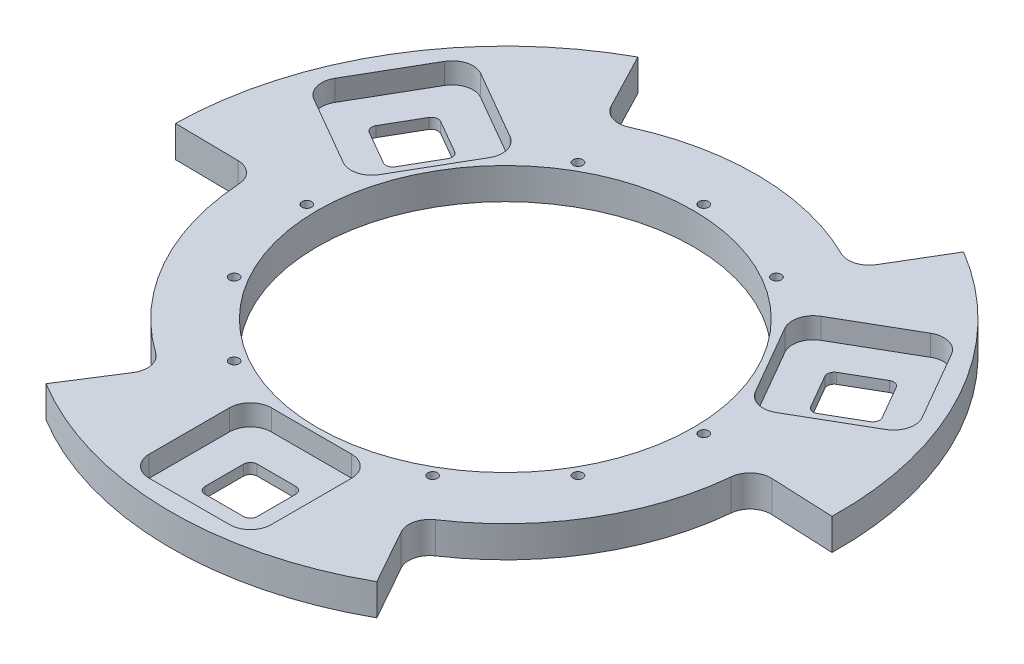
ISO-10303-21;
HEADER;
FILE_DESCRIPTION(('STEP AP214'),'2;1');
FILE_NAME('part.step','',(''),(''),'','','');
FILE_SCHEMA(('AUTOMOTIVE_DESIGN { 1 0 10303 214 1 1 1 1 }'));
ENDSEC;
DATA;
#1=APPLICATION_CONTEXT('core data for automotive mechanical design processes');
#2=APPLICATION_PROTOCOL_DEFINITION('international standard','automotive_design',2000,#1);
#3=PRODUCT_CONTEXT('',#1,'mechanical');
#4=PRODUCT('Part','Part','',(#3));
#5=PRODUCT_RELATED_PRODUCT_CATEGORY('part','',(#4));
#6=PRODUCT_DEFINITION_FORMATION('','',#4);
#7=PRODUCT_DEFINITION_CONTEXT('part definition',#1,'design');
#8=PRODUCT_DEFINITION('design','',#6,#7);
#9=PRODUCT_DEFINITION_SHAPE('','',#8);
#10=(LENGTH_UNIT() NAMED_UNIT(*) SI_UNIT(.MILLI.,.METRE.));
#11=(NAMED_UNIT(*) PLANE_ANGLE_UNIT() SI_UNIT($,.RADIAN.));
#12=(NAMED_UNIT(*) SI_UNIT($,.STERADIAN.) SOLID_ANGLE_UNIT());
#13=UNCERTAINTY_MEASURE_WITH_UNIT(LENGTH_MEASURE(1.E-05),#10,'distance_accuracy_value','');
#14=(GEOMETRIC_REPRESENTATION_CONTEXT(3) GLOBAL_UNCERTAINTY_ASSIGNED_CONTEXT((#13)) GLOBAL_UNIT_ASSIGNED_CONTEXT((#10,
#11,#12)) REPRESENTATION_CONTEXT('',''));
#15=CARTESIAN_POINT('',(0.,0.,0.));
#16=DIRECTION('',(0.,0.,1.));
#17=DIRECTION('',(1.,0.,0.));
#18=AXIS2_PLACEMENT_3D('',#15,#16,#17);
#19=CARTESIAN_POINT('',(30.1625000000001,0.,-52.2429824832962));
#20=DIRECTION('',(0.,1.,0.));
#21=DIRECTION('',(0.,0.,1.));
#22=AXIS2_PLACEMENT_3D('',#19,#20,#21);
#23=CYLINDRICAL_SURFACE('',#22,1.4732);
#24=CARTESIAN_POINT('',(30.1625000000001,9.525,-52.2429824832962));
#25=DIRECTION('',(0.,1.,0.));
#26=DIRECTION('',(0.,0.,1.));
#27=AXIS2_PLACEMENT_3D('',#24,#25,#26);
#28=CIRCLE('',#27,1.4732);
#29=CARTESIAN_POINT('',(30.1625000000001,9.525,-50.7697824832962));
#30=VERTEX_POINT('',#29);
#31=EDGE_CURVE('E1024',#30,#30,#28,.T.);
#32=CARTESIAN_POINT('',(30.1625000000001,3.3528,-52.2429824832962));
#33=DIRECTION('',(0.,-1.,0.));
#34=DIRECTION('',(0.,0.,-1.));
#35=AXIS2_PLACEMENT_3D('',#32,#33,#34);
#36=CIRCLE('',#35,1.4732);
#37=CARTESIAN_POINT('',(30.1625000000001,3.3528,-50.7697824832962));
#38=VERTEX_POINT('',#37);
#39=EDGE_CURVE('E38',#38,#38,#36,.F.);
#40=CARTESIAN_POINT('',(30.1625000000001,9.525,-50.7697824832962));
#41=CARTESIAN_POINT('',(30.1625000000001,9.46070625,-50.7697824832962));
#42=CARTESIAN_POINT('',(30.1625000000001,9.3964125,-50.7697824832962));
#43=CARTESIAN_POINT('',(30.1625000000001,9.267825,-50.7697824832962));
#44=CARTESIAN_POINT('',(30.1625000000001,9.20353125,-50.7697824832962));
#45=CARTESIAN_POINT('',(30.1625000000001,9.07494375,-50.7697824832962));
#46=CARTESIAN_POINT('',(30.1625000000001,9.01065,-50.7697824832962));
#47=CARTESIAN_POINT('',(30.1625000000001,8.8820625,-50.7697824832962));
#48=CARTESIAN_POINT('',(30.1625000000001,8.81776875,-50.7697824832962));
#49=CARTESIAN_POINT('',(30.1625000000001,8.68918125,-50.7697824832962));
#50=CARTESIAN_POINT('',(30.1625000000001,8.6248875,-50.7697824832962));
#51=CARTESIAN_POINT('',(30.1625000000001,8.4963,-50.7697824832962));
#52=CARTESIAN_POINT('',(30.1625000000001,8.43200625,-50.7697824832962));
#53=CARTESIAN_POINT('',(30.1625000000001,8.30341875,-50.7697824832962));
#54=CARTESIAN_POINT('',(30.1625000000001,8.239125,-50.7697824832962));
#55=CARTESIAN_POINT('',(30.1625000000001,8.1105375,-50.7697824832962));
#56=CARTESIAN_POINT('',(30.1625000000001,8.04624375,-50.7697824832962));
#57=CARTESIAN_POINT('',(30.1625000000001,7.91765625,-50.7697824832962));
#58=CARTESIAN_POINT('',(30.1625000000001,7.8533625,-50.7697824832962));
#59=CARTESIAN_POINT('',(30.1625000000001,7.724775,-50.7697824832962));
#60=CARTESIAN_POINT('',(30.1625000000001,7.66048125,-50.7697824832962));
#61=CARTESIAN_POINT('',(30.1625000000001,7.53189375,-50.7697824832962));
#62=CARTESIAN_POINT('',(30.1625000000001,7.4676,-50.7697824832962));
#63=CARTESIAN_POINT('',(30.1625000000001,7.3390125,-50.7697824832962));
#64=CARTESIAN_POINT('',(30.1625000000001,7.27471875,-50.7697824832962));
#65=CARTESIAN_POINT('',(30.1625000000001,7.14613125,-50.7697824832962));
#66=CARTESIAN_POINT('',(30.1625000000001,7.0818375,-50.7697824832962));
#67=CARTESIAN_POINT('',(30.1625000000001,6.95325,-50.7697824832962));
#68=CARTESIAN_POINT('',(30.1625000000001,6.88895625,-50.7697824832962));
#69=CARTESIAN_POINT('',(30.1625000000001,6.76036875,-50.7697824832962));
#70=CARTESIAN_POINT('',(30.1625000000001,6.696075,-50.7697824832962));
#71=CARTESIAN_POINT('',(30.1625000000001,6.5674875,-50.7697824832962));
#72=CARTESIAN_POINT('',(30.1625000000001,6.50319375,-50.7697824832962));
#73=CARTESIAN_POINT('',(30.1625000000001,6.37460625,-50.7697824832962));
#74=CARTESIAN_POINT('',(30.1625000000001,6.3103125,-50.7697824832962));
#75=CARTESIAN_POINT('',(30.1625000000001,6.181725,-50.7697824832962));
#76=CARTESIAN_POINT('',(30.1625000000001,6.11743125,-50.7697824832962));
#77=CARTESIAN_POINT('',(30.1625000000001,5.98884375,-50.7697824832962));
#78=CARTESIAN_POINT('',(30.1625000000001,5.92455,-50.7697824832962));
#79=CARTESIAN_POINT('',(30.1625000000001,5.7959625,-50.7697824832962));
#80=CARTESIAN_POINT('',(30.1625000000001,5.73166875,-50.7697824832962));
#81=CARTESIAN_POINT('',(30.1625000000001,5.60308125,-50.7697824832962));
#82=CARTESIAN_POINT('',(30.1625000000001,5.5387875,-50.7697824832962));
#83=CARTESIAN_POINT('',(30.1625000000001,5.4102,-50.7697824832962));
#84=CARTESIAN_POINT('',(30.1625000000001,5.34590625,-50.7697824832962));
#85=CARTESIAN_POINT('',(30.1625000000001,5.21731875,-50.7697824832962));
#86=CARTESIAN_POINT('',(30.1625000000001,5.153025,-50.7697824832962));
#87=CARTESIAN_POINT('',(30.1625000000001,5.0244375,-50.7697824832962));
#88=CARTESIAN_POINT('',(30.1625000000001,4.96014375,-50.7697824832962));
#89=CARTESIAN_POINT('',(30.1625000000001,4.83155625,-50.7697824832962));
#90=CARTESIAN_POINT('',(30.1625000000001,4.7672625,-50.7697824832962));
#91=CARTESIAN_POINT('',(30.1625000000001,4.638675,-50.7697824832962));
#92=CARTESIAN_POINT('',(30.1625000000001,4.57438125,-50.7697824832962));
#93=CARTESIAN_POINT('',(30.1625000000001,4.44579375,-50.7697824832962));
#94=CARTESIAN_POINT('',(30.1625000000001,4.3815,-50.7697824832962));
#95=CARTESIAN_POINT('',(30.1625000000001,4.2529125,-50.7697824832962));
#96=CARTESIAN_POINT('',(30.1625000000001,4.18861875,-50.7697824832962));
#97=CARTESIAN_POINT('',(30.1625000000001,4.06003125,-50.7697824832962));
#98=CARTESIAN_POINT('',(30.1625000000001,3.9957375,-50.7697824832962));
#99=CARTESIAN_POINT('',(30.1625000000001,3.86715,-50.7697824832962));
#100=CARTESIAN_POINT('',(30.1625000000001,3.80285625,-50.7697824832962));
#101=CARTESIAN_POINT('',(30.1625000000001,3.67426875,-50.7697824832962));
#102=CARTESIAN_POINT('',(30.1625000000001,3.609975,-50.7697824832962));
#103=CARTESIAN_POINT('',(30.1625000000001,3.4813875,-50.7697824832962));
#104=CARTESIAN_POINT('',(30.1625000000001,3.41709375,-50.7697824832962));
#105=CARTESIAN_POINT('',(30.1625000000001,3.3528,-50.7697824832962));
#106=B_SPLINE_CURVE_WITH_KNOTS('',3,(#40,#41,#42,#43,#44,#45,#46,#47,#48,#49,#50,#51,#52,#53,
#54,#55,#56,#57,#58,#59,#60,#61,#62,#63,#64,#65,#66,#67,#68,#69,#70,#71,#72,#73,#74,#75,#76,#77,
#78,#79,#80,#81,#82,#83,#84,#85,#86,#87,#88,#89,#90,#91,#92,#93,#94,#95,#96,#97,#98,#99,#100,
#101,#102,#103,#104,#105),.UNSPECIFIED.,.F.,.F.,(4,2,2,2,2,2,2,2,2,2,2,2,2,2,2,2,2,2,2,2,2,2,2,
2,2,2,2,2,2,2,2,2,4),(0.,0.192881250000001,0.385762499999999,0.57864375,0.771525,
0.964406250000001,1.1572875,1.35016875,1.54305,1.73593125,1.9288125,2.12169375,2.314575,
2.50745625,2.7003375,2.89321875,3.0861,3.27898125,3.4718625,3.66474375,3.857625,4.05050625,
4.2433875,4.43626875,4.62915,4.82203125,5.0149125,5.20779375,5.400675,5.59355625,5.7864375,
5.97931875,6.1722),.UNSPECIFIED.);
#107=EDGE_CURVE('BSEAM34',#30,#38,#106,.T.);
#108=ORIENTED_EDGE('',*,*,#31,.T.);
#109=ORIENTED_EDGE('',*,*,#39,.F.);
#110=ORIENTED_EDGE('',*,*,#107,.T.);
#111=ORIENTED_EDGE('',*,*,#107,.F.);
#112=EDGE_LOOP('',(#108,#110,#109,#111));
#113=FACE_BOUND('',#112,.T.);
#114=ADVANCED_FACE('F34',(#113),#23,.F.);
#115=CARTESIAN_POINT('',(-30.1625000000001,0.,-52.2429824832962));
#116=DIRECTION('',(0.,1.,0.));
#117=DIRECTION('',(0.,0.,1.));
#118=AXIS2_PLACEMENT_3D('',#115,#116,#117);
#119=CYLINDRICAL_SURFACE('',#118,1.4732);
#120=CARTESIAN_POINT('',(-30.1625000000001,9.525,-52.2429824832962));
#121=DIRECTION('',(0.,1.,0.));
#122=DIRECTION('',(0.,0.,1.));
#123=AXIS2_PLACEMENT_3D('',#120,#121,#122);
#124=CIRCLE('',#123,1.4732);
#125=CARTESIAN_POINT('',(-30.1625000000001,9.525,-50.7697824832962));
#126=VERTEX_POINT('',#125);
#127=EDGE_CURVE('E1027',#126,#126,#124,.T.);
#128=CARTESIAN_POINT('',(-30.1625000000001,3.3528,-52.2429824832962));
#129=DIRECTION('',(0.,-1.,0.));
#130=DIRECTION('',(0.,0.,-1.));
#131=AXIS2_PLACEMENT_3D('',#128,#129,#130);
#132=CIRCLE('',#131,1.4732);
#133=CARTESIAN_POINT('',(-30.1625000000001,3.3528,-50.7697824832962));
#134=VERTEX_POINT('',#133);
#135=EDGE_CURVE('E1001',#134,#134,#132,.F.);
#136=CARTESIAN_POINT('',(-30.1625000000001,9.525,-50.7697824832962));
#137=CARTESIAN_POINT('',(-30.1625000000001,9.46070625,-50.7697824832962));
#138=CARTESIAN_POINT('',(-30.1625000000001,9.3964125,-50.7697824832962));
#139=CARTESIAN_POINT('',(-30.1625000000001,9.267825,-50.7697824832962));
#140=CARTESIAN_POINT('',(-30.1625000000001,9.20353125,-50.7697824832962));
#141=CARTESIAN_POINT('',(-30.1625000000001,9.07494375,-50.7697824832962));
#142=CARTESIAN_POINT('',(-30.1625000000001,9.01065,-50.7697824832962));
#143=CARTESIAN_POINT('',(-30.1625000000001,8.8820625,-50.7697824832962));
#144=CARTESIAN_POINT('',(-30.1625000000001,8.81776875,-50.7697824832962));
#145=CARTESIAN_POINT('',(-30.1625000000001,8.68918125,-50.7697824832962));
#146=CARTESIAN_POINT('',(-30.1625000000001,8.6248875,-50.7697824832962));
#147=CARTESIAN_POINT('',(-30.1625000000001,8.4963,-50.7697824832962));
#148=CARTESIAN_POINT('',(-30.1625000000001,8.43200625,-50.7697824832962));
#149=CARTESIAN_POINT('',(-30.1625000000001,8.30341875,-50.7697824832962));
#150=CARTESIAN_POINT('',(-30.1625000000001,8.239125,-50.7697824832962));
#151=CARTESIAN_POINT('',(-30.1625000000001,8.1105375,-50.7697824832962));
#152=CARTESIAN_POINT('',(-30.1625000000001,8.04624375,-50.7697824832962));
#153=CARTESIAN_POINT('',(-30.1625000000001,7.91765625,-50.7697824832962));
#154=CARTESIAN_POINT('',(-30.1625000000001,7.8533625,-50.7697824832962));
#155=CARTESIAN_POINT('',(-30.1625000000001,7.724775,-50.7697824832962));
#156=CARTESIAN_POINT('',(-30.1625000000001,7.66048125,-50.7697824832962));
#157=CARTESIAN_POINT('',(-30.1625000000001,7.53189375,-50.7697824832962));
#158=CARTESIAN_POINT('',(-30.1625000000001,7.4676,-50.7697824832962));
#159=CARTESIAN_POINT('',(-30.1625000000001,7.3390125,-50.7697824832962));
#160=CARTESIAN_POINT('',(-30.1625000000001,7.27471875,-50.7697824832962));
#161=CARTESIAN_POINT('',(-30.1625000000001,7.14613125,-50.7697824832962));
#162=CARTESIAN_POINT('',(-30.1625000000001,7.0818375,-50.7697824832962));
#163=CARTESIAN_POINT('',(-30.1625000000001,6.95325,-50.7697824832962));
#164=CARTESIAN_POINT('',(-30.1625000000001,6.88895625,-50.7697824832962));
#165=CARTESIAN_POINT('',(-30.1625000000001,6.76036875,-50.7697824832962));
#166=CARTESIAN_POINT('',(-30.1625000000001,6.696075,-50.7697824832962));
#167=CARTESIAN_POINT('',(-30.1625000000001,6.5674875,-50.7697824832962));
#168=CARTESIAN_POINT('',(-30.1625000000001,6.50319375,-50.7697824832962));
#169=CARTESIAN_POINT('',(-30.1625000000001,6.37460625,-50.7697824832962));
#170=CARTESIAN_POINT('',(-30.1625000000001,6.3103125,-50.7697824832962));
#171=CARTESIAN_POINT('',(-30.1625000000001,6.181725,-50.7697824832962));
#172=CARTESIAN_POINT('',(-30.1625000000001,6.11743125,-50.7697824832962));
#173=CARTESIAN_POINT('',(-30.1625000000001,5.98884375,-50.7697824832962));
#174=CARTESIAN_POINT('',(-30.1625000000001,5.92455,-50.7697824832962));
#175=CARTESIAN_POINT('',(-30.1625000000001,5.7959625,-50.7697824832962));
#176=CARTESIAN_POINT('',(-30.1625000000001,5.73166875,-50.7697824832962));
#177=CARTESIAN_POINT('',(-30.1625000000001,5.60308125,-50.7697824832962));
#178=CARTESIAN_POINT('',(-30.1625000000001,5.5387875,-50.7697824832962));
#179=CARTESIAN_POINT('',(-30.1625000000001,5.4102,-50.7697824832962));
#180=CARTESIAN_POINT('',(-30.1625000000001,5.34590625,-50.7697824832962));
#181=CARTESIAN_POINT('',(-30.1625000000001,5.21731875,-50.7697824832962));
#182=CARTESIAN_POINT('',(-30.1625000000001,5.153025,-50.7697824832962));
#183=CARTESIAN_POINT('',(-30.1625000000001,5.0244375,-50.7697824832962));
#184=CARTESIAN_POINT('',(-30.1625000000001,4.96014375,-50.7697824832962));
#185=CARTESIAN_POINT('',(-30.1625000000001,4.83155625,-50.7697824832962));
#186=CARTESIAN_POINT('',(-30.1625000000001,4.7672625,-50.7697824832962));
#187=CARTESIAN_POINT('',(-30.1625000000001,4.638675,-50.7697824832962));
#188=CARTESIAN_POINT('',(-30.1625000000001,4.57438125,-50.7697824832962));
#189=CARTESIAN_POINT('',(-30.1625000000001,4.44579375,-50.7697824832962));
#190=CARTESIAN_POINT('',(-30.1625000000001,4.3815,-50.7697824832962));
#191=CARTESIAN_POINT('',(-30.1625000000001,4.2529125,-50.7697824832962));
#192=CARTESIAN_POINT('',(-30.1625000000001,4.18861875,-50.7697824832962));
#193=CARTESIAN_POINT('',(-30.1625000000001,4.06003125,-50.7697824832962));
#194=CARTESIAN_POINT('',(-30.1625000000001,3.9957375,-50.7697824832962));
#195=CARTESIAN_POINT('',(-30.1625000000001,3.86715,-50.7697824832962));
#196=CARTESIAN_POINT('',(-30.1625000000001,3.80285625,-50.7697824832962));
#197=CARTESIAN_POINT('',(-30.1625000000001,3.67426875,-50.7697824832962));
#198=CARTESIAN_POINT('',(-30.1625000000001,3.609975,-50.7697824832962));
#199=CARTESIAN_POINT('',(-30.1625000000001,3.4813875,-50.7697824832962));
#200=CARTESIAN_POINT('',(-30.1625000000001,3.41709375,-50.7697824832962));
#201=CARTESIAN_POINT('',(-30.1625000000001,3.3528,-50.7697824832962));
#202=B_SPLINE_CURVE_WITH_KNOTS('',3,(#136,#137,#138,#139,#140,#141,#142,#143,#144,#145,#146,
#147,#148,#149,#150,#151,#152,#153,#154,#155,#156,#157,#158,#159,#160,#161,#162,#163,#164,#165,
#166,#167,#168,#169,#170,#171,#172,#173,#174,#175,#176,#177,#178,#179,#180,#181,#182,#183,#184,
#185,#186,#187,#188,#189,#190,#191,#192,#193,#194,#195,#196,#197,#198,#199,#200,#201),
.UNSPECIFIED.,.F.,.F.,(4,2,2,2,2,2,2,2,2,2,2,2,2,2,2,2,2,2,2,2,2,2,2,2,2,2,2,2,2,2,2,2,4),(0.,
0.192881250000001,0.385762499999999,0.57864375,0.771525,0.964406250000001,1.1572875,1.35016875,
1.54305,1.73593125,1.9288125,2.12169375,2.314575,2.50745625,2.7003375,2.89321875,3.0861,
3.27898125,3.4718625,3.66474375,3.857625,4.05050625,4.2433875,4.43626875,4.62915,4.82203125,
5.0149125,5.20779375,5.400675,5.59355625,5.7864375,5.97931875,6.1722),.UNSPECIFIED.);
#203=EDGE_CURVE('BSEAM1084',#126,#134,#202,.T.);
#204=ORIENTED_EDGE('',*,*,#127,.T.);
#205=ORIENTED_EDGE('',*,*,#135,.F.);
#206=ORIENTED_EDGE('',*,*,#203,.T.);
#207=ORIENTED_EDGE('',*,*,#203,.F.);
#208=EDGE_LOOP('',(#204,#206,#205,#207));
#209=FACE_BOUND('',#208,.T.);
#210=ADVANCED_FACE('F1084',(#209),#119,.F.);
#211=CARTESIAN_POINT('',(52.2429824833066,0.,30.1625));
#212=DIRECTION('',(0.,1.,0.));
#213=DIRECTION('',(0.,0.,1.));
#214=AXIS2_PLACEMENT_3D('',#211,#212,#213);
#215=CYLINDRICAL_SURFACE('',#214,1.47320000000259);
#216=CARTESIAN_POINT('',(52.2429824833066,9.525,30.1625));
#217=DIRECTION('',(0.,1.,0.));
#218=DIRECTION('',(0.,0.,1.));
#219=AXIS2_PLACEMENT_3D('',#216,#217,#218);
#220=CIRCLE('',#219,1.47320000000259);
#221=CARTESIAN_POINT('',(52.2429824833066,9.525,31.6357000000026));
#222=VERTEX_POINT('',#221);
#223=EDGE_CURVE('E1029',#222,#222,#220,.T.);
#224=CARTESIAN_POINT('',(52.2429824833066,3.3528,30.1625));
#225=DIRECTION('',(0.,-1.,0.));
#226=DIRECTION('',(0.,0.,-1.));
#227=AXIS2_PLACEMENT_3D('',#224,#225,#226);
#228=CIRCLE('',#227,1.47320000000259);
#229=CARTESIAN_POINT('',(52.2429824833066,3.3528,31.6357000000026));
#230=VERTEX_POINT('',#229);
#231=EDGE_CURVE('E999',#230,#230,#228,.F.);
#232=CARTESIAN_POINT('',(52.2429824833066,9.525,31.6357000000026));
#233=CARTESIAN_POINT('',(52.2429824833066,9.46070625,31.6357000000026));
#234=CARTESIAN_POINT('',(52.2429824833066,9.3964125,31.6357000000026));
#235=CARTESIAN_POINT('',(52.2429824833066,9.267825,31.6357000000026));
#236=CARTESIAN_POINT('',(52.2429824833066,9.20353125,31.6357000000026));
#237=CARTESIAN_POINT('',(52.2429824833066,9.07494375,31.6357000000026));
#238=CARTESIAN_POINT('',(52.2429824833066,9.01065,31.6357000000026));
#239=CARTESIAN_POINT('',(52.2429824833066,8.8820625,31.6357000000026));
#240=CARTESIAN_POINT('',(52.2429824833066,8.81776875,31.6357000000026));
#241=CARTESIAN_POINT('',(52.2429824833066,8.68918125,31.6357000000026));
#242=CARTESIAN_POINT('',(52.2429824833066,8.6248875,31.6357000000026));
#243=CARTESIAN_POINT('',(52.2429824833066,8.4963,31.6357000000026));
#244=CARTESIAN_POINT('',(52.2429824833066,8.43200625,31.6357000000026));
#245=CARTESIAN_POINT('',(52.2429824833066,8.30341875,31.6357000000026));
#246=CARTESIAN_POINT('',(52.2429824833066,8.239125,31.6357000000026));
#247=CARTESIAN_POINT('',(52.2429824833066,8.1105375,31.6357000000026));
#248=CARTESIAN_POINT('',(52.2429824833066,8.04624375,31.6357000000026));
#249=CARTESIAN_POINT('',(52.2429824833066,7.91765625,31.6357000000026));
#250=CARTESIAN_POINT('',(52.2429824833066,7.8533625,31.6357000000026));
#251=CARTESIAN_POINT('',(52.2429824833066,7.724775,31.6357000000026));
#252=CARTESIAN_POINT('',(52.2429824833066,7.66048125,31.6357000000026));
#253=CARTESIAN_POINT('',(52.2429824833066,7.53189375,31.6357000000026));
#254=CARTESIAN_POINT('',(52.2429824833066,7.4676,31.6357000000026));
#255=CARTESIAN_POINT('',(52.2429824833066,7.3390125,31.6357000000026));
#256=CARTESIAN_POINT('',(52.2429824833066,7.27471875,31.6357000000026));
#257=CARTESIAN_POINT('',(52.2429824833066,7.14613125,31.6357000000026));
#258=CARTESIAN_POINT('',(52.2429824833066,7.0818375,31.6357000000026));
#259=CARTESIAN_POINT('',(52.2429824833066,6.95325,31.6357000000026));
#260=CARTESIAN_POINT('',(52.2429824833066,6.88895625,31.6357000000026));
#261=CARTESIAN_POINT('',(52.2429824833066,6.76036875,31.6357000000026));
#262=CARTESIAN_POINT('',(52.2429824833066,6.696075,31.6357000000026));
#263=CARTESIAN_POINT('',(52.2429824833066,6.5674875,31.6357000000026));
#264=CARTESIAN_POINT('',(52.2429824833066,6.50319375,31.6357000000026));
#265=CARTESIAN_POINT('',(52.2429824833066,6.37460625,31.6357000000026));
#266=CARTESIAN_POINT('',(52.2429824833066,6.3103125,31.6357000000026));
#267=CARTESIAN_POINT('',(52.2429824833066,6.181725,31.6357000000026));
#268=CARTESIAN_POINT('',(52.2429824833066,6.11743125,31.6357000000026));
#269=CARTESIAN_POINT('',(52.2429824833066,5.98884375,31.6357000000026));
#270=CARTESIAN_POINT('',(52.2429824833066,5.92455,31.6357000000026));
#271=CARTESIAN_POINT('',(52.2429824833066,5.7959625,31.6357000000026));
#272=CARTESIAN_POINT('',(52.2429824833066,5.73166875,31.6357000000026));
#273=CARTESIAN_POINT('',(52.2429824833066,5.60308125,31.6357000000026));
#274=CARTESIAN_POINT('',(52.2429824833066,5.5387875,31.6357000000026));
#275=CARTESIAN_POINT('',(52.2429824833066,5.4102,31.6357000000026));
#276=CARTESIAN_POINT('',(52.2429824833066,5.34590625,31.6357000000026));
#277=CARTESIAN_POINT('',(52.2429824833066,5.21731875,31.6357000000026));
#278=CARTESIAN_POINT('',(52.2429824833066,5.153025,31.6357000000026));
#279=CARTESIAN_POINT('',(52.2429824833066,5.0244375,31.6357000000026));
#280=CARTESIAN_POINT('',(52.2429824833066,4.96014375,31.6357000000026));
#281=CARTESIAN_POINT('',(52.2429824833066,4.83155625,31.6357000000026));
#282=CARTESIAN_POINT('',(52.2429824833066,4.7672625,31.6357000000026));
#283=CARTESIAN_POINT('',(52.2429824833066,4.638675,31.6357000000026));
#284=CARTESIAN_POINT('',(52.2429824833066,4.57438125,31.6357000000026));
#285=CARTESIAN_POINT('',(52.2429824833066,4.44579375,31.6357000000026));
#286=CARTESIAN_POINT('',(52.2429824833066,4.3815,31.6357000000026));
#287=CARTESIAN_POINT('',(52.2429824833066,4.2529125,31.6357000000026));
#288=CARTESIAN_POINT('',(52.2429824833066,4.18861875,31.6357000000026));
#289=CARTESIAN_POINT('',(52.2429824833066,4.06003125,31.6357000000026));
#290=CARTESIAN_POINT('',(52.2429824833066,3.9957375,31.6357000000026));
#291=CARTESIAN_POINT('',(52.2429824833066,3.86715,31.6357000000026));
#292=CARTESIAN_POINT('',(52.2429824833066,3.80285625,31.6357000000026));
#293=CARTESIAN_POINT('',(52.2429824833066,3.67426875,31.6357000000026));
#294=CARTESIAN_POINT('',(52.2429824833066,3.609975,31.6357000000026));
#295=CARTESIAN_POINT('',(52.2429824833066,3.4813875,31.6357000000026));
#296=CARTESIAN_POINT('',(52.2429824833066,3.41709375,31.6357000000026));
#297=CARTESIAN_POINT('',(52.2429824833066,3.3528,31.6357000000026));
#298=B_SPLINE_CURVE_WITH_KNOTS('',3,(#232,#233,#234,#235,#236,#237,#238,#239,#240,#241,#242,
#243,#244,#245,#246,#247,#248,#249,#250,#251,#252,#253,#254,#255,#256,#257,#258,#259,#260,#261,
#262,#263,#264,#265,#266,#267,#268,#269,#270,#271,#272,#273,#274,#275,#276,#277,#278,#279,#280,
#281,#282,#283,#284,#285,#286,#287,#288,#289,#290,#291,#292,#293,#294,#295,#296,#297),
.UNSPECIFIED.,.F.,.F.,(4,2,2,2,2,2,2,2,2,2,2,2,2,2,2,2,2,2,2,2,2,2,2,2,2,2,2,2,2,2,2,2,4),(0.,
0.192881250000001,0.385762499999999,0.57864375,0.771525,0.964406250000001,1.1572875,1.35016875,
1.54305,1.73593125,1.9288125,2.12169375,2.314575,2.50745625,2.7003375,2.89321875,3.0861,
3.27898125,3.4718625,3.66474375,3.857625,4.05050625,4.2433875,4.43626875,4.62915,4.82203125,
5.0149125,5.20779375,5.400675,5.59355625,5.7864375,5.97931875,6.1722),.UNSPECIFIED.);
#299=EDGE_CURVE('BSEAM1090',#222,#230,#298,.T.);
#300=ORIENTED_EDGE('',*,*,#223,.T.);
#301=ORIENTED_EDGE('',*,*,#231,.F.);
#302=ORIENTED_EDGE('',*,*,#299,.T.);
#303=ORIENTED_EDGE('',*,*,#299,.F.);
#304=EDGE_LOOP('',(#300,#302,#301,#303));
#305=FACE_BOUND('',#304,.T.);
#306=ADVANCED_FACE('F1090',(#305),#215,.F.);
#307=CARTESIAN_POINT('',(30.1625000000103,0.,52.2429824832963));
#308=DIRECTION('',(0.,1.,0.));
#309=DIRECTION('',(0.,0.,1.));
#310=AXIS2_PLACEMENT_3D('',#307,#308,#309);
#311=CYLINDRICAL_SURFACE('',#310,1.4732000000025);
#312=CARTESIAN_POINT('',(30.1625000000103,9.525,52.2429824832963));
#313=DIRECTION('',(0.,1.,0.));
#314=DIRECTION('',(0.,0.,1.));
#315=AXIS2_PLACEMENT_3D('',#312,#313,#314);
#316=CIRCLE('',#315,1.4732000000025);
#317=CARTESIAN_POINT('',(30.1625000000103,9.525,53.7161824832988));
#318=VERTEX_POINT('',#317);
#319=EDGE_CURVE('E478',#318,#318,#316,.T.);
#320=CARTESIAN_POINT('',(30.1625000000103,3.3528,52.2429824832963));
#321=DIRECTION('',(0.,-1.,0.));
#322=DIRECTION('',(0.,0.,-1.));
#323=AXIS2_PLACEMENT_3D('',#320,#321,#322);
#324=CIRCLE('',#323,1.4732000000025);
#325=CARTESIAN_POINT('',(30.1625000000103,3.3528,53.7161824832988));
#326=VERTEX_POINT('',#325);
#327=EDGE_CURVE('E996',#326,#326,#324,.F.);
#328=CARTESIAN_POINT('',(30.1625000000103,9.525,53.7161824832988));
#329=CARTESIAN_POINT('',(30.1625000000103,9.46070625,53.7161824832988));
#330=CARTESIAN_POINT('',(30.1625000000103,9.3964125,53.7161824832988));
#331=CARTESIAN_POINT('',(30.1625000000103,9.267825,53.7161824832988));
#332=CARTESIAN_POINT('',(30.1625000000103,9.20353125,53.7161824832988));
#333=CARTESIAN_POINT('',(30.1625000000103,9.07494375,53.7161824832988));
#334=CARTESIAN_POINT('',(30.1625000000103,9.01065,53.7161824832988));
#335=CARTESIAN_POINT('',(30.1625000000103,8.8820625,53.7161824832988));
#336=CARTESIAN_POINT('',(30.1625000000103,8.81776875,53.7161824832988));
#337=CARTESIAN_POINT('',(30.1625000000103,8.68918125,53.7161824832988));
#338=CARTESIAN_POINT('',(30.1625000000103,8.6248875,53.7161824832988));
#339=CARTESIAN_POINT('',(30.1625000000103,8.4963,53.7161824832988));
#340=CARTESIAN_POINT('',(30.1625000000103,8.43200625,53.7161824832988));
#341=CARTESIAN_POINT('',(30.1625000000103,8.30341875,53.7161824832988));
#342=CARTESIAN_POINT('',(30.1625000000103,8.239125,53.7161824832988));
#343=CARTESIAN_POINT('',(30.1625000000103,8.1105375,53.7161824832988));
#344=CARTESIAN_POINT('',(30.1625000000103,8.04624375,53.7161824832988));
#345=CARTESIAN_POINT('',(30.1625000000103,7.91765625,53.7161824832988));
#346=CARTESIAN_POINT('',(30.1625000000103,7.8533625,53.7161824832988));
#347=CARTESIAN_POINT('',(30.1625000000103,7.724775,53.7161824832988));
#348=CARTESIAN_POINT('',(30.1625000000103,7.66048125,53.7161824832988));
#349=CARTESIAN_POINT('',(30.1625000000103,7.53189375,53.7161824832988));
#350=CARTESIAN_POINT('',(30.1625000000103,7.4676,53.7161824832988));
#351=CARTESIAN_POINT('',(30.1625000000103,7.3390125,53.7161824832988));
#352=CARTESIAN_POINT('',(30.1625000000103,7.27471875,53.7161824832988));
#353=CARTESIAN_POINT('',(30.1625000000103,7.14613125,53.7161824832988));
#354=CARTESIAN_POINT('',(30.1625000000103,7.0818375,53.7161824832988));
#355=CARTESIAN_POINT('',(30.1625000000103,6.95325,53.7161824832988));
#356=CARTESIAN_POINT('',(30.1625000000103,6.88895625,53.7161824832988));
#357=CARTESIAN_POINT('',(30.1625000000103,6.76036875,53.7161824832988));
#358=CARTESIAN_POINT('',(30.1625000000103,6.696075,53.7161824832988));
#359=CARTESIAN_POINT('',(30.1625000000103,6.5674875,53.7161824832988));
#360=CARTESIAN_POINT('',(30.1625000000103,6.50319375,53.7161824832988));
#361=CARTESIAN_POINT('',(30.1625000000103,6.37460625,53.7161824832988));
#362=CARTESIAN_POINT('',(30.1625000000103,6.3103125,53.7161824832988));
#363=CARTESIAN_POINT('',(30.1625000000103,6.181725,53.7161824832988));
#364=CARTESIAN_POINT('',(30.1625000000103,6.11743125,53.7161824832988));
#365=CARTESIAN_POINT('',(30.1625000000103,5.98884375,53.7161824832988));
#366=CARTESIAN_POINT('',(30.1625000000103,5.92455,53.7161824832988));
#367=CARTESIAN_POINT('',(30.1625000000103,5.7959625,53.7161824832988));
#368=CARTESIAN_POINT('',(30.1625000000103,5.73166875,53.7161824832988));
#369=CARTESIAN_POINT('',(30.1625000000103,5.60308125,53.7161824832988));
#370=CARTESIAN_POINT('',(30.1625000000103,5.5387875,53.7161824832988));
#371=CARTESIAN_POINT('',(30.1625000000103,5.4102,53.7161824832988));
#372=CARTESIAN_POINT('',(30.1625000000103,5.34590625,53.7161824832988));
#373=CARTESIAN_POINT('',(30.1625000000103,5.21731875,53.7161824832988));
#374=CARTESIAN_POINT('',(30.1625000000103,5.153025,53.7161824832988));
#375=CARTESIAN_POINT('',(30.1625000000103,5.0244375,53.7161824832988));
#376=CARTESIAN_POINT('',(30.1625000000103,4.96014375,53.7161824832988));
#377=CARTESIAN_POINT('',(30.1625000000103,4.83155625,53.7161824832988));
#378=CARTESIAN_POINT('',(30.1625000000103,4.7672625,53.7161824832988));
#379=CARTESIAN_POINT('',(30.1625000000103,4.638675,53.7161824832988));
#380=CARTESIAN_POINT('',(30.1625000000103,4.57438125,53.7161824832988));
#381=CARTESIAN_POINT('',(30.1625000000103,4.44579375,53.7161824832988));
#382=CARTESIAN_POINT('',(30.1625000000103,4.3815,53.7161824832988));
#383=CARTESIAN_POINT('',(30.1625000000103,4.2529125,53.7161824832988));
#384=CARTESIAN_POINT('',(30.1625000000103,4.18861875,53.7161824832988));
#385=CARTESIAN_POINT('',(30.1625000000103,4.06003125,53.7161824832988));
#386=CARTESIAN_POINT('',(30.1625000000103,3.9957375,53.7161824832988));
#387=CARTESIAN_POINT('',(30.1625000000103,3.86715,53.7161824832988));
#388=CARTESIAN_POINT('',(30.1625000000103,3.80285625,53.7161824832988));
#389=CARTESIAN_POINT('',(30.1625000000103,3.67426875,53.7161824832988));
#390=CARTESIAN_POINT('',(30.1625000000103,3.609975,53.7161824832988));
#391=CARTESIAN_POINT('',(30.1625000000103,3.4813875,53.7161824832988));
#392=CARTESIAN_POINT('',(30.1625000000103,3.41709375,53.7161824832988));
#393=CARTESIAN_POINT('',(30.1625000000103,3.3528,53.7161824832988));
#394=B_SPLINE_CURVE_WITH_KNOTS('',3,(#328,#329,#330,#331,#332,#333,#334,#335,#336,#337,#338,
#339,#340,#341,#342,#343,#344,#345,#346,#347,#348,#349,#350,#351,#352,#353,#354,#355,#356,#357,
#358,#359,#360,#361,#362,#363,#364,#365,#366,#367,#368,#369,#370,#371,#372,#373,#374,#375,#376,
#377,#378,#379,#380,#381,#382,#383,#384,#385,#386,#387,#388,#389,#390,#391,#392,#393),
.UNSPECIFIED.,.F.,.F.,(4,2,2,2,2,2,2,2,2,2,2,2,2,2,2,2,2,2,2,2,2,2,2,2,2,2,2,2,2,2,2,2,4),(0.,
0.192881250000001,0.385762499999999,0.57864375,0.771525,0.964406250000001,1.1572875,1.35016875,
1.54305,1.73593125,1.9288125,2.12169375,2.314575,2.50745625,2.7003375,2.89321875,3.0861,
3.27898125,3.4718625,3.66474375,3.857625,4.05050625,4.2433875,4.43626875,4.62915,4.82203125,
5.0149125,5.20779375,5.400675,5.59355625,5.7864375,5.97931875,6.1722),.UNSPECIFIED.);
#395=EDGE_CURVE('BSEAM1036',#318,#326,#394,.T.);
#396=ORIENTED_EDGE('',*,*,#319,.T.);
#397=ORIENTED_EDGE('',*,*,#327,.F.);
#398=ORIENTED_EDGE('',*,*,#395,.T.);
#399=ORIENTED_EDGE('',*,*,#395,.F.);
#400=EDGE_LOOP('',(#396,#398,#397,#399));
#401=FACE_BOUND('',#400,.T.);
#402=ADVANCED_FACE('F1036',(#401),#311,.F.);
#403=CARTESIAN_POINT('',(-30.1624999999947,0.,52.2429824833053));
#404=DIRECTION('',(0.,1.,0.));
#405=DIRECTION('',(0.,0.,1.));
#406=AXIS2_PLACEMENT_3D('',#403,#404,#405);
#407=CYLINDRICAL_SURFACE('',#406,1.47320000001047);
#408=CARTESIAN_POINT('',(-30.1624999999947,9.525,52.2429824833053));
#409=DIRECTION('',(0.,1.,0.));
#410=DIRECTION('',(0.,0.,1.));
#411=AXIS2_PLACEMENT_3D('',#408,#409,#410);
#412=CIRCLE('',#411,1.47320000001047);
#413=CARTESIAN_POINT('',(-30.1624999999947,9.525,53.7161824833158));
#414=VERTEX_POINT('',#413);
#415=EDGE_CURVE('E1006',#414,#414,#412,.T.);
#416=CARTESIAN_POINT('',(-30.1624999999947,3.3528,52.2429824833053));
#417=DIRECTION('',(0.,-1.,0.));
#418=DIRECTION('',(0.,0.,-1.));
#419=AXIS2_PLACEMENT_3D('',#416,#417,#418);
#420=CIRCLE('',#419,1.47320000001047);
#421=CARTESIAN_POINT('',(-30.1624999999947,3.3528,53.7161824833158));
#422=VERTEX_POINT('',#421);
#423=EDGE_CURVE('E993',#422,#422,#420,.F.);
#424=CARTESIAN_POINT('',(-30.1624999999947,9.525,53.7161824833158));
#425=CARTESIAN_POINT('',(-30.1624999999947,9.46070625,53.7161824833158));
#426=CARTESIAN_POINT('',(-30.1624999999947,9.3964125,53.7161824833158));
#427=CARTESIAN_POINT('',(-30.1624999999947,9.267825,53.7161824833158));
#428=CARTESIAN_POINT('',(-30.1624999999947,9.20353125,53.7161824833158));
#429=CARTESIAN_POINT('',(-30.1624999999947,9.07494375,53.7161824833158));
#430=CARTESIAN_POINT('',(-30.1624999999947,9.01065,53.7161824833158));
#431=CARTESIAN_POINT('',(-30.1624999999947,8.8820625,53.7161824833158));
#432=CARTESIAN_POINT('',(-30.1624999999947,8.81776875,53.7161824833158));
#433=CARTESIAN_POINT('',(-30.1624999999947,8.68918125,53.7161824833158));
#434=CARTESIAN_POINT('',(-30.1624999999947,8.6248875,53.7161824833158));
#435=CARTESIAN_POINT('',(-30.1624999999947,8.4963,53.7161824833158));
#436=CARTESIAN_POINT('',(-30.1624999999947,8.43200625,53.7161824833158));
#437=CARTESIAN_POINT('',(-30.1624999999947,8.30341875,53.7161824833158));
#438=CARTESIAN_POINT('',(-30.1624999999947,8.239125,53.7161824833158));
#439=CARTESIAN_POINT('',(-30.1624999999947,8.1105375,53.7161824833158));
#440=CARTESIAN_POINT('',(-30.1624999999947,8.04624375,53.7161824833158));
#441=CARTESIAN_POINT('',(-30.1624999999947,7.91765625,53.7161824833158));
#442=CARTESIAN_POINT('',(-30.1624999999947,7.8533625,53.7161824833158));
#443=CARTESIAN_POINT('',(-30.1624999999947,7.724775,53.7161824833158));
#444=CARTESIAN_POINT('',(-30.1624999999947,7.66048125,53.7161824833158));
#445=CARTESIAN_POINT('',(-30.1624999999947,7.53189375,53.7161824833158));
#446=CARTESIAN_POINT('',(-30.1624999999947,7.4676,53.7161824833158));
#447=CARTESIAN_POINT('',(-30.1624999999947,7.3390125,53.7161824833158));
#448=CARTESIAN_POINT('',(-30.1624999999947,7.27471875,53.7161824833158));
#449=CARTESIAN_POINT('',(-30.1624999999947,7.14613125,53.7161824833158));
#450=CARTESIAN_POINT('',(-30.1624999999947,7.0818375,53.7161824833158));
#451=CARTESIAN_POINT('',(-30.1624999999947,6.95325,53.7161824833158));
#452=CARTESIAN_POINT('',(-30.1624999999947,6.88895625,53.7161824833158));
#453=CARTESIAN_POINT('',(-30.1624999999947,6.76036875,53.7161824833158));
#454=CARTESIAN_POINT('',(-30.1624999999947,6.696075,53.7161824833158));
#455=CARTESIAN_POINT('',(-30.1624999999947,6.5674875,53.7161824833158));
#456=CARTESIAN_POINT('',(-30.1624999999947,6.50319375,53.7161824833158));
#457=CARTESIAN_POINT('',(-30.1624999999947,6.37460625,53.7161824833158));
#458=CARTESIAN_POINT('',(-30.1624999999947,6.3103125,53.7161824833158));
#459=CARTESIAN_POINT('',(-30.1624999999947,6.181725,53.7161824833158));
#460=CARTESIAN_POINT('',(-30.1624999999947,6.11743125,53.7161824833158));
#461=CARTESIAN_POINT('',(-30.1624999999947,5.98884375,53.7161824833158));
#462=CARTESIAN_POINT('',(-30.1624999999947,5.92455,53.7161824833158));
#463=CARTESIAN_POINT('',(-30.1624999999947,5.7959625,53.7161824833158));
#464=CARTESIAN_POINT('',(-30.1624999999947,5.73166875,53.7161824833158));
#465=CARTESIAN_POINT('',(-30.1624999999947,5.60308125,53.7161824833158));
#466=CARTESIAN_POINT('',(-30.1624999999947,5.5387875,53.7161824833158));
#467=CARTESIAN_POINT('',(-30.1624999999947,5.4102,53.7161824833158));
#468=CARTESIAN_POINT('',(-30.1624999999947,5.34590625,53.7161824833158));
#469=CARTESIAN_POINT('',(-30.1624999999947,5.21731875,53.7161824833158));
#470=CARTESIAN_POINT('',(-30.1624999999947,5.153025,53.7161824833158));
#471=CARTESIAN_POINT('',(-30.1624999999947,5.0244375,53.7161824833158));
#472=CARTESIAN_POINT('',(-30.1624999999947,4.96014375,53.7161824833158));
#473=CARTESIAN_POINT('',(-30.1624999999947,4.83155625,53.7161824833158));
#474=CARTESIAN_POINT('',(-30.1624999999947,4.7672625,53.7161824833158));
#475=CARTESIAN_POINT('',(-30.1624999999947,4.638675,53.7161824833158));
#476=CARTESIAN_POINT('',(-30.1624999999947,4.57438125,53.7161824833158));
#477=CARTESIAN_POINT('',(-30.1624999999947,4.44579375,53.7161824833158));
#478=CARTESIAN_POINT('',(-30.1624999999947,4.3815,53.7161824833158));
#479=CARTESIAN_POINT('',(-30.1624999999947,4.2529125,53.7161824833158));
#480=CARTESIAN_POINT('',(-30.1624999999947,4.18861875,53.7161824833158));
#481=CARTESIAN_POINT('',(-30.1624999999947,4.06003125,53.7161824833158));
#482=CARTESIAN_POINT('',(-30.1624999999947,3.9957375,53.7161824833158));
#483=CARTESIAN_POINT('',(-30.1624999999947,3.86715,53.7161824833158));
#484=CARTESIAN_POINT('',(-30.1624999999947,3.80285625,53.7161824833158));
#485=CARTESIAN_POINT('',(-30.1624999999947,3.67426875,53.7161824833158));
#486=CARTESIAN_POINT('',(-30.1624999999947,3.609975,53.7161824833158));
#487=CARTESIAN_POINT('',(-30.1624999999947,3.4813875,53.7161824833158));
#488=CARTESIAN_POINT('',(-30.1624999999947,3.41709375,53.7161824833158));
#489=CARTESIAN_POINT('',(-30.1624999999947,3.3528,53.7161824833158));
#490=B_SPLINE_CURVE_WITH_KNOTS('',3,(#424,#425,#426,#427,#428,#429,#430,#431,#432,#433,#434,
#435,#436,#437,#438,#439,#440,#441,#442,#443,#444,#445,#446,#447,#448,#449,#450,#451,#452,#453,
#454,#455,#456,#457,#458,#459,#460,#461,#462,#463,#464,#465,#466,#467,#468,#469,#470,#471,#472,
#473,#474,#475,#476,#477,#478,#479,#480,#481,#482,#483,#484,#485,#486,#487,#488,#489),
.UNSPECIFIED.,.F.,.F.,(4,2,2,2,2,2,2,2,2,2,2,2,2,2,2,2,2,2,2,2,2,2,2,2,2,2,2,2,2,2,2,2,4),(0.,
0.192881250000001,0.385762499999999,0.57864375,0.771525,0.964406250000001,1.1572875,1.35016875,
1.54305,1.73593125,1.9288125,2.12169375,2.314575,2.50745625,2.7003375,2.89321875,3.0861,
3.27898125,3.4718625,3.66474375,3.857625,4.05050625,4.2433875,4.43626875,4.62915,4.82203125,
5.0149125,5.20779375,5.400675,5.59355625,5.7864375,5.97931875,6.1722),.UNSPECIFIED.);
#491=EDGE_CURVE('BSEAM1102',#414,#422,#490,.T.);
#492=ORIENTED_EDGE('',*,*,#415,.T.);
#493=ORIENTED_EDGE('',*,*,#423,.F.);
#494=ORIENTED_EDGE('',*,*,#491,.T.);
#495=ORIENTED_EDGE('',*,*,#491,.F.);
#496=EDGE_LOOP('',(#492,#494,#493,#495));
#497=FACE_BOUND('',#496,.T.);
#498=ADVANCED_FACE('F1102',(#497),#407,.F.);
#499=CARTESIAN_POINT('',(-60.3249999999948,0.,8.9619627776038E-12));
#500=DIRECTION('',(0.,1.,0.));
#501=DIRECTION('',(0.,0.,1.));
#502=AXIS2_PLACEMENT_3D('',#499,#500,#501);
#503=CYLINDRICAL_SURFACE('',#502,1.4732000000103);
#504=CARTESIAN_POINT('',(-60.3249999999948,9.525,8.9619627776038E-12));
#505=DIRECTION('',(0.,1.,0.));
#506=DIRECTION('',(0.,0.,1.));
#507=AXIS2_PLACEMENT_3D('',#504,#505,#506);
#508=CIRCLE('',#507,1.4732000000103);
#509=CARTESIAN_POINT('',(-60.3249999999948,9.525,1.47320000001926));
#510=VERTEX_POINT('',#509);
#511=EDGE_CURVE('E1010',#510,#510,#508,.T.);
#512=CARTESIAN_POINT('',(-60.3249999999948,3.3528,8.9619627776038E-12));
#513=DIRECTION('',(0.,-1.,0.));
#514=DIRECTION('',(0.,0.,-1.));
#515=AXIS2_PLACEMENT_3D('',#512,#513,#514);
#516=CIRCLE('',#515,1.4732000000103);
#517=CARTESIAN_POINT('',(-60.3249999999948,3.3528,1.47320000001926));
#518=VERTEX_POINT('',#517);
#519=EDGE_CURVE('E990',#518,#518,#516,.F.);
#520=CARTESIAN_POINT('',(-60.3249999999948,9.525,1.47320000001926));
#521=CARTESIAN_POINT('',(-60.3249999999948,9.46070625,1.47320000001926));
#522=CARTESIAN_POINT('',(-60.3249999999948,9.3964125,1.47320000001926));
#523=CARTESIAN_POINT('',(-60.3249999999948,9.267825,1.47320000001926));
#524=CARTESIAN_POINT('',(-60.3249999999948,9.20353125,1.47320000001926));
#525=CARTESIAN_POINT('',(-60.3249999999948,9.07494375,1.47320000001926));
#526=CARTESIAN_POINT('',(-60.3249999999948,9.01065,1.47320000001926));
#527=CARTESIAN_POINT('',(-60.3249999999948,8.8820625,1.47320000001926));
#528=CARTESIAN_POINT('',(-60.3249999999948,8.81776875,1.47320000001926));
#529=CARTESIAN_POINT('',(-60.3249999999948,8.68918125,1.47320000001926));
#530=CARTESIAN_POINT('',(-60.3249999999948,8.6248875,1.47320000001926));
#531=CARTESIAN_POINT('',(-60.3249999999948,8.4963,1.47320000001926));
#532=CARTESIAN_POINT('',(-60.3249999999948,8.43200625,1.47320000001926));
#533=CARTESIAN_POINT('',(-60.3249999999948,8.30341875,1.47320000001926));
#534=CARTESIAN_POINT('',(-60.3249999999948,8.239125,1.47320000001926));
#535=CARTESIAN_POINT('',(-60.3249999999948,8.1105375,1.47320000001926));
#536=CARTESIAN_POINT('',(-60.3249999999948,8.04624375,1.47320000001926));
#537=CARTESIAN_POINT('',(-60.3249999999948,7.91765625,1.47320000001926));
#538=CARTESIAN_POINT('',(-60.3249999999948,7.8533625,1.47320000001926));
#539=CARTESIAN_POINT('',(-60.3249999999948,7.724775,1.47320000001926));
#540=CARTESIAN_POINT('',(-60.3249999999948,7.66048125,1.47320000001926));
#541=CARTESIAN_POINT('',(-60.3249999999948,7.53189375,1.47320000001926));
#542=CARTESIAN_POINT('',(-60.3249999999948,7.4676,1.47320000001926));
#543=CARTESIAN_POINT('',(-60.3249999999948,7.3390125,1.47320000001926));
#544=CARTESIAN_POINT('',(-60.3249999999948,7.27471875,1.47320000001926));
#545=CARTESIAN_POINT('',(-60.3249999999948,7.14613125,1.47320000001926));
#546=CARTESIAN_POINT('',(-60.3249999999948,7.0818375,1.47320000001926));
#547=CARTESIAN_POINT('',(-60.3249999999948,6.95325,1.47320000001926));
#548=CARTESIAN_POINT('',(-60.3249999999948,6.88895625,1.47320000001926));
#549=CARTESIAN_POINT('',(-60.3249999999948,6.76036875,1.47320000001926));
#550=CARTESIAN_POINT('',(-60.3249999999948,6.696075,1.47320000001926));
#551=CARTESIAN_POINT('',(-60.3249999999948,6.5674875,1.47320000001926));
#552=CARTESIAN_POINT('',(-60.3249999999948,6.50319375,1.47320000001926));
#553=CARTESIAN_POINT('',(-60.3249999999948,6.37460625,1.47320000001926));
#554=CARTESIAN_POINT('',(-60.3249999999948,6.3103125,1.47320000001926));
#555=CARTESIAN_POINT('',(-60.3249999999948,6.181725,1.47320000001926));
#556=CARTESIAN_POINT('',(-60.3249999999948,6.11743125,1.47320000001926));
#557=CARTESIAN_POINT('',(-60.3249999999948,5.98884375,1.47320000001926));
#558=CARTESIAN_POINT('',(-60.3249999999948,5.92455,1.47320000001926));
#559=CARTESIAN_POINT('',(-60.3249999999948,5.7959625,1.47320000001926));
#560=CARTESIAN_POINT('',(-60.3249999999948,5.73166875,1.47320000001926));
#561=CARTESIAN_POINT('',(-60.3249999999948,5.60308125,1.47320000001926));
#562=CARTESIAN_POINT('',(-60.3249999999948,5.5387875,1.47320000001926));
#563=CARTESIAN_POINT('',(-60.3249999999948,5.4102,1.47320000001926));
#564=CARTESIAN_POINT('',(-60.3249999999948,5.34590625,1.47320000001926));
#565=CARTESIAN_POINT('',(-60.3249999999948,5.21731875,1.47320000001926));
#566=CARTESIAN_POINT('',(-60.3249999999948,5.153025,1.47320000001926));
#567=CARTESIAN_POINT('',(-60.3249999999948,5.0244375,1.47320000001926));
#568=CARTESIAN_POINT('',(-60.3249999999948,4.96014375,1.47320000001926));
#569=CARTESIAN_POINT('',(-60.3249999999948,4.83155625,1.47320000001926));
#570=CARTESIAN_POINT('',(-60.3249999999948,4.7672625,1.47320000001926));
#571=CARTESIAN_POINT('',(-60.3249999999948,4.638675,1.47320000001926));
#572=CARTESIAN_POINT('',(-60.3249999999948,4.57438125,1.47320000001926));
#573=CARTESIAN_POINT('',(-60.3249999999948,4.44579375,1.47320000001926));
#574=CARTESIAN_POINT('',(-60.3249999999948,4.3815,1.47320000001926));
#575=CARTESIAN_POINT('',(-60.3249999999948,4.2529125,1.47320000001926));
#576=CARTESIAN_POINT('',(-60.3249999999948,4.18861875,1.47320000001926));
#577=CARTESIAN_POINT('',(-60.3249999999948,4.06003125,1.47320000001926));
#578=CARTESIAN_POINT('',(-60.3249999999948,3.9957375,1.47320000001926));
#579=CARTESIAN_POINT('',(-60.3249999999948,3.86715,1.47320000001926));
#580=CARTESIAN_POINT('',(-60.3249999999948,3.80285625,1.47320000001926));
#581=CARTESIAN_POINT('',(-60.3249999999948,3.67426875,1.47320000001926));
#582=CARTESIAN_POINT('',(-60.3249999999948,3.609975,1.47320000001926));
#583=CARTESIAN_POINT('',(-60.3249999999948,3.4813875,1.47320000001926));
#584=CARTESIAN_POINT('',(-60.3249999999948,3.41709375,1.47320000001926));
#585=CARTESIAN_POINT('',(-60.3249999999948,3.3528,1.47320000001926));
#586=B_SPLINE_CURVE_WITH_KNOTS('',3,(#520,#521,#522,#523,#524,#525,#526,#527,#528,#529,#530,
#531,#532,#533,#534,#535,#536,#537,#538,#539,#540,#541,#542,#543,#544,#545,#546,#547,#548,#549,
#550,#551,#552,#553,#554,#555,#556,#557,#558,#559,#560,#561,#562,#563,#564,#565,#566,#567,#568,
#569,#570,#571,#572,#573,#574,#575,#576,#577,#578,#579,#580,#581,#582,#583,#584,#585),
.UNSPECIFIED.,.F.,.F.,(4,2,2,2,2,2,2,2,2,2,2,2,2,2,2,2,2,2,2,2,2,2,2,2,2,2,2,2,2,2,2,2,4),(0.,
0.192881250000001,0.385762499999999,0.57864375,0.771525,0.964406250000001,1.1572875,1.35016875,
1.54305,1.73593125,1.9288125,2.12169375,2.314575,2.50745625,2.7003375,2.89321875,3.0861,
3.27898125,3.4718625,3.66474375,3.857625,4.05050625,4.2433875,4.43626875,4.62915,4.82203125,
5.0149125,5.20779375,5.400675,5.59355625,5.7864375,5.97931875,6.1722),.UNSPECIFIED.);
#587=EDGE_CURVE('BSEAM1848',#510,#518,#586,.T.);
#588=ORIENTED_EDGE('',*,*,#511,.T.);
#589=ORIENTED_EDGE('',*,*,#519,.F.);
#590=ORIENTED_EDGE('',*,*,#587,.T.);
#591=ORIENTED_EDGE('',*,*,#587,.F.);
#592=EDGE_LOOP('',(#588,#590,#589,#591));
#593=FACE_BOUND('',#592,.T.);
#594=ADVANCED_FACE('F1848',(#593),#503,.F.);
#595=CARTESIAN_POINT('',(-52.2429824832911,0.,30.162500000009));
#596=DIRECTION('',(0.,1.,0.));
#597=DIRECTION('',(0.,0.,1.));
#598=AXIS2_PLACEMENT_3D('',#595,#596,#597);
#599=CYLINDRICAL_SURFACE('',#598,1.47320000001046);
#600=CARTESIAN_POINT('',(-52.2429824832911,9.525,30.162500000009));
#601=DIRECTION('',(0.,1.,0.));
#602=DIRECTION('',(0.,0.,1.));
#603=AXIS2_PLACEMENT_3D('',#600,#601,#602);
#604=CIRCLE('',#603,1.47320000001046);
#605=CARTESIAN_POINT('',(-52.2429824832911,9.525,31.6357000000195));
#606=VERTEX_POINT('',#605);
#607=EDGE_CURVE('E1015',#606,#606,#604,.T.);
#608=CARTESIAN_POINT('',(-52.2429824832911,3.3528,30.162500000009));
#609=DIRECTION('',(0.,-1.,0.));
#610=DIRECTION('',(0.,0.,-1.));
#611=AXIS2_PLACEMENT_3D('',#608,#609,#610);
#612=CIRCLE('',#611,1.47320000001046);
#613=CARTESIAN_POINT('',(-52.2429824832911,3.3528,31.6357000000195));
#614=VERTEX_POINT('',#613);
#615=EDGE_CURVE('E987',#614,#614,#612,.F.);
#616=CARTESIAN_POINT('',(-52.2429824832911,9.525,31.6357000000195));
#617=CARTESIAN_POINT('',(-52.2429824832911,9.46070625,31.6357000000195));
#618=CARTESIAN_POINT('',(-52.2429824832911,9.3964125,31.6357000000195));
#619=CARTESIAN_POINT('',(-52.2429824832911,9.267825,31.6357000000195));
#620=CARTESIAN_POINT('',(-52.2429824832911,9.20353125,31.6357000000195));
#621=CARTESIAN_POINT('',(-52.2429824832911,9.07494375,31.6357000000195));
#622=CARTESIAN_POINT('',(-52.2429824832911,9.01065,31.6357000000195));
#623=CARTESIAN_POINT('',(-52.2429824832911,8.8820625,31.6357000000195));
#624=CARTESIAN_POINT('',(-52.2429824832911,8.81776875,31.6357000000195));
#625=CARTESIAN_POINT('',(-52.2429824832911,8.68918125,31.6357000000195));
#626=CARTESIAN_POINT('',(-52.2429824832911,8.6248875,31.6357000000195));
#627=CARTESIAN_POINT('',(-52.2429824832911,8.4963,31.6357000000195));
#628=CARTESIAN_POINT('',(-52.2429824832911,8.43200625,31.6357000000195));
#629=CARTESIAN_POINT('',(-52.2429824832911,8.30341875,31.6357000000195));
#630=CARTESIAN_POINT('',(-52.2429824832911,8.239125,31.6357000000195));
#631=CARTESIAN_POINT('',(-52.2429824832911,8.1105375,31.6357000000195));
#632=CARTESIAN_POINT('',(-52.2429824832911,8.04624375,31.6357000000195));
#633=CARTESIAN_POINT('',(-52.2429824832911,7.91765625,31.6357000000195));
#634=CARTESIAN_POINT('',(-52.2429824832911,7.8533625,31.6357000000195));
#635=CARTESIAN_POINT('',(-52.2429824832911,7.724775,31.6357000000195));
#636=CARTESIAN_POINT('',(-52.2429824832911,7.66048125,31.6357000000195));
#637=CARTESIAN_POINT('',(-52.2429824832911,7.53189375,31.6357000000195));
#638=CARTESIAN_POINT('',(-52.2429824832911,7.4676,31.6357000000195));
#639=CARTESIAN_POINT('',(-52.2429824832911,7.3390125,31.6357000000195));
#640=CARTESIAN_POINT('',(-52.2429824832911,7.27471875,31.6357000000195));
#641=CARTESIAN_POINT('',(-52.2429824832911,7.14613125,31.6357000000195));
#642=CARTESIAN_POINT('',(-52.2429824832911,7.0818375,31.6357000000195));
#643=CARTESIAN_POINT('',(-52.2429824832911,6.95325,31.6357000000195));
#644=CARTESIAN_POINT('',(-52.2429824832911,6.88895625,31.6357000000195));
#645=CARTESIAN_POINT('',(-52.2429824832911,6.76036875,31.6357000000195));
#646=CARTESIAN_POINT('',(-52.2429824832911,6.696075,31.6357000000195));
#647=CARTESIAN_POINT('',(-52.2429824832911,6.5674875,31.6357000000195));
#648=CARTESIAN_POINT('',(-52.2429824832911,6.50319375,31.6357000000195));
#649=CARTESIAN_POINT('',(-52.2429824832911,6.37460625,31.6357000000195));
#650=CARTESIAN_POINT('',(-52.2429824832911,6.3103125,31.6357000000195));
#651=CARTESIAN_POINT('',(-52.2429824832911,6.181725,31.6357000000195));
#652=CARTESIAN_POINT('',(-52.2429824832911,6.11743125,31.6357000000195));
#653=CARTESIAN_POINT('',(-52.2429824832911,5.98884375,31.6357000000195));
#654=CARTESIAN_POINT('',(-52.2429824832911,5.92455,31.6357000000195));
#655=CARTESIAN_POINT('',(-52.2429824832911,5.7959625,31.6357000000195));
#656=CARTESIAN_POINT('',(-52.2429824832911,5.73166875,31.6357000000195));
#657=CARTESIAN_POINT('',(-52.2429824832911,5.60308125,31.6357000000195));
#658=CARTESIAN_POINT('',(-52.2429824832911,5.5387875,31.6357000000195));
#659=CARTESIAN_POINT('',(-52.2429824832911,5.4102,31.6357000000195));
#660=CARTESIAN_POINT('',(-52.2429824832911,5.34590625,31.6357000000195));
#661=CARTESIAN_POINT('',(-52.2429824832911,5.21731875,31.6357000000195));
#662=CARTESIAN_POINT('',(-52.2429824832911,5.153025,31.6357000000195));
#663=CARTESIAN_POINT('',(-52.2429824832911,5.0244375,31.6357000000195));
#664=CARTESIAN_POINT('',(-52.2429824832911,4.96014375,31.6357000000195));
#665=CARTESIAN_POINT('',(-52.2429824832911,4.83155625,31.6357000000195));
#666=CARTESIAN_POINT('',(-52.2429824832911,4.7672625,31.6357000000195));
#667=CARTESIAN_POINT('',(-52.2429824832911,4.638675,31.6357000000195));
#668=CARTESIAN_POINT('',(-52.2429824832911,4.57438125,31.6357000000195));
#669=CARTESIAN_POINT('',(-52.2429824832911,4.44579375,31.6357000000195));
#670=CARTESIAN_POINT('',(-52.2429824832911,4.3815,31.6357000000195));
#671=CARTESIAN_POINT('',(-52.2429824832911,4.2529125,31.6357000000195));
#672=CARTESIAN_POINT('',(-52.2429824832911,4.18861875,31.6357000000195));
#673=CARTESIAN_POINT('',(-52.2429824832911,4.06003125,31.6357000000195));
#674=CARTESIAN_POINT('',(-52.2429824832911,3.9957375,31.6357000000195));
#675=CARTESIAN_POINT('',(-52.2429824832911,3.86715,31.6357000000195));
#676=CARTESIAN_POINT('',(-52.2429824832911,3.80285625,31.6357000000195));
#677=CARTESIAN_POINT('',(-52.2429824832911,3.67426875,31.6357000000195));
#678=CARTESIAN_POINT('',(-52.2429824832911,3.609975,31.6357000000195));
#679=CARTESIAN_POINT('',(-52.2429824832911,3.4813875,31.6357000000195));
#680=CARTESIAN_POINT('',(-52.2429824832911,3.41709375,31.6357000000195));
#681=CARTESIAN_POINT('',(-52.2429824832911,3.3528,31.6357000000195));
#682=B_SPLINE_CURVE_WITH_KNOTS('',3,(#616,#617,#618,#619,#620,#621,#622,#623,#624,#625,#626,
#627,#628,#629,#630,#631,#632,#633,#634,#635,#636,#637,#638,#639,#640,#641,#642,#643,#644,#645,
#646,#647,#648,#649,#650,#651,#652,#653,#654,#655,#656,#657,#658,#659,#660,#661,#662,#663,#664,
#665,#666,#667,#668,#669,#670,#671,#672,#673,#674,#675,#676,#677,#678,#679,#680,#681),
.UNSPECIFIED.,.F.,.F.,(4,2,2,2,2,2,2,2,2,2,2,2,2,2,2,2,2,2,2,2,2,2,2,2,2,2,2,2,2,2,2,2,4),(0.,
0.192881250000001,0.385762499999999,0.57864375,0.771525,0.964406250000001,1.1572875,1.35016875,
1.54305,1.73593125,1.9288125,2.12169375,2.314575,2.50745625,2.7003375,2.89321875,3.0861,
3.27898125,3.4718625,3.66474375,3.857625,4.05050625,4.2433875,4.43626875,4.62915,4.82203125,
5.0149125,5.20779375,5.400675,5.59355625,5.7864375,5.97931875,6.1722),.UNSPECIFIED.);
#683=EDGE_CURVE('BSEAM1095',#606,#614,#682,.T.);
#684=ORIENTED_EDGE('',*,*,#607,.T.);
#685=ORIENTED_EDGE('',*,*,#615,.F.);
#686=ORIENTED_EDGE('',*,*,#683,.T.);
#687=ORIENTED_EDGE('',*,*,#683,.F.);
#688=EDGE_LOOP('',(#684,#686,#685,#687));
#689=FACE_BOUND('',#688,.T.);
#690=ADVANCED_FACE('F1095',(#689),#599,.F.);
#691=CARTESIAN_POINT('',(60.3250000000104,0.,0.));
#692=DIRECTION('',(0.,1.,0.));
#693=DIRECTION('',(0.,0.,1.));
#694=AXIS2_PLACEMENT_3D('',#691,#692,#693);
#695=CYLINDRICAL_SURFACE('',#694,1.47320000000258);
#696=CARTESIAN_POINT('',(60.3250000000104,9.525,0.));
#697=DIRECTION('',(0.,1.,0.));
#698=DIRECTION('',(0.,0.,1.));
#699=AXIS2_PLACEMENT_3D('',#696,#697,#698);
#700=CIRCLE('',#699,1.47320000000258);
#701=CARTESIAN_POINT('',(60.3250000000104,9.525,1.47320000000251));
#702=VERTEX_POINT('',#701);
#703=EDGE_CURVE('E1019',#702,#702,#700,.T.);
#704=CARTESIAN_POINT('',(60.3250000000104,3.3528,0.));
#705=DIRECTION('',(0.,-1.,0.));
#706=DIRECTION('',(0.,0.,-1.));
#707=AXIS2_PLACEMENT_3D('',#704,#705,#706);
#708=CIRCLE('',#707,1.47320000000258);
#709=CARTESIAN_POINT('',(60.3250000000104,3.3528,1.47320000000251));
#710=VERTEX_POINT('',#709);
#711=EDGE_CURVE('E983',#710,#710,#708,.F.);
#712=CARTESIAN_POINT('',(60.3250000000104,9.525,1.47320000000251));
#713=CARTESIAN_POINT('',(60.3250000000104,9.46070625,1.47320000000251));
#714=CARTESIAN_POINT('',(60.3250000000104,9.3964125,1.47320000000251));
#715=CARTESIAN_POINT('',(60.3250000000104,9.267825,1.47320000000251));
#716=CARTESIAN_POINT('',(60.3250000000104,9.20353125,1.47320000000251));
#717=CARTESIAN_POINT('',(60.3250000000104,9.07494375,1.47320000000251));
#718=CARTESIAN_POINT('',(60.3250000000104,9.01065,1.47320000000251));
#719=CARTESIAN_POINT('',(60.3250000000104,8.8820625,1.47320000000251));
#720=CARTESIAN_POINT('',(60.3250000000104,8.81776875,1.47320000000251));
#721=CARTESIAN_POINT('',(60.3250000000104,8.68918125,1.47320000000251));
#722=CARTESIAN_POINT('',(60.3250000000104,8.6248875,1.47320000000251));
#723=CARTESIAN_POINT('',(60.3250000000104,8.4963,1.47320000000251));
#724=CARTESIAN_POINT('',(60.3250000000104,8.43200625,1.47320000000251));
#725=CARTESIAN_POINT('',(60.3250000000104,8.30341875,1.47320000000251));
#726=CARTESIAN_POINT('',(60.3250000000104,8.239125,1.47320000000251));
#727=CARTESIAN_POINT('',(60.3250000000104,8.1105375,1.47320000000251));
#728=CARTESIAN_POINT('',(60.3250000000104,8.04624375,1.47320000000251));
#729=CARTESIAN_POINT('',(60.3250000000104,7.91765625,1.47320000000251));
#730=CARTESIAN_POINT('',(60.3250000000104,7.8533625,1.47320000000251));
#731=CARTESIAN_POINT('',(60.3250000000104,7.724775,1.47320000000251));
#732=CARTESIAN_POINT('',(60.3250000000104,7.66048125,1.47320000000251));
#733=CARTESIAN_POINT('',(60.3250000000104,7.53189375,1.47320000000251));
#734=CARTESIAN_POINT('',(60.3250000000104,7.4676,1.47320000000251));
#735=CARTESIAN_POINT('',(60.3250000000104,7.3390125,1.47320000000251));
#736=CARTESIAN_POINT('',(60.3250000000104,7.27471875,1.47320000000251));
#737=CARTESIAN_POINT('',(60.3250000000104,7.14613125,1.47320000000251));
#738=CARTESIAN_POINT('',(60.3250000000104,7.0818375,1.47320000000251));
#739=CARTESIAN_POINT('',(60.3250000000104,6.95325,1.47320000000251));
#740=CARTESIAN_POINT('',(60.3250000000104,6.88895625,1.47320000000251));
#741=CARTESIAN_POINT('',(60.3250000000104,6.76036875,1.47320000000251));
#742=CARTESIAN_POINT('',(60.3250000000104,6.696075,1.47320000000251));
#743=CARTESIAN_POINT('',(60.3250000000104,6.5674875,1.47320000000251));
#744=CARTESIAN_POINT('',(60.3250000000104,6.50319375,1.47320000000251));
#745=CARTESIAN_POINT('',(60.3250000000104,6.37460625,1.47320000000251));
#746=CARTESIAN_POINT('',(60.3250000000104,6.3103125,1.47320000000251));
#747=CARTESIAN_POINT('',(60.3250000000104,6.181725,1.47320000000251));
#748=CARTESIAN_POINT('',(60.3250000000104,6.11743125,1.47320000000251));
#749=CARTESIAN_POINT('',(60.3250000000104,5.98884375,1.47320000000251));
#750=CARTESIAN_POINT('',(60.3250000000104,5.92455,1.47320000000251));
#751=CARTESIAN_POINT('',(60.3250000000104,5.7959625,1.47320000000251));
#752=CARTESIAN_POINT('',(60.3250000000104,5.73166875,1.47320000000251));
#753=CARTESIAN_POINT('',(60.3250000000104,5.60308125,1.47320000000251));
#754=CARTESIAN_POINT('',(60.3250000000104,5.5387875,1.47320000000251));
#755=CARTESIAN_POINT('',(60.3250000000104,5.4102,1.47320000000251));
#756=CARTESIAN_POINT('',(60.3250000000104,5.34590625,1.47320000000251));
#757=CARTESIAN_POINT('',(60.3250000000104,5.21731875,1.47320000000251));
#758=CARTESIAN_POINT('',(60.3250000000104,5.153025,1.47320000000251));
#759=CARTESIAN_POINT('',(60.3250000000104,5.0244375,1.47320000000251));
#760=CARTESIAN_POINT('',(60.3250000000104,4.96014375,1.47320000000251));
#761=CARTESIAN_POINT('',(60.3250000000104,4.83155625,1.47320000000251));
#762=CARTESIAN_POINT('',(60.3250000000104,4.7672625,1.47320000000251));
#763=CARTESIAN_POINT('',(60.3250000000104,4.638675,1.47320000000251));
#764=CARTESIAN_POINT('',(60.3250000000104,4.57438125,1.47320000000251));
#765=CARTESIAN_POINT('',(60.3250000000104,4.44579375,1.47320000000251));
#766=CARTESIAN_POINT('',(60.3250000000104,4.3815,1.47320000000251));
#767=CARTESIAN_POINT('',(60.3250000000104,4.2529125,1.47320000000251));
#768=CARTESIAN_POINT('',(60.3250000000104,4.18861875,1.47320000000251));
#769=CARTESIAN_POINT('',(60.3250000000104,4.06003125,1.47320000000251));
#770=CARTESIAN_POINT('',(60.3250000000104,3.9957375,1.47320000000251));
#771=CARTESIAN_POINT('',(60.3250000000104,3.86715,1.47320000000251));
#772=CARTESIAN_POINT('',(60.3250000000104,3.80285625,1.47320000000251));
#773=CARTESIAN_POINT('',(60.3250000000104,3.67426875,1.47320000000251));
#774=CARTESIAN_POINT('',(60.3250000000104,3.609975,1.47320000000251));
#775=CARTESIAN_POINT('',(60.3250000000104,3.4813875,1.47320000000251));
#776=CARTESIAN_POINT('',(60.3250000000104,3.41709375,1.47320000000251));
#777=CARTESIAN_POINT('',(60.3250000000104,3.3528,1.47320000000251));
#778=B_SPLINE_CURVE_WITH_KNOTS('',3,(#712,#713,#714,#715,#716,#717,#718,#719,#720,#721,#722,
#723,#724,#725,#726,#727,#728,#729,#730,#731,#732,#733,#734,#735,#736,#737,#738,#739,#740,#741,
#742,#743,#744,#745,#746,#747,#748,#749,#750,#751,#752,#753,#754,#755,#756,#757,#758,#759,#760,
#761,#762,#763,#764,#765,#766,#767,#768,#769,#770,#771,#772,#773,#774,#775,#776,#777),
.UNSPECIFIED.,.F.,.F.,(4,2,2,2,2,2,2,2,2,2,2,2,2,2,2,2,2,2,2,2,2,2,2,2,2,2,2,2,2,2,2,2,4),(0.,
0.192881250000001,0.385762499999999,0.57864375,0.771525,0.964406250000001,1.1572875,1.35016875,
1.54305,1.73593125,1.9288125,2.12169375,2.314575,2.50745625,2.7003375,2.89321875,3.0861,
3.27898125,3.4718625,3.66474375,3.857625,4.05050625,4.2433875,4.43626875,4.62915,4.82203125,
5.0149125,5.20779375,5.400675,5.59355625,5.7864375,5.97931875,6.1722),.UNSPECIFIED.);
#779=EDGE_CURVE('BSEAM1864',#702,#710,#778,.T.);
#780=ORIENTED_EDGE('',*,*,#703,.T.);
#781=ORIENTED_EDGE('',*,*,#711,.F.);
#782=ORIENTED_EDGE('',*,*,#779,.T.);
#783=ORIENTED_EDGE('',*,*,#779,.F.);
#784=EDGE_LOOP('',(#780,#782,#781,#783));
#785=FACE_BOUND('',#784,.T.);
#786=ADVANCED_FACE('F1864',(#785),#695,.F.);
#787=CARTESIAN_POINT('',(0.,0.,-60.325));
#788=DIRECTION('',(0.,1.,0.));
#789=DIRECTION('',(0.,0.,1.));
#790=AXIS2_PLACEMENT_3D('',#787,#788,#789);
#791=CYLINDRICAL_SURFACE('',#790,1.4732);
#792=CARTESIAN_POINT('',(0.,9.525,-60.325));
#793=DIRECTION('',(0.,1.,0.));
#794=DIRECTION('',(0.,0.,1.));
#795=AXIS2_PLACEMENT_3D('',#792,#793,#794);
#796=CIRCLE('',#795,1.4732);
#797=CARTESIAN_POINT('',(0.,9.525,-58.8518));
#798=VERTEX_POINT('',#797);
#799=EDGE_CURVE('E525',#798,#798,#796,.T.);
#800=CARTESIAN_POINT('',(0.,3.3528,-60.325));
#801=DIRECTION('',(0.,-1.,0.));
#802=DIRECTION('',(0.,0.,-1.));
#803=AXIS2_PLACEMENT_3D('',#800,#801,#802);
#804=CIRCLE('',#803,1.4732);
#805=CARTESIAN_POINT('',(0.,3.3528,-58.8518));
#806=VERTEX_POINT('',#805);
#807=EDGE_CURVE('E980',#806,#806,#804,.F.);
#808=CARTESIAN_POINT('',(0.,9.525,-58.8518));
#809=CARTESIAN_POINT('',(0.,9.46070625,-58.8518));
#810=CARTESIAN_POINT('',(0.,9.3964125,-58.8518));
#811=CARTESIAN_POINT('',(0.,9.267825,-58.8518));
#812=CARTESIAN_POINT('',(0.,9.20353125,-58.8518));
#813=CARTESIAN_POINT('',(0.,9.07494375,-58.8518));
#814=CARTESIAN_POINT('',(0.,9.01065,-58.8518));
#815=CARTESIAN_POINT('',(0.,8.8820625,-58.8518));
#816=CARTESIAN_POINT('',(0.,8.81776875,-58.8518));
#817=CARTESIAN_POINT('',(0.,8.68918125,-58.8518));
#818=CARTESIAN_POINT('',(0.,8.6248875,-58.8518));
#819=CARTESIAN_POINT('',(0.,8.4963,-58.8518));
#820=CARTESIAN_POINT('',(0.,8.43200625,-58.8518));
#821=CARTESIAN_POINT('',(0.,8.30341875,-58.8518));
#822=CARTESIAN_POINT('',(0.,8.239125,-58.8518));
#823=CARTESIAN_POINT('',(0.,8.1105375,-58.8518));
#824=CARTESIAN_POINT('',(0.,8.04624375,-58.8518));
#825=CARTESIAN_POINT('',(0.,7.91765625,-58.8518));
#826=CARTESIAN_POINT('',(0.,7.8533625,-58.8518));
#827=CARTESIAN_POINT('',(0.,7.724775,-58.8518));
#828=CARTESIAN_POINT('',(0.,7.66048125,-58.8518));
#829=CARTESIAN_POINT('',(0.,7.53189375,-58.8518));
#830=CARTESIAN_POINT('',(0.,7.4676,-58.8518));
#831=CARTESIAN_POINT('',(0.,7.3390125,-58.8518));
#832=CARTESIAN_POINT('',(0.,7.27471875,-58.8518));
#833=CARTESIAN_POINT('',(0.,7.14613125,-58.8518));
#834=CARTESIAN_POINT('',(0.,7.0818375,-58.8518));
#835=CARTESIAN_POINT('',(0.,6.95325,-58.8518));
#836=CARTESIAN_POINT('',(0.,6.88895625,-58.8518));
#837=CARTESIAN_POINT('',(0.,6.76036875,-58.8518));
#838=CARTESIAN_POINT('',(0.,6.696075,-58.8518));
#839=CARTESIAN_POINT('',(0.,6.5674875,-58.8518));
#840=CARTESIAN_POINT('',(0.,6.50319375,-58.8518));
#841=CARTESIAN_POINT('',(0.,6.37460625,-58.8518));
#842=CARTESIAN_POINT('',(0.,6.3103125,-58.8518));
#843=CARTESIAN_POINT('',(0.,6.181725,-58.8518));
#844=CARTESIAN_POINT('',(0.,6.11743125,-58.8518));
#845=CARTESIAN_POINT('',(0.,5.98884375,-58.8518));
#846=CARTESIAN_POINT('',(0.,5.92455,-58.8518));
#847=CARTESIAN_POINT('',(0.,5.7959625,-58.8518));
#848=CARTESIAN_POINT('',(0.,5.73166875,-58.8518));
#849=CARTESIAN_POINT('',(0.,5.60308125,-58.8518));
#850=CARTESIAN_POINT('',(0.,5.5387875,-58.8518));
#851=CARTESIAN_POINT('',(0.,5.4102,-58.8518));
#852=CARTESIAN_POINT('',(0.,5.34590625,-58.8518));
#853=CARTESIAN_POINT('',(0.,5.21731875,-58.8518));
#854=CARTESIAN_POINT('',(0.,5.153025,-58.8518));
#855=CARTESIAN_POINT('',(0.,5.0244375,-58.8518));
#856=CARTESIAN_POINT('',(0.,4.96014375,-58.8518));
#857=CARTESIAN_POINT('',(0.,4.83155625,-58.8518));
#858=CARTESIAN_POINT('',(0.,4.7672625,-58.8518));
#859=CARTESIAN_POINT('',(0.,4.638675,-58.8518));
#860=CARTESIAN_POINT('',(0.,4.57438125,-58.8518));
#861=CARTESIAN_POINT('',(0.,4.44579375,-58.8518));
#862=CARTESIAN_POINT('',(0.,4.3815,-58.8518));
#863=CARTESIAN_POINT('',(0.,4.2529125,-58.8518));
#864=CARTESIAN_POINT('',(0.,4.18861875,-58.8518));
#865=CARTESIAN_POINT('',(0.,4.06003125,-58.8518));
#866=CARTESIAN_POINT('',(0.,3.9957375,-58.8518));
#867=CARTESIAN_POINT('',(0.,3.86715,-58.8518));
#868=CARTESIAN_POINT('',(0.,3.80285625,-58.8518));
#869=CARTESIAN_POINT('',(0.,3.67426875,-58.8518));
#870=CARTESIAN_POINT('',(0.,3.609975,-58.8518));
#871=CARTESIAN_POINT('',(0.,3.4813875,-58.8518));
#872=CARTESIAN_POINT('',(0.,3.41709375,-58.8518));
#873=CARTESIAN_POINT('',(0.,3.3528,-58.8518));
#874=B_SPLINE_CURVE_WITH_KNOTS('',3,(#808,#809,#810,#811,#812,#813,#814,#815,#816,#817,#818,
#819,#820,#821,#822,#823,#824,#825,#826,#827,#828,#829,#830,#831,#832,#833,#834,#835,#836,#837,
#838,#839,#840,#841,#842,#843,#844,#845,#846,#847,#848,#849,#850,#851,#852,#853,#854,#855,#856,
#857,#858,#859,#860,#861,#862,#863,#864,#865,#866,#867,#868,#869,#870,#871,#872,#873),
.UNSPECIFIED.,.F.,.F.,(4,2,2,2,2,2,2,2,2,2,2,2,2,2,2,2,2,2,2,2,2,2,2,2,2,2,2,2,2,2,2,2,4),(0.,
0.192881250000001,0.385762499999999,0.57864375,0.771525,0.964406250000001,1.1572875,1.35016875,
1.54305,1.73593125,1.9288125,2.12169375,2.314575,2.50745625,2.7003375,2.89321875,3.0861,
3.27898125,3.4718625,3.66474375,3.857625,4.05050625,4.2433875,4.43626875,4.62915,4.82203125,
5.0149125,5.20779375,5.400675,5.59355625,5.7864375,5.97931875,6.1722),.UNSPECIFIED.);
#875=EDGE_CURVE('BSEAM1872',#798,#806,#874,.T.);
#876=ORIENTED_EDGE('',*,*,#799,.T.);
#877=ORIENTED_EDGE('',*,*,#807,.F.);
#878=ORIENTED_EDGE('',*,*,#875,.T.);
#879=ORIENTED_EDGE('',*,*,#875,.F.);
#880=EDGE_LOOP('',(#876,#878,#877,#879));
#881=FACE_BOUND('',#880,.T.);
#882=ADVANCED_FACE('F1872',(#881),#791,.F.);
#883=CARTESIAN_POINT('',(0.,9.525,0.));
#884=DIRECTION('',(0.,-1.,0.));
#885=DIRECTION('',(0.,0.,-1.));
#886=AXIS2_PLACEMENT_3D('',#883,#884,#885);
#887=CYLINDRICAL_SURFACE('',#886,101.6);
#888=CARTESIAN_POINT('',(0.,0.,0.));
#889=DIRECTION('',(0.,1.,0.));
#890=DIRECTION('',(0.,0.,1.));
#891=AXIS2_PLACEMENT_3D('',#888,#889,#890);
#892=CIRCLE('',#891,101.6);
#893=CARTESIAN_POINT('',(101.574186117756,0.,2.29013416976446));
#894=VERTEX_POINT('',#893);
#895=CARTESIAN_POINT('',(51.9745301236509,0.,-87.2995316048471));
#896=VERTEX_POINT('',#895);
#897=EDGE_CURVE('E929',#894,#896,#892,.T.);
#898=ORIENTED_EDGE('',*,*,#897,.T.);
#899=DIRECTION('',(0.,1.,0.));
#900=VECTOR('',#899,1.);
#901=CARTESIAN_POINT('',(51.9745301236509,0.,-87.2995316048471));
#902=LINE('',#901,#900);
#903=CARTESIAN_POINT('',(51.9745301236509,9.525,-87.2995316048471));
#904=VERTEX_POINT('',#903);
#905=EDGE_CURVE('E490',#896,#904,#902,.T.);
#906=ORIENTED_EDGE('',*,*,#905,.T.);
#907=CARTESIAN_POINT('',(0.,9.525,0.));
#908=DIRECTION('',(0.,1.,0.));
#909=DIRECTION('',(0.,0.,1.));
#910=AXIS2_PLACEMENT_3D('',#907,#908,#909);
#911=CIRCLE('',#910,101.6);
#912=CARTESIAN_POINT('',(101.574186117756,9.525,2.29013416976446));
#913=VERTEX_POINT('',#912);
#914=EDGE_CURVE('E930',#913,#904,#911,.T.);
#915=ORIENTED_EDGE('',*,*,#914,.F.);
#916=DIRECTION('',(0.,1.,0.));
#917=VECTOR('',#916,1.);
#918=CARTESIAN_POINT('',(101.574186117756,0.,2.29013416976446));
#919=LINE('',#918,#917);
#920=EDGE_CURVE('E561',#894,#913,#919,.T.);
#921=ORIENTED_EDGE('',*,*,#920,.F.);
#922=EDGE_LOOP('',(#898,#906,#915,#921));
#923=FACE_BOUND('',#922,.T.);
#924=ADVANCED_FACE('F1080',(#923),#887,.T.);
#925=CARTESIAN_POINT('',(-48.8037786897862,9.525,-89.1108926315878));
#926=VERTEX_POINT('',#925);
#927=CARTESIAN_POINT('',(-101.590877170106,9.525,-1.3614976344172));
#928=VERTEX_POINT('',#927);
#929=EDGE_CURVE('E928',#926,#928,#911,.T.);
#930=ORIENTED_EDGE('',*,*,#929,.F.);
#931=DIRECTION('',(0.,1.,0.));
#932=VECTOR('',#931,1.);
#933=CARTESIAN_POINT('',(-48.8037786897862,0.,-89.1108926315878));
#934=LINE('',#933,#932);
#935=CARTESIAN_POINT('',(-48.8037786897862,0.,-89.1108926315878));
#936=VERTEX_POINT('',#935);
#937=EDGE_CURVE('E520',#936,#926,#934,.T.);
#938=ORIENTED_EDGE('',*,*,#937,.F.);
#939=CARTESIAN_POINT('',(-101.590877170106,0.,-1.3614976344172));
#940=VERTEX_POINT('',#939);
#941=EDGE_CURVE('E932',#936,#940,#892,.T.);
#942=ORIENTED_EDGE('',*,*,#941,.T.);
#943=DIRECTION('',(0.,1.,0.));
#944=VECTOR('',#943,1.);
#945=CARTESIAN_POINT('',(-101.590877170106,0.,-1.3614976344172));
#946=LINE('',#945,#944);
#947=EDGE_CURVE('E497',#940,#928,#946,.T.);
#948=ORIENTED_EDGE('',*,*,#947,.T.);
#949=EDGE_LOOP('',(#930,#938,#942,#948));
#950=FACE_BOUND('',#949,.T.);
#951=ADVANCED_FACE('F1042',(#950),#887,.T.);
#952=CARTESIAN_POINT('',(0.,9.525,0.));
#953=DIRECTION('',(0.,1.,0.));
#954=DIRECTION('',(0.,0.,1.));
#955=AXIS2_PLACEMENT_3D('',#952,#953,#954);
#956=PLANE('',#955);
#957=ORIENTED_EDGE('',*,*,#799,.F.);
#958=EDGE_LOOP('',(#957));
#959=FACE_BOUND('',#958,.T.);
#960=ORIENTED_EDGE('',*,*,#703,.F.);
#961=EDGE_LOOP('',(#960));
#962=FACE_BOUND('',#961,.T.);
#963=ORIENTED_EDGE('',*,*,#607,.F.);
#964=EDGE_LOOP('',(#963));
#965=FACE_BOUND('',#964,.T.);
#966=ORIENTED_EDGE('',*,*,#511,.F.);
#967=EDGE_LOOP('',(#966));
#968=FACE_BOUND('',#967,.T.);
#969=ORIENTED_EDGE('',*,*,#415,.F.);
#970=EDGE_LOOP('',(#969));
#971=FACE_BOUND('',#970,.T.);
#972=ORIENTED_EDGE('',*,*,#319,.F.);
#973=EDGE_LOOP('',(#972));
#974=FACE_BOUND('',#973,.T.);
#975=ORIENTED_EDGE('',*,*,#223,.F.);
#976=EDGE_LOOP('',(#975));
#977=FACE_BOUND('',#976,.T.);
#978=ORIENTED_EDGE('',*,*,#127,.F.);
#979=EDGE_LOOP('',(#978));
#980=FACE_BOUND('',#979,.T.);
#981=ORIENTED_EDGE('',*,*,#31,.F.);
#982=EDGE_LOOP('',(#981));
#983=FACE_BOUND('',#982,.T.);
#984=DIRECTION('',(0.511560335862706,0.,-0.859247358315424));
#985=VECTOR('',#984,1.);
#986=CARTESIAN_POINT('',(51.9745301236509,9.525,-87.2995316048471));
#987=LINE('',#986,#985);
#988=CARTESIAN_POINT('',(42.1041815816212,9.525,-70.7207034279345));
#989=VERTEX_POINT('',#988);
#990=EDGE_CURVE('E509',#989,#904,#987,.T.);
#991=ORIENTED_EDGE('',*,*,#990,.F.);
#992=CARTESIAN_POINT('',(36.6479608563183,9.525,-73.9691115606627));
#993=DIRECTION('',(0.,1.,0.));
#994=DIRECTION('',(0.,0.,1.));
#995=AXIS2_PLACEMENT_3D('',#992,#993,#994);
#996=CIRCLE('',#995,6.35);
#997=CARTESIAN_POINT('',(33.8288869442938,9.525,-68.2791799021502));
#998=VERTEX_POINT('',#997);
#999=EDGE_CURVE('E531',#998,#989,#996,.T.);
#1000=ORIENTED_EDGE('',*,*,#999,.F.);
#1001=CARTESIAN_POINT('',(0.,9.525,0.));
#1002=DIRECTION('',(0.,-1.,0.));
#1003=DIRECTION('',(0.,0.,1.));
#1004=AXIS2_PLACEMENT_3D('',#1001,#1002,#1003);
#1005=CIRCLE('',#1004,76.2);
#1006=CARTESIAN_POINT('',(-31.695932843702,9.525,-69.2950780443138));
#1007=VERTEX_POINT('',#1006);
#1008=EDGE_CURVE('E528',#1007,#998,#1005,.T.);
#1009=ORIENTED_EDGE('',*,*,#1008,.F.);
#1010=CARTESIAN_POINT('',(-34.3372605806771,9.525,-75.0696678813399));
#1011=DIRECTION('',(0.,1.,0.));
#1012=DIRECTION('',(0.,0.,-1.));
#1013=AXIS2_PLACEMENT_3D('',#1010,#1011,#1012);
#1014=CIRCLE('',#1013,6.34999999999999);
#1015=CARTESIAN_POINT('',(-39.9700180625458,9.525,-72.1380227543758));
#1016=VERTEX_POINT('',#1015);
#1017=EDGE_CURVE('E524',#1016,#1007,#1014,.T.);
#1018=ORIENTED_EDGE('',*,*,#1017,.F.);
#1019=DIRECTION('',(0.461676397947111,0.,0.887048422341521));
#1020=VECTOR('',#1019,1.);
#1021=CARTESIAN_POINT('',(-48.8037786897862,9.525,-89.1108926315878));
#1022=LINE('',#1021,#1020);
#1023=EDGE_CURVE('E521',#926,#1016,#1022,.T.);
#1024=ORIENTED_EDGE('',*,*,#1023,.F.);
#1025=ORIENTED_EDGE('',*,*,#929,.T.);
#1026=DIRECTION('',(-0.999910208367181,0.,-0.0134005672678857));
#1027=VECTOR('',#1026,1.);
#1028=CARTESIAN_POINT('',(-101.590877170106,9.525,-1.3614976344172));
#1029=LINE('',#1028,#1027);
#1030=CARTESIAN_POINT('',(-82.2980165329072,9.525,-1.1029391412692));
#1031=VERTEX_POINT('',#1030);
#1032=EDGE_CURVE('E473',#1031,#928,#1029,.T.);
#1033=ORIENTED_EDGE('',*,*,#1032,.F.);
#1034=CARTESIAN_POINT('',(-82.3831101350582,9.525,5.2464906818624));
#1035=DIRECTION('',(0.,1.,0.));
#1036=DIRECTION('',(0.,0.,1.));
#1037=AXIS2_PLACEMENT_3D('',#1034,#1035,#1036);
#1038=CIRCLE('',#1037,6.35);
#1039=CARTESIAN_POINT('',(-76.0459478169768,9.525,4.84291447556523));
#1040=VERTEX_POINT('',#1039);
#1041=EDGE_CURVE('E475',#1040,#1031,#1038,.T.);
#1042=ORIENTED_EDGE('',*,*,#1041,.F.);
#1043=CARTESIAN_POINT('',(0.,9.525,0.));
#1044=DIRECTION('',(0.,-1.,0.));
#1045=DIRECTION('',(0.,0.,1.));
#1046=AXIS2_PLACEMENT_3D('',#1043,#1044,#1045);
#1047=CIRCLE('',#1046,76.2);
#1048=CARTESIAN_POINT('',(-44.1633315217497,9.525,62.0970220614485));
#1049=VERTEX_POINT('',#1048);
#1050=EDGE_CURVE('E492',#1049,#1040,#1047,.T.);
#1051=ORIENTED_EDGE('',*,*,#1050,.F.);
#1052=CARTESIAN_POINT('',(-47.8436091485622,9.525,67.2717738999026));
#1053=DIRECTION('',(0.,1.,0.));
#1054=DIRECTION('',(0.,0.,-1.));
#1055=AXIS2_PLACEMENT_3D('',#1052,#1053,#1054);
#1056=CIRCLE('',#1055,6.34999999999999);
#1057=CARTESIAN_POINT('',(-42.4883512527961,9.525,70.6840624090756));
#1058=VERTEX_POINT('',#1057);
#1059=EDGE_CURVE('E489',#1058,#1049,#1056,.T.);
#1060=ORIENTED_EDGE('',*,*,#1059,.F.);
#1061=DIRECTION('',(0.537368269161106,0.,-0.843347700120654));
#1062=VECTOR('',#1061,1.);
#1063=CARTESIAN_POINT('',(-52.7704074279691,9.525,86.8207584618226));
#1064=LINE('',#1063,#1062);
#1065=CARTESIAN_POINT('',(-52.7704074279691,9.525,86.8207584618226));
#1066=VERTEX_POINT('',#1065);
#1067=EDGE_CURVE('E451',#1066,#1058,#1064,.T.);
#1068=ORIENTED_EDGE('',*,*,#1067,.F.);
#1069=CARTESIAN_POINT('',(49.6163470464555,9.525,88.6610292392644));
#1070=VERTEX_POINT('',#1069);
#1071=EDGE_CURVE('E925',#1066,#1070,#911,.T.);
#1072=ORIENTED_EDGE('',*,*,#1071,.T.);
#1073=DIRECTION('',(0.488349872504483,0.,0.872647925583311));
#1074=VECTOR('',#1073,1.);
#1075=CARTESIAN_POINT('',(49.6163470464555,9.525,88.6610292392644));
#1076=LINE('',#1075,#1074);
#1077=CARTESIAN_POINT('',(40.1938349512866,9.525,71.8236425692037));
#1078=VERTEX_POINT('',#1077);
#1079=EDGE_CURVE('E550',#1078,#1070,#1076,.T.);
#1080=ORIENTED_EDGE('',*,*,#1079,.F.);
#1081=CARTESIAN_POINT('',(45.7351492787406,9.525,68.7226208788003));
#1082=DIRECTION('',(0.,1.,0.));
#1083=DIRECTION('',(0.,0.,1.));
#1084=AXIS2_PLACEMENT_3D('',#1081,#1082,#1083);
#1085=CIRCLE('',#1084,6.35);
#1086=CARTESIAN_POINT('',(42.2170608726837,9.525,63.4362654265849));
#1087=VERTEX_POINT('',#1086);
#1088=EDGE_CURVE('E570',#1087,#1078,#1085,.T.);
#1089=ORIENTED_EDGE('',*,*,#1088,.F.);
#1090=CARTESIAN_POINT('',(0.,9.525,0.));
#1091=DIRECTION('',(0.,-1.,0.));
#1092=DIRECTION('',(0.,0.,1.));
#1093=AXIS2_PLACEMENT_3D('',#1090,#1091,#1092);
#1094=CIRCLE('',#1093,76.2);
#1095=CARTESIAN_POINT('',(75.8592643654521,9.525,7.19805598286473));
#1096=VERTEX_POINT('',#1095);
#1097=EDGE_CURVE('E567',#1096,#1087,#1094,.T.);
#1098=ORIENTED_EDGE('',*,*,#1097,.F.);
#1099=CARTESIAN_POINT('',(82.1808697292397,9.525,7.79789398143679));
#1100=DIRECTION('',(0.,1.,0.));
#1101=DIRECTION('',(0.,0.,-1.));
#1102=AXIS2_PLACEMENT_3D('',#1099,#1100,#1101);
#1103=CIRCLE('',#1102,6.34999999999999);
#1104=CARTESIAN_POINT('',(82.4583693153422,9.525,1.45396034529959));
#1105=VERTEX_POINT('',#1104);
#1106=EDGE_CURVE('E564',#1105,#1096,#1103,.T.);
#1107=ORIENTED_EDGE('',*,*,#1106,.F.);
#1108=DIRECTION('',(-0.99904466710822,0.,-0.04370072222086));
#1109=VECTOR('',#1108,1.);
#1110=CARTESIAN_POINT('',(101.574186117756,9.525,2.29013416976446));
#1111=LINE('',#1110,#1109);
#1112=EDGE_CURVE('E500',#913,#1105,#1111,.T.);
#1113=ORIENTED_EDGE('',*,*,#1112,.F.);
#1114=ORIENTED_EDGE('',*,*,#914,.T.);
#1115=EDGE_LOOP('',(#991,#1000,#1009,#1018,#1024,#1025,#1033,#1042,#1051,#1060,#1068,#1072,
#1080,#1089,#1098,#1107,#1113,#1114));
#1116=FACE_BOUND('',#1115,.T.);
#1117=CARTESIAN_POINT('',(-12.2047,9.525,89.6747));
#1118=DIRECTION('',(0.,1.,0.));
#1119=DIRECTION('',(0.,0.,1.));
#1120=AXIS2_PLACEMENT_3D('',#1117,#1118,#1119);
#1121=CIRCLE('',#1120,6.35);
#1122=CARTESIAN_POINT('',(-18.5547,9.525,89.6746999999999));
#1123=VERTEX_POINT('',#1122);
#1124=CARTESIAN_POINT('',(-12.2046999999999,9.525,96.0247));
#1125=VERTEX_POINT('',#1124);
#1126=EDGE_CURVE('E754',#1123,#1125,#1121,.T.);
#1127=ORIENTED_EDGE('',*,*,#1126,.F.);
#1128=DIRECTION('',(0.,0.,1.));
#1129=VECTOR('',#1128,1.);
#1130=CARTESIAN_POINT('',(-18.5547,9.525,89.6746999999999));
#1131=LINE('',#1130,#1129);
#1132=CARTESIAN_POINT('',(-18.5547,9.525,65.2653));
#1133=VERTEX_POINT('',#1132);
#1134=EDGE_CURVE('E732',#1133,#1123,#1131,.T.);
#1135=ORIENTED_EDGE('',*,*,#1134,.F.);
#1136=CARTESIAN_POINT('',(-12.2047,9.525,65.2653));
#1137=DIRECTION('',(0.,1.,0.));
#1138=DIRECTION('',(0.,0.,1.));
#1139=AXIS2_PLACEMENT_3D('',#1136,#1137,#1138);
#1140=CIRCLE('',#1139,6.35);
#1141=CARTESIAN_POINT('',(-12.2046999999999,9.525,58.9153));
#1142=VERTEX_POINT('',#1141);
#1143=EDGE_CURVE('E772',#1142,#1133,#1140,.T.);
#1144=ORIENTED_EDGE('',*,*,#1143,.F.);
#1145=DIRECTION('',(-1.,0.,0.));
#1146=VECTOR('',#1145,1.);
#1147=CARTESIAN_POINT('',(12.2047,9.525,58.9153));
#1148=LINE('',#1147,#1146);
#1149=CARTESIAN_POINT('',(12.2047,9.525,58.9153));
#1150=VERTEX_POINT('',#1149);
#1151=EDGE_CURVE('E769',#1150,#1142,#1148,.T.);
#1152=ORIENTED_EDGE('',*,*,#1151,.F.);
#1153=CARTESIAN_POINT('',(12.2047,9.525,65.2653));
#1154=DIRECTION('',(0.,1.,0.));
#1155=DIRECTION('',(0.,0.,1.));
#1156=AXIS2_PLACEMENT_3D('',#1153,#1154,#1155);
#1157=CIRCLE('',#1156,6.35);
#1158=CARTESIAN_POINT('',(18.5547,9.525,65.2653));
#1159=VERTEX_POINT('',#1158);
#1160=EDGE_CURVE('E766',#1159,#1150,#1157,.T.);
#1161=ORIENTED_EDGE('',*,*,#1160,.F.);
#1162=DIRECTION('',(0.,0.,-1.));
#1163=VECTOR('',#1162,1.);
#1164=CARTESIAN_POINT('',(18.5547,9.525,89.6746999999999));
#1165=LINE('',#1164,#1163);
#1166=CARTESIAN_POINT('',(18.5547,9.525,89.6746999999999));
#1167=VERTEX_POINT('',#1166);
#1168=EDGE_CURVE('E763',#1167,#1159,#1165,.T.);
#1169=ORIENTED_EDGE('',*,*,#1168,.F.);
#1170=CARTESIAN_POINT('',(12.2047,9.525,89.6747));
#1171=DIRECTION('',(0.,1.,0.));
#1172=DIRECTION('',(0.,0.,-1.));
#1173=AXIS2_PLACEMENT_3D('',#1170,#1171,#1172);
#1174=CIRCLE('',#1173,6.35);
#1175=CARTESIAN_POINT('',(12.2047,9.525,96.0247));
#1176=VERTEX_POINT('',#1175);
#1177=EDGE_CURVE('E760',#1176,#1167,#1174,.T.);
#1178=ORIENTED_EDGE('',*,*,#1177,.F.);
#1179=DIRECTION('',(1.,0.,0.));
#1180=VECTOR('',#1179,1.);
#1181=CARTESIAN_POINT('',(12.2047,9.525,96.0247));
#1182=LINE('',#1181,#1180);
#1183=EDGE_CURVE('E756',#1125,#1176,#1182,.T.);
#1184=ORIENTED_EDGE('',*,*,#1183,.F.);
#1185=EDGE_LOOP('',(#1127,#1135,#1144,#1152,#1161,#1169,#1178,#1184));
#1186=FACE_BOUND('',#1185,.T.);
#1187=CARTESIAN_POINT('',(-71.5582182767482,9.525,-55.4069302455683));
#1188=DIRECTION('',(0.,1.,0.));
#1189=DIRECTION('',(0.,0.,1.));
#1190=AXIS2_PLACEMENT_3D('',#1187,#1188,#1189);
#1191=CIRCLE('',#1190,6.35);
#1192=CARTESIAN_POINT('',(-68.3832182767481,9.525,-60.9061915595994));
#1193=VERTEX_POINT('',#1192);
#1194=CARTESIAN_POINT('',(-77.0574795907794,9.525,-58.5819302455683));
#1195=VERTEX_POINT('',#1194);
#1196=EDGE_CURVE('E820',#1193,#1195,#1191,.T.);
#1197=ORIENTED_EDGE('',*,*,#1196,.F.);
#1198=DIRECTION('',(-0.866025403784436,0.,-0.500000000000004));
#1199=VECTOR('',#1198,1.);
#1200=CARTESIAN_POINT('',(-68.3832182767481,9.525,-60.9061915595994));
#1201=LINE('',#1200,#1199);
#1202=CARTESIAN_POINT('',(-47.2440577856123,9.525,-48.7014915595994));
#1203=VERTEX_POINT('',#1202);
#1204=EDGE_CURVE('E798',#1203,#1193,#1201,.T.);
#1205=ORIENTED_EDGE('',*,*,#1204,.F.);
#1206=CARTESIAN_POINT('',(-50.4190577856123,9.525,-43.2022302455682));
#1207=DIRECTION('',(0.,1.,0.));
#1208=DIRECTION('',(0.,0.,1.));
#1209=AXIS2_PLACEMENT_3D('',#1206,#1207,#1208);
#1210=CIRCLE('',#1209,6.35);
#1211=CARTESIAN_POINT('',(-44.9197964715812,9.525,-40.0272302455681));
#1212=VERTEX_POINT('',#1211);
#1213=EDGE_CURVE('E838',#1212,#1203,#1210,.T.);
#1214=ORIENTED_EDGE('',*,*,#1213,.F.);
#1215=DIRECTION('',(0.500000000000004,0.,-0.866025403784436));
#1216=VECTOR('',#1215,1.);
#1217=CARTESIAN_POINT('',(-57.1244964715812,9.525,-18.8880697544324));
#1218=LINE('',#1217,#1216);
#1219=CARTESIAN_POINT('',(-57.1244964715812,9.525,-18.8880697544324));
#1220=VERTEX_POINT('',#1219);
#1221=EDGE_CURVE('E835',#1220,#1212,#1218,.T.);
#1222=ORIENTED_EDGE('',*,*,#1221,.F.);
#1223=CARTESIAN_POINT('',(-62.6237577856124,9.525,-22.0630697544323));
#1224=DIRECTION('',(0.,1.,0.));
#1225=DIRECTION('',(0.,0.,1.));
#1226=AXIS2_PLACEMENT_3D('',#1223,#1224,#1225);
#1227=CIRCLE('',#1226,6.35);
#1228=CARTESIAN_POINT('',(-65.7987577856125,9.525,-16.5638084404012));
#1229=VERTEX_POINT('',#1228);
#1230=EDGE_CURVE('E832',#1229,#1220,#1227,.T.);
#1231=ORIENTED_EDGE('',*,*,#1230,.F.);
#1232=DIRECTION('',(0.866025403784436,0.,0.500000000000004));
#1233=VECTOR('',#1232,1.);
#1234=CARTESIAN_POINT('',(-86.9379182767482,9.525,-28.7685084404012));
#1235=LINE('',#1234,#1233);
#1236=CARTESIAN_POINT('',(-86.9379182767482,9.525,-28.7685084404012));
#1237=VERTEX_POINT('',#1236);
#1238=EDGE_CURVE('E829',#1237,#1229,#1235,.T.);
#1239=ORIENTED_EDGE('',*,*,#1238,.F.);
#1240=CARTESIAN_POINT('',(-83.7629182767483,9.525,-34.2677697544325));
#1241=DIRECTION('',(0.,1.,0.));
#1242=DIRECTION('',(0.,0.,-1.));
#1243=AXIS2_PLACEMENT_3D('',#1240,#1241,#1242);
#1244=CIRCLE('',#1243,6.35);
#1245=CARTESIAN_POINT('',(-89.2621795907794,9.525,-37.4427697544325));
#1246=VERTEX_POINT('',#1245);
#1247=EDGE_CURVE('E826',#1246,#1237,#1244,.T.);
#1248=ORIENTED_EDGE('',*,*,#1247,.F.);
#1249=DIRECTION('',(-0.500000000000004,0.,0.866025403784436));
#1250=VECTOR('',#1249,1.);
#1251=CARTESIAN_POINT('',(-89.2621795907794,9.525,-37.4427697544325));
#1252=LINE('',#1251,#1250);
#1253=EDGE_CURVE('E822',#1195,#1246,#1252,.T.);
#1254=ORIENTED_EDGE('',*,*,#1253,.F.);
#1255=EDGE_LOOP('',(#1197,#1205,#1214,#1222,#1231,#1239,#1248,#1254));
#1256=FACE_BOUND('',#1255,.T.);
#1257=CARTESIAN_POINT('',(83.7629182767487,9.525,-34.2677697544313));
#1258=DIRECTION('',(0.,1.,0.));
#1259=DIRECTION('',(0.,0.,1.));
#1260=AXIS2_PLACEMENT_3D('',#1257,#1258,#1259);
#1261=CIRCLE('',#1260,6.35000000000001);
#1262=CARTESIAN_POINT('',(86.9379182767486,9.525,-28.7685084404));
#1263=VERTEX_POINT('',#1262);
#1264=CARTESIAN_POINT('',(89.2621795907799,9.525,-37.4427697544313));
#1265=VERTEX_POINT('',#1264);
#1266=EDGE_CURVE('E616',#1263,#1265,#1261,.T.);
#1267=ORIENTED_EDGE('',*,*,#1266,.F.);
#1268=DIRECTION('',(0.866025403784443,0.,-0.499999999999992));
#1269=VECTOR('',#1268,1.);
#1270=CARTESIAN_POINT('',(86.9379182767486,9.525,-28.7685084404));
#1271=LINE('',#1270,#1269);
#1272=CARTESIAN_POINT('',(65.7987577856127,9.525,-16.5638084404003));
#1273=VERTEX_POINT('',#1272);
#1274=EDGE_CURVE('E862',#1273,#1263,#1271,.T.);
#1275=ORIENTED_EDGE('',*,*,#1274,.F.);
#1276=CARTESIAN_POINT('',(62.6237577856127,9.525,-22.0630697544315));
#1277=DIRECTION('',(0.,1.,0.));
#1278=DIRECTION('',(0.,0.,1.));
#1279=AXIS2_PLACEMENT_3D('',#1276,#1277,#1278);
#1280=CIRCLE('',#1279,6.35);
#1281=CARTESIAN_POINT('',(57.1244964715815,9.525,-18.8880697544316));
#1282=VERTEX_POINT('',#1281);
#1283=EDGE_CURVE('E900',#1282,#1273,#1280,.T.);
#1284=ORIENTED_EDGE('',*,*,#1283,.F.);
#1285=DIRECTION('',(0.499999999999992,0.,0.866025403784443));
#1286=VECTOR('',#1285,1.);
#1287=CARTESIAN_POINT('',(44.9197964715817,9.525,-40.0272302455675));
#1288=LINE('',#1287,#1286);
#1289=CARTESIAN_POINT('',(44.9197964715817,9.525,-40.0272302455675));
#1290=VERTEX_POINT('',#1289);
#1291=EDGE_CURVE('E897',#1290,#1282,#1288,.T.);
#1292=ORIENTED_EDGE('',*,*,#1291,.F.);
#1293=CARTESIAN_POINT('',(50.4190577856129,9.525,-43.2022302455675));
#1294=DIRECTION('',(0.,1.,0.));
#1295=DIRECTION('',(0.,0.,1.));
#1296=AXIS2_PLACEMENT_3D('',#1293,#1294,#1295);
#1297=CIRCLE('',#1296,6.35);
#1298=CARTESIAN_POINT('',(47.244057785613,9.525,-48.7014915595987));
#1299=VERTEX_POINT('',#1298);
#1300=EDGE_CURVE('E894',#1299,#1290,#1297,.T.);
#1301=ORIENTED_EDGE('',*,*,#1300,.F.);
#1302=DIRECTION('',(-0.866025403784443,0.,0.499999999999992));
#1303=VECTOR('',#1302,1.);
#1304=CARTESIAN_POINT('',(68.3832182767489,9.525,-60.9061915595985));
#1305=LINE('',#1304,#1303);
#1306=CARTESIAN_POINT('',(68.3832182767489,9.525,-60.9061915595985));
#1307=VERTEX_POINT('',#1306);
#1308=EDGE_CURVE('E891',#1307,#1299,#1305,.T.);
#1309=ORIENTED_EDGE('',*,*,#1308,.F.);
#1310=CARTESIAN_POINT('',(71.5582182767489,9.525,-55.4069302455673));
#1311=DIRECTION('',(0.,1.,0.));
#1312=DIRECTION('',(0.,0.,-1.));
#1313=AXIS2_PLACEMENT_3D('',#1310,#1311,#1312);
#1314=CIRCLE('',#1313,6.35);
#1315=CARTESIAN_POINT('',(77.0574795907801,9.525,-58.5819302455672));
#1316=VERTEX_POINT('',#1315);
#1317=EDGE_CURVE('E888',#1316,#1307,#1314,.T.);
#1318=ORIENTED_EDGE('',*,*,#1317,.F.);
#1319=DIRECTION('',(-0.499999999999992,0.,-0.866025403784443));
#1320=VECTOR('',#1319,1.);
#1321=CARTESIAN_POINT('',(77.0574795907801,9.525,-58.5819302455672));
#1322=LINE('',#1321,#1320);
#1323=EDGE_CURVE('E885',#1265,#1316,#1322,.T.);
#1324=ORIENTED_EDGE('',*,*,#1323,.F.);
#1325=EDGE_LOOP('',(#1267,#1275,#1284,#1292,#1301,#1309,#1318,#1324));
#1326=FACE_BOUND('',#1325,.T.);
#1327=CARTESIAN_POINT('',(0.,9.525,0.));
#1328=DIRECTION('',(0.,1.,0.));
#1329=DIRECTION('',(0.,0.,1.));
#1330=AXIS2_PLACEMENT_3D('',#1327,#1328,#1329);
#1331=CIRCLE('',#1330,57.15);
#1332=CARTESIAN_POINT('',(0.,9.525,-57.15));
#1333=VERTEX_POINT('',#1332);
#1334=EDGE_CURVE('E920',#1333,#1333,#1331,.T.);
#1335=ORIENTED_EDGE('',*,*,#1334,.F.);
#1336=EDGE_LOOP('',(#1335));
#1337=FACE_BOUND('',#1336,.T.);
#1338=ADVANCED_FACE('F1039',(#959,#962,#965,#968,#971,#974,#977,#980,#983,#1116,#1186,#1256,
#1326,#1337),#956,.T.);
#1339=CARTESIAN_POINT('',(0.,0.,0.));
#1340=DIRECTION('',(0.,1.,0.));
#1341=DIRECTION('',(0.,0.,1.));
#1342=AXIS2_PLACEMENT_3D('',#1339,#1340,#1341);
#1343=PLANE('',#1342);
#1344=CARTESIAN_POINT('',(0.,0.,-60.325));
#1345=DIRECTION('',(0.,-1.,0.));
#1346=DIRECTION('',(0.,0.,-1.));
#1347=AXIS2_PLACEMENT_3D('',#1344,#1345,#1346);
#1348=CIRCLE('',#1347,2.778125);
#1349=CARTESIAN_POINT('',(0.,0.,-63.103125));
#1350=VERTEX_POINT('',#1349);
#1351=EDGE_CURVE('E2116',#1350,#1350,#1348,.T.);
#1352=ORIENTED_EDGE('',*,*,#1351,.F.);
#1353=EDGE_LOOP('',(#1352));
#1354=FACE_BOUND('',#1353,.T.);
#1355=CARTESIAN_POINT('',(30.1625000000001,0.,-52.2429824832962));
#1356=DIRECTION('',(0.,-1.,0.));
#1357=DIRECTION('',(0.,0.,-1.));
#1358=AXIS2_PLACEMENT_3D('',#1355,#1356,#1357);
#1359=CIRCLE('',#1358,2.778125);
#1360=CARTESIAN_POINT('',(30.1625000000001,0.,-55.0211074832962));
#1361=VERTEX_POINT('',#1360);
#1362=EDGE_CURVE('E2110',#1361,#1361,#1359,.T.);
#1363=ORIENTED_EDGE('',*,*,#1362,.F.);
#1364=EDGE_LOOP('',(#1363));
#1365=FACE_BOUND('',#1364,.T.);
#1366=CARTESIAN_POINT('',(-30.1624999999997,0.,52.2429824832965));
#1367=DIRECTION('',(0.,-1.,0.));
#1368=DIRECTION('',(0.,0.,-1.));
#1369=AXIS2_PLACEMENT_3D('',#1366,#1367,#1368);
#1370=CIRCLE('',#1369,2.778125);
#1371=CARTESIAN_POINT('',(-30.1624999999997,0.,49.4648574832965));
#1372=VERTEX_POINT('',#1371);
#1373=EDGE_CURVE('E2104',#1372,#1372,#1370,.T.);
#1374=ORIENTED_EDGE('',*,*,#1373,.F.);
#1375=EDGE_LOOP('',(#1374));
#1376=FACE_BOUND('',#1375,.T.);
#1377=CARTESIAN_POINT('',(-52.2429824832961,0.,30.1625000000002));
#1378=DIRECTION('',(0.,-1.,0.));
#1379=DIRECTION('',(0.,0.,-1.));
#1380=AXIS2_PLACEMENT_3D('',#1377,#1378,#1379);
#1381=CIRCLE('',#1380,2.778125);
#1382=CARTESIAN_POINT('',(-52.2429824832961,0.,27.3843750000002));
#1383=VERTEX_POINT('',#1382);
#1384=EDGE_CURVE('E2097',#1383,#1383,#1381,.T.);
#1385=ORIENTED_EDGE('',*,*,#1384,.F.);
#1386=EDGE_LOOP('',(#1385));
#1387=FACE_BOUND('',#1386,.T.);
#1388=CARTESIAN_POINT('',(-60.325,0.,2.1163626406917E-13));
#1389=DIRECTION('',(0.,-1.,0.));
#1390=DIRECTION('',(0.,0.,-1.));
#1391=AXIS2_PLACEMENT_3D('',#1388,#1389,#1390);
#1392=CIRCLE('',#1391,2.778125);
#1393=CARTESIAN_POINT('',(-60.325,0.,-2.77812499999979));
#1394=VERTEX_POINT('',#1393);
#1395=EDGE_CURVE('E2139',#1394,#1394,#1392,.T.);
#1396=ORIENTED_EDGE('',*,*,#1395,.F.);
#1397=EDGE_LOOP('',(#1396));
#1398=FACE_BOUND('',#1397,.T.);
#1399=CARTESIAN_POINT('',(60.325,0.,-6.31439345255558E-13));
#1400=DIRECTION('',(0.,-1.,0.));
#1401=DIRECTION('',(0.,0.,-1.));
#1402=AXIS2_PLACEMENT_3D('',#1399,#1400,#1401);
#1403=CIRCLE('',#1402,2.778125);
#1404=CARTESIAN_POINT('',(60.325,0.,-2.77812500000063));
#1405=VERTEX_POINT('',#1404);
#1406=EDGE_CURVE('E2133',#1405,#1405,#1403,.T.);
#1407=ORIENTED_EDGE('',*,*,#1406,.F.);
#1408=EDGE_LOOP('',(#1407));
#1409=FACE_BOUND('',#1408,.T.);
#1410=CARTESIAN_POINT('',(52.2429824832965,0.,30.1624999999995));
#1411=DIRECTION('',(0.,-1.,0.));
#1412=DIRECTION('',(0.,0.,-1.));
#1413=AXIS2_PLACEMENT_3D('',#1410,#1411,#1412);
#1414=CIRCLE('',#1413,2.778125);
#1415=CARTESIAN_POINT('',(52.2429824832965,0.,27.3843749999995));
#1416=VERTEX_POINT('',#1415);
#1417=EDGE_CURVE('E2127',#1416,#1416,#1414,.T.);
#1418=ORIENTED_EDGE('',*,*,#1417,.F.);
#1419=EDGE_LOOP('',(#1418));
#1420=FACE_BOUND('',#1419,.T.);
#1421=CARTESIAN_POINT('',(30.1625000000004,0.,52.242982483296));
#1422=DIRECTION('',(0.,-1.,0.));
#1423=DIRECTION('',(0.,0.,-1.));
#1424=AXIS2_PLACEMENT_3D('',#1421,#1422,#1423);
#1425=CIRCLE('',#1424,2.778125);
#1426=CARTESIAN_POINT('',(30.1625000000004,0.,49.464857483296));
#1427=VERTEX_POINT('',#1426);
#1428=EDGE_CURVE('E2121',#1427,#1427,#1425,.T.);
#1429=ORIENTED_EDGE('',*,*,#1428,.F.);
#1430=EDGE_LOOP('',(#1429));
#1431=FACE_BOUND('',#1430,.T.);
#1432=CARTESIAN_POINT('',(-30.1625000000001,0.,-52.2429824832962));
#1433=DIRECTION('',(0.,-1.,0.));
#1434=DIRECTION('',(0.,0.,-1.));
#1435=AXIS2_PLACEMENT_3D('',#1432,#1433,#1434);
#1436=CIRCLE('',#1435,2.778125);
#1437=CARTESIAN_POINT('',(-30.1625000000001,0.,-55.0211074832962));
#1438=VERTEX_POINT('',#1437);
#1439=EDGE_CURVE('E2091',#1438,#1438,#1436,.T.);
#1440=ORIENTED_EDGE('',*,*,#1439,.F.);
#1441=EDGE_LOOP('',(#1440));
#1442=FACE_BOUND('',#1441,.T.);
#1443=DIRECTION('',(-1.,0.,0.));
#1444=VECTOR('',#1443,1.);
#1445=CARTESIAN_POINT('',(5.85469999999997,0.,69.5325));
#1446=LINE('',#1445,#1444);
#1447=CARTESIAN_POINT('',(5.85469999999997,0.,69.5325));
#1448=VERTEX_POINT('',#1447);
#1449=CARTESIAN_POINT('',(-5.8547,0.,69.5325));
#1450=VERTEX_POINT('',#1449);
#1451=EDGE_CURVE('E609',#1448,#1450,#1446,.T.);
#1452=ORIENTED_EDGE('',*,*,#1451,.T.);
#1453=CARTESIAN_POINT('',(-5.85470000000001,0.,71.6153));
#1454=DIRECTION('',(0.,1.,0.));
#1455=DIRECTION('',(0.,0.,-1.));
#1456=AXIS2_PLACEMENT_3D('',#1453,#1454,#1455);
#1457=CIRCLE('',#1456,2.0828);
#1458=CARTESIAN_POINT('',(-7.93750000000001,0.,71.6153));
#1459=VERTEX_POINT('',#1458);
#1460=EDGE_CURVE('E587',#1450,#1459,#1457,.T.);
#1461=ORIENTED_EDGE('',*,*,#1460,.T.);
#1462=DIRECTION('',(0.,0.,1.));
#1463=VECTOR('',#1462,1.);
#1464=CARTESIAN_POINT('',(-7.93750000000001,0.,83.3247));
#1465=LINE('',#1464,#1463);
#1466=CARTESIAN_POINT('',(-7.93750000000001,0.,83.3247));
#1467=VERTEX_POINT('',#1466);
#1468=EDGE_CURVE('E590',#1459,#1467,#1465,.T.);
#1469=ORIENTED_EDGE('',*,*,#1468,.T.);
#1470=CARTESIAN_POINT('',(-5.85470000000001,0.,83.3247));
#1471=DIRECTION('',(0.,1.,0.));
#1472=DIRECTION('',(0.,0.,1.));
#1473=AXIS2_PLACEMENT_3D('',#1470,#1471,#1472);
#1474=CIRCLE('',#1473,2.0828);
#1475=CARTESIAN_POINT('',(-5.85470000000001,0.,85.4075));
#1476=VERTEX_POINT('',#1475);
#1477=EDGE_CURVE('E594',#1467,#1476,#1474,.T.);
#1478=ORIENTED_EDGE('',*,*,#1477,.T.);
#1479=DIRECTION('',(1.,0.,0.));
#1480=VECTOR('',#1479,1.);
#1481=CARTESIAN_POINT('',(5.85469999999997,0.,85.4075));
#1482=LINE('',#1481,#1480);
#1483=CARTESIAN_POINT('',(5.85469999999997,0.,85.4075));
#1484=VERTEX_POINT('',#1483);
#1485=EDGE_CURVE('E597',#1476,#1484,#1482,.T.);
#1486=ORIENTED_EDGE('',*,*,#1485,.T.);
#1487=CARTESIAN_POINT('',(5.85469999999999,0.,83.3247));
#1488=DIRECTION('',(0.,1.,0.));
#1489=DIRECTION('',(0.,0.,-1.));
#1490=AXIS2_PLACEMENT_3D('',#1487,#1488,#1489);
#1491=CIRCLE('',#1490,2.0828);
#1492=CARTESIAN_POINT('',(7.93749999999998,0.,83.3247));
#1493=VERTEX_POINT('',#1492);
#1494=EDGE_CURVE('E600',#1484,#1493,#1491,.T.);
#1495=ORIENTED_EDGE('',*,*,#1494,.T.);
#1496=DIRECTION('',(0.,0.,-1.));
#1497=VECTOR('',#1496,1.);
#1498=CARTESIAN_POINT('',(7.93749999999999,0.,83.3247));
#1499=LINE('',#1498,#1497);
#1500=CARTESIAN_POINT('',(7.93749999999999,0.,71.6153));
#1501=VERTEX_POINT('',#1500);
#1502=EDGE_CURVE('E603',#1493,#1501,#1499,.T.);
#1503=ORIENTED_EDGE('',*,*,#1502,.T.);
#1504=CARTESIAN_POINT('',(5.85469999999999,0.,71.6153));
#1505=DIRECTION('',(0.,1.,0.));
#1506=DIRECTION('',(0.,0.,-1.));
#1507=AXIS2_PLACEMENT_3D('',#1504,#1505,#1506);
#1508=CIRCLE('',#1507,2.0828);
#1509=EDGE_CURVE('E606',#1501,#1448,#1508,.T.);
#1510=ORIENTED_EDGE('',*,*,#1509,.T.);
#1511=EDGE_LOOP('',(#1452,#1461,#1469,#1478,#1486,#1495,#1503,#1510));
#1512=FACE_BOUND('',#1511,.T.);
#1513=DIRECTION('',(0.500000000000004,0.,-0.866025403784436));
#1514=VECTOR('',#1513,1.);
#1515=CARTESIAN_POINT('',(-63.1442613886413,0.,-29.6959310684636));
#1516=LINE('',#1515,#1514);
#1517=CARTESIAN_POINT('',(-63.1442613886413,0.,-29.6959310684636));
#1518=VERTEX_POINT('',#1517);
#1519=CARTESIAN_POINT('',(-57.2895613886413,0.,-39.836568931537));
#1520=VERTEX_POINT('',#1519);
#1521=EDGE_CURVE('E658',#1518,#1520,#1516,.T.);
#1522=ORIENTED_EDGE('',*,*,#1521,.T.);
#1523=CARTESIAN_POINT('',(-59.0933190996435,0.,-40.877968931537));
#1524=DIRECTION('',(0.,1.,0.));
#1525=DIRECTION('',(0.,0.,-1.));
#1526=AXIS2_PLACEMENT_3D('',#1523,#1524,#1525);
#1527=CIRCLE('',#1526,2.0828);
#1528=CARTESIAN_POINT('',(-58.0519190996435,0.,-42.6817266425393));
#1529=VERTEX_POINT('',#1528);
#1530=EDGE_CURVE('E636',#1520,#1529,#1527,.T.);
#1531=ORIENTED_EDGE('',*,*,#1530,.T.);
#1532=DIRECTION('',(-0.866025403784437,0.,-0.500000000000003));
#1533=VECTOR('',#1532,1.);
#1534=CARTESIAN_POINT('',(-68.192556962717,0.,-48.5364266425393));
#1535=LINE('',#1534,#1533);
#1536=CARTESIAN_POINT('',(-68.192556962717,0.,-48.5364266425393));
#1537=VERTEX_POINT('',#1536);
#1538=EDGE_CURVE('E639',#1529,#1537,#1535,.T.);
#1539=ORIENTED_EDGE('',*,*,#1538,.T.);
#1540=CARTESIAN_POINT('',(-69.233956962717,0.,-46.7326689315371));
#1541=DIRECTION('',(0.,1.,0.));
#1542=DIRECTION('',(0.,0.,1.));
#1543=AXIS2_PLACEMENT_3D('',#1540,#1541,#1542);
#1544=CIRCLE('',#1543,2.0828);
#1545=CARTESIAN_POINT('',(-71.0377146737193,0.,-47.7740689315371));
#1546=VERTEX_POINT('',#1545);
#1547=EDGE_CURVE('E643',#1537,#1546,#1544,.T.);
#1548=ORIENTED_EDGE('',*,*,#1547,.T.);
#1549=DIRECTION('',(-0.500000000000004,0.,0.866025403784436));
#1550=VECTOR('',#1549,1.);
#1551=CARTESIAN_POINT('',(-76.8924146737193,0.,-37.6334310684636));
#1552=LINE('',#1551,#1550);
#1553=CARTESIAN_POINT('',(-76.8924146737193,0.,-37.6334310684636));
#1554=VERTEX_POINT('',#1553);
#1555=EDGE_CURVE('E646',#1546,#1554,#1552,.T.);
#1556=ORIENTED_EDGE('',*,*,#1555,.T.);
#1557=CARTESIAN_POINT('',(-75.0886569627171,0.,-36.5920310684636));
#1558=DIRECTION('',(0.,1.,0.));
#1559=DIRECTION('',(0.,0.,-1.));
#1560=AXIS2_PLACEMENT_3D('',#1557,#1558,#1559);
#1561=CIRCLE('',#1560,2.08279999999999);
#1562=CARTESIAN_POINT('',(-76.1300569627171,0.,-34.7882733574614));
#1563=VERTEX_POINT('',#1562);
#1564=EDGE_CURVE('E649',#1554,#1563,#1561,.T.);
#1565=ORIENTED_EDGE('',*,*,#1564,.T.);
#1566=DIRECTION('',(0.866025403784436,0.,0.500000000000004));
#1567=VECTOR('',#1566,1.);
#1568=CARTESIAN_POINT('',(-76.1300569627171,0.,-34.7882733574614));
#1569=LINE('',#1568,#1567);
#1570=CARTESIAN_POINT('',(-65.9894190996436,0.,-28.9335733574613));
#1571=VERTEX_POINT('',#1570);
#1572=EDGE_CURVE('E652',#1563,#1571,#1569,.T.);
#1573=ORIENTED_EDGE('',*,*,#1572,.T.);
#1574=CARTESIAN_POINT('',(-64.9480190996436,0.,-30.7373310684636));
#1575=DIRECTION('',(0.,1.,0.));
#1576=DIRECTION('',(0.,0.,-1.));
#1577=AXIS2_PLACEMENT_3D('',#1574,#1575,#1576);
#1578=CIRCLE('',#1577,2.0828);
#1579=EDGE_CURVE('E655',#1571,#1518,#1578,.T.);
#1580=ORIENTED_EDGE('',*,*,#1579,.T.);
#1581=EDGE_LOOP('',(#1522,#1531,#1539,#1548,#1556,#1565,#1573,#1580));
#1582=FACE_BOUND('',#1581,.T.);
#1583=DIRECTION('',(0.499999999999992,0.,0.866025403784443));
#1584=VECTOR('',#1583,1.);
#1585=CARTESIAN_POINT('',(57.2895613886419,0.,-39.8365689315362));
#1586=LINE('',#1585,#1584);
#1587=CARTESIAN_POINT('',(57.2895613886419,0.,-39.8365689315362));
#1588=VERTEX_POINT('',#1587);
#1589=CARTESIAN_POINT('',(63.1442613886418,0.,-29.6959310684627));
#1590=VERTEX_POINT('',#1589);
#1591=EDGE_CURVE('E703',#1588,#1590,#1586,.T.);
#1592=ORIENTED_EDGE('',*,*,#1591,.T.);
#1593=CARTESIAN_POINT('',(64.948019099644,0.,-30.7373310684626));
#1594=DIRECTION('',(0.,1.,0.));
#1595=DIRECTION('',(0.,0.,-1.));
#1596=AXIS2_PLACEMENT_3D('',#1593,#1594,#1595);
#1597=CIRCLE('',#1596,2.0828);
#1598=CARTESIAN_POINT('',(65.989419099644,0.,-28.9335733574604));
#1599=VERTEX_POINT('',#1598);
#1600=EDGE_CURVE('E577',#1590,#1599,#1597,.T.);
#1601=ORIENTED_EDGE('',*,*,#1600,.T.);
#1602=DIRECTION('',(0.866025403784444,0.,-0.499999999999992));
#1603=VECTOR('',#1602,1.);
#1604=CARTESIAN_POINT('',(76.1300569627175,0.,-34.7882733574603));
#1605=LINE('',#1604,#1603);
#1606=CARTESIAN_POINT('',(76.1300569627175,0.,-34.7882733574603));
#1607=VERTEX_POINT('',#1606);
#1608=EDGE_CURVE('E685',#1599,#1607,#1605,.T.);
#1609=ORIENTED_EDGE('',*,*,#1608,.T.);
#1610=CARTESIAN_POINT('',(75.0886569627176,0.,-36.5920310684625));
#1611=DIRECTION('',(0.,1.,0.));
#1612=DIRECTION('',(0.,0.,1.));
#1613=AXIS2_PLACEMENT_3D('',#1610,#1611,#1612);
#1614=CIRCLE('',#1613,2.08280000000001);
#1615=CARTESIAN_POINT('',(76.8924146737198,0.,-37.6334310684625));
#1616=VERTEX_POINT('',#1615);
#1617=EDGE_CURVE('E688',#1607,#1616,#1614,.T.);
#1618=ORIENTED_EDGE('',*,*,#1617,.T.);
#1619=DIRECTION('',(-0.499999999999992,0.,-0.866025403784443));
#1620=VECTOR('',#1619,1.);
#1621=CARTESIAN_POINT('',(71.0377146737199,0.,-47.7740689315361));
#1622=LINE('',#1621,#1620);
#1623=CARTESIAN_POINT('',(71.0377146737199,0.,-47.7740689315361));
#1624=VERTEX_POINT('',#1623);
#1625=EDGE_CURVE('E691',#1616,#1624,#1622,.T.);
#1626=ORIENTED_EDGE('',*,*,#1625,.T.);
#1627=CARTESIAN_POINT('',(69.2339569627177,0.,-46.7326689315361));
#1628=DIRECTION('',(0.,1.,0.));
#1629=DIRECTION('',(0.,0.,-1.));
#1630=AXIS2_PLACEMENT_3D('',#1627,#1628,#1629);
#1631=CIRCLE('',#1630,2.0828);
#1632=CARTESIAN_POINT('',(68.1925569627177,0.,-48.5364266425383));
#1633=VERTEX_POINT('',#1632);
#1634=EDGE_CURVE('E694',#1624,#1633,#1631,.T.);
#1635=ORIENTED_EDGE('',*,*,#1634,.T.);
#1636=DIRECTION('',(-0.866025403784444,0.,0.499999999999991));
#1637=VECTOR('',#1636,1.);
#1638=CARTESIAN_POINT('',(68.1925569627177,0.,-48.5364266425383));
#1639=LINE('',#1638,#1637);
#1640=CARTESIAN_POINT('',(58.0519190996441,0.,-42.6817266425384));
#1641=VERTEX_POINT('',#1640);
#1642=EDGE_CURVE('E697',#1633,#1641,#1639,.T.);
#1643=ORIENTED_EDGE('',*,*,#1642,.T.);
#1644=CARTESIAN_POINT('',(59.0933190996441,0.,-40.8779689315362));
#1645=DIRECTION('',(0.,1.,0.));
#1646=DIRECTION('',(0.,0.,-1.));
#1647=AXIS2_PLACEMENT_3D('',#1644,#1645,#1646);
#1648=CIRCLE('',#1647,2.0828);
#1649=EDGE_CURVE('E700',#1641,#1588,#1648,.T.);
#1650=ORIENTED_EDGE('',*,*,#1649,.T.);
#1651=EDGE_LOOP('',(#1592,#1601,#1609,#1618,#1626,#1635,#1643,#1650));
#1652=FACE_BOUND('',#1651,.T.);
#1653=CARTESIAN_POINT('',(36.6479608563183,0.,-73.9691115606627));
#1654=DIRECTION('',(0.,1.,0.));
#1655=DIRECTION('',(0.,0.,1.));
#1656=AXIS2_PLACEMENT_3D('',#1653,#1654,#1655);
#1657=CIRCLE('',#1656,6.35);
#1658=CARTESIAN_POINT('',(33.8288869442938,0.,-68.2791799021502));
#1659=VERTEX_POINT('',#1658);
#1660=CARTESIAN_POINT('',(42.1041815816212,0.,-70.7207034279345));
#1661=VERTEX_POINT('',#1660);
#1662=EDGE_CURVE('E515',#1659,#1661,#1657,.T.);
#1663=ORIENTED_EDGE('',*,*,#1662,.T.);
#1664=DIRECTION('',(0.511560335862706,0.,-0.859247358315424));
#1665=VECTOR('',#1664,1.);
#1666=CARTESIAN_POINT('',(51.9745301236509,0.,-87.2995316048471));
#1667=LINE('',#1666,#1665);
#1668=EDGE_CURVE('E517',#1661,#896,#1667,.T.);
#1669=ORIENTED_EDGE('',*,*,#1668,.T.);
#1670=ORIENTED_EDGE('',*,*,#897,.F.);
#1671=DIRECTION('',(-0.99904466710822,0.,-0.04370072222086));
#1672=VECTOR('',#1671,1.);
#1673=CARTESIAN_POINT('',(101.574186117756,0.,2.29013416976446));
#1674=LINE('',#1673,#1672);
#1675=CARTESIAN_POINT('',(82.4583693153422,0.,1.45396034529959));
#1676=VERTEX_POINT('',#1675);
#1677=EDGE_CURVE('E546',#894,#1676,#1674,.T.);
#1678=ORIENTED_EDGE('',*,*,#1677,.T.);
#1679=CARTESIAN_POINT('',(82.1808697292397,0.,7.79789398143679));
#1680=DIRECTION('',(0.,1.,0.));
#1681=DIRECTION('',(0.,0.,-1.));
#1682=AXIS2_PLACEMENT_3D('',#1679,#1680,#1681);
#1683=CIRCLE('',#1682,6.34999999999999);
#1684=CARTESIAN_POINT('',(75.8592643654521,0.,7.19805598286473));
#1685=VERTEX_POINT('',#1684);
#1686=EDGE_CURVE('E549',#1676,#1685,#1683,.T.);
#1687=ORIENTED_EDGE('',*,*,#1686,.T.);
#1688=CARTESIAN_POINT('',(0.,0.,0.));
#1689=DIRECTION('',(0.,-1.,0.));
#1690=DIRECTION('',(0.,0.,1.));
#1691=AXIS2_PLACEMENT_3D('',#1688,#1689,#1690);
#1692=CIRCLE('',#1691,76.2);
#1693=CARTESIAN_POINT('',(42.2170608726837,0.,63.4362654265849));
#1694=VERTEX_POINT('',#1693);
#1695=EDGE_CURVE('E553',#1685,#1694,#1692,.T.);
#1696=ORIENTED_EDGE('',*,*,#1695,.T.);
#1697=CARTESIAN_POINT('',(45.7351492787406,0.,68.7226208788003));
#1698=DIRECTION('',(0.,1.,0.));
#1699=DIRECTION('',(0.,0.,1.));
#1700=AXIS2_PLACEMENT_3D('',#1697,#1698,#1699);
#1701=CIRCLE('',#1700,6.35);
#1702=CARTESIAN_POINT('',(40.1938349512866,0.,71.8236425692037));
#1703=VERTEX_POINT('',#1702);
#1704=EDGE_CURVE('E556',#1694,#1703,#1701,.T.);
#1705=ORIENTED_EDGE('',*,*,#1704,.T.);
#1706=DIRECTION('',(0.488349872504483,0.,0.872647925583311));
#1707=VECTOR('',#1706,1.);
#1708=CARTESIAN_POINT('',(49.6163470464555,0.,88.6610292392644));
#1709=LINE('',#1708,#1707);
#1710=CARTESIAN_POINT('',(49.6163470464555,0.,88.6610292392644));
#1711=VERTEX_POINT('',#1710);
#1712=EDGE_CURVE('E559',#1703,#1711,#1709,.T.);
#1713=ORIENTED_EDGE('',*,*,#1712,.T.);
#1714=CARTESIAN_POINT('',(-52.7704074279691,0.,86.8207584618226));
#1715=VERTEX_POINT('',#1714);
#1716=EDGE_CURVE('E472',#1715,#1711,#892,.T.);
#1717=ORIENTED_EDGE('',*,*,#1716,.F.);
#1718=DIRECTION('',(0.537368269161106,0.,-0.843347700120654));
#1719=VECTOR('',#1718,1.);
#1720=CARTESIAN_POINT('',(-52.7704074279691,0.,86.8207584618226));
#1721=LINE('',#1720,#1719);
#1722=CARTESIAN_POINT('',(-42.4883512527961,0.,70.6840624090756));
#1723=VERTEX_POINT('',#1722);
#1724=EDGE_CURVE('E51',#1715,#1723,#1721,.T.);
#1725=ORIENTED_EDGE('',*,*,#1724,.T.);
#1726=CARTESIAN_POINT('',(-47.8436091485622,0.,67.2717738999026));
#1727=DIRECTION('',(0.,1.,0.));
#1728=DIRECTION('',(0.,0.,-1.));
#1729=AXIS2_PLACEMENT_3D('',#1726,#1727,#1728);
#1730=CIRCLE('',#1729,6.34999999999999);
#1731=CARTESIAN_POINT('',(-44.1633315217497,0.,62.0970220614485));
#1732=VERTEX_POINT('',#1731);
#1733=EDGE_CURVE('E459',#1723,#1732,#1730,.T.);
#1734=ORIENTED_EDGE('',*,*,#1733,.T.);
#1735=CARTESIAN_POINT('',(0.,0.,0.));
#1736=DIRECTION('',(0.,-1.,0.));
#1737=DIRECTION('',(0.,0.,1.));
#1738=AXIS2_PLACEMENT_3D('',#1735,#1736,#1737);
#1739=CIRCLE('',#1738,76.2);
#1740=CARTESIAN_POINT('',(-76.0459478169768,0.,4.84291447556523));
#1741=VERTEX_POINT('',#1740);
#1742=EDGE_CURVE('E464',#1732,#1741,#1739,.T.);
#1743=ORIENTED_EDGE('',*,*,#1742,.T.);
#1744=CARTESIAN_POINT('',(-82.3831101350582,0.,5.2464906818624));
#1745=DIRECTION('',(0.,1.,0.));
#1746=DIRECTION('',(0.,0.,1.));
#1747=AXIS2_PLACEMENT_3D('',#1744,#1745,#1746);
#1748=CIRCLE('',#1747,6.35);
#1749=CARTESIAN_POINT('',(-82.2980165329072,0.,-1.1029391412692));
#1750=VERTEX_POINT('',#1749);
#1751=EDGE_CURVE('E482',#1741,#1750,#1748,.T.);
#1752=ORIENTED_EDGE('',*,*,#1751,.T.);
#1753=DIRECTION('',(-0.999910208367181,0.,-0.0134005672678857));
#1754=VECTOR('',#1753,1.);
#1755=CARTESIAN_POINT('',(-101.590877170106,0.,-1.3614976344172));
#1756=LINE('',#1755,#1754);
#1757=EDGE_CURVE('E485',#1750,#940,#1756,.T.);
#1758=ORIENTED_EDGE('',*,*,#1757,.T.);
#1759=ORIENTED_EDGE('',*,*,#941,.F.);
#1760=DIRECTION('',(0.461676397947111,0.,0.887048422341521));
#1761=VECTOR('',#1760,1.);
#1762=CARTESIAN_POINT('',(-48.8037786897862,0.,-89.1108926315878));
#1763=LINE('',#1762,#1761);
#1764=CARTESIAN_POINT('',(-39.9700180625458,0.,-72.1380227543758));
#1765=VERTEX_POINT('',#1764);
#1766=EDGE_CURVE('E59',#936,#1765,#1763,.T.);
#1767=ORIENTED_EDGE('',*,*,#1766,.T.);
#1768=CARTESIAN_POINT('',(-34.3372605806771,0.,-75.0696678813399));
#1769=DIRECTION('',(0.,1.,0.));
#1770=DIRECTION('',(0.,0.,-1.));
#1771=AXIS2_PLACEMENT_3D('',#1768,#1769,#1770);
#1772=CIRCLE('',#1771,6.34999999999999);
#1773=CARTESIAN_POINT('',(-31.695932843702,0.,-69.2950780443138));
#1774=VERTEX_POINT('',#1773);
#1775=EDGE_CURVE('E508',#1765,#1774,#1772,.T.);
#1776=ORIENTED_EDGE('',*,*,#1775,.T.);
#1777=CARTESIAN_POINT('',(0.,0.,0.));
#1778=DIRECTION('',(0.,-1.,0.));
#1779=DIRECTION('',(0.,0.,1.));
#1780=AXIS2_PLACEMENT_3D('',#1777,#1778,#1779);
#1781=CIRCLE('',#1780,76.2);
#1782=EDGE_CURVE('E512',#1774,#1659,#1781,.T.);
#1783=ORIENTED_EDGE('',*,*,#1782,.T.);
#1784=EDGE_LOOP('',(#1663,#1669,#1670,#1678,#1687,#1696,#1705,#1713,#1717,#1725,#1734,#1743,
#1752,#1758,#1759,#1767,#1776,#1783));
#1785=FACE_BOUND('',#1784,.T.);
#1786=CARTESIAN_POINT('',(0.,0.,0.));
#1787=DIRECTION('',(0.,1.,0.));
#1788=DIRECTION('',(0.,0.,1.));
#1789=AXIS2_PLACEMENT_3D('',#1786,#1787,#1788);
#1790=CIRCLE('',#1789,57.15);
#1791=CARTESIAN_POINT('',(0.,0.,-57.15));
#1792=VERTEX_POINT('',#1791);
#1793=EDGE_CURVE('E779',#1792,#1792,#1790,.T.);
#1794=ORIENTED_EDGE('',*,*,#1793,.T.);
#1795=EDGE_LOOP('',(#1794));
#1796=FACE_BOUND('',#1795,.T.);
#1797=ADVANCED_FACE('F468',(#1354,#1365,#1376,#1387,#1398,#1409,#1420,#1431,#1442,#1512,#1582,
#1652,#1785,#1796),#1343,.F.);
#1798=ORIENTED_EDGE('',*,*,#1071,.F.);
#1799=DIRECTION('',(0.,1.,0.));
#1800=VECTOR('',#1799,1.);
#1801=CARTESIAN_POINT('',(-52.7704074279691,0.,86.8207584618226));
#1802=LINE('',#1801,#1800);
#1803=EDGE_CURVE('E456',#1715,#1066,#1802,.T.);
#1804=ORIENTED_EDGE('',*,*,#1803,.F.);
#1805=ORIENTED_EDGE('',*,*,#1716,.T.);
#1806=DIRECTION('',(0.,1.,0.));
#1807=VECTOR('',#1806,1.);
#1808=CARTESIAN_POINT('',(49.6163470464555,0.,88.6610292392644));
#1809=LINE('',#1808,#1807);
#1810=EDGE_CURVE('E574',#1711,#1070,#1809,.T.);
#1811=ORIENTED_EDGE('',*,*,#1810,.T.);
#1812=EDGE_LOOP('',(#1798,#1804,#1805,#1811));
#1813=FACE_BOUND('',#1812,.T.);
#1814=ADVANCED_FACE('F36',(#1813),#887,.T.);
#1815=CARTESIAN_POINT('',(0.,9.525,0.));
#1816=DIRECTION('',(0.,-1.,0.));
#1817=DIRECTION('',(0.,0.,-1.));
#1818=AXIS2_PLACEMENT_3D('',#1815,#1816,#1817);
#1819=CYLINDRICAL_SURFACE('',#1818,57.15);
#1820=CARTESIAN_POINT('',(0.,9.525,-57.15));
#1821=CARTESIAN_POINT('',(0.,9.42578125,-57.15));
#1822=CARTESIAN_POINT('',(0.,9.3265625,-57.15));
#1823=CARTESIAN_POINT('',(0.,9.128125,-57.15));
#1824=CARTESIAN_POINT('',(0.,9.02890625,-57.15));
#1825=CARTESIAN_POINT('',(0.,8.83046875,-57.15));
#1826=CARTESIAN_POINT('',(0.,8.73125,-57.15));
#1827=CARTESIAN_POINT('',(0.,8.5328125,-57.15));
#1828=CARTESIAN_POINT('',(0.,8.43359375,-57.15));
#1829=CARTESIAN_POINT('',(0.,8.23515625,-57.15));
#1830=CARTESIAN_POINT('',(0.,8.1359375,-57.15));
#1831=CARTESIAN_POINT('',(0.,7.9375,-57.15));
#1832=CARTESIAN_POINT('',(0.,7.83828125,-57.15));
#1833=CARTESIAN_POINT('',(0.,7.63984375,-57.15));
#1834=CARTESIAN_POINT('',(0.,7.540625,-57.15));
#1835=CARTESIAN_POINT('',(0.,7.3421875,-57.15));
#1836=CARTESIAN_POINT('',(0.,7.24296875,-57.15));
#1837=CARTESIAN_POINT('',(0.,7.04453125,-57.15));
#1838=CARTESIAN_POINT('',(0.,6.9453125,-57.15));
#1839=CARTESIAN_POINT('',(0.,6.746875,-57.15));
#1840=CARTESIAN_POINT('',(0.,6.64765625,-57.15));
#1841=CARTESIAN_POINT('',(0.,6.44921875,-57.15));
#1842=CARTESIAN_POINT('',(0.,6.35,-57.15));
#1843=CARTESIAN_POINT('',(0.,6.1515625,-57.15));
#1844=CARTESIAN_POINT('',(0.,6.05234375,-57.15));
#1845=CARTESIAN_POINT('',(0.,5.85390625,-57.15));
#1846=CARTESIAN_POINT('',(0.,5.7546875,-57.15));
#1847=CARTESIAN_POINT('',(0.,5.55625,-57.15));
#1848=CARTESIAN_POINT('',(0.,5.45703125,-57.15));
#1849=CARTESIAN_POINT('',(0.,5.25859375,-57.15));
#1850=CARTESIAN_POINT('',(0.,5.159375,-57.15));
#1851=CARTESIAN_POINT('',(0.,4.9609375,-57.15));
#1852=CARTESIAN_POINT('',(0.,4.86171875,-57.15));
#1853=CARTESIAN_POINT('',(0.,4.66328125,-57.15));
#1854=CARTESIAN_POINT('',(0.,4.5640625,-57.15));
#1855=CARTESIAN_POINT('',(0.,4.365625,-57.15));
#1856=CARTESIAN_POINT('',(0.,4.26640625,-57.15));
#1857=CARTESIAN_POINT('',(0.,4.06796875,-57.15));
#1858=CARTESIAN_POINT('',(0.,3.96875,-57.15));
#1859=CARTESIAN_POINT('',(0.,3.7703125,-57.15));
#1860=CARTESIAN_POINT('',(0.,3.67109375,-57.15));
#1861=CARTESIAN_POINT('',(0.,3.47265625,-57.15));
#1862=CARTESIAN_POINT('',(0.,3.3734375,-57.15));
#1863=CARTESIAN_POINT('',(0.,3.175,-57.15));
#1864=CARTESIAN_POINT('',(0.,3.07578125,-57.15));
#1865=CARTESIAN_POINT('',(0.,2.87734375,-57.15));
#1866=CARTESIAN_POINT('',(0.,2.778125,-57.15));
#1867=CARTESIAN_POINT('',(0.,2.5796875,-57.15));
#1868=CARTESIAN_POINT('',(0.,2.48046875,-57.15));
#1869=CARTESIAN_POINT('',(0.,2.28203125,-57.15));
#1870=CARTESIAN_POINT('',(0.,2.1828125,-57.15));
#1871=CARTESIAN_POINT('',(0.,1.984375,-57.15));
#1872=CARTESIAN_POINT('',(0.,1.88515625,-57.15));
#1873=CARTESIAN_POINT('',(0.,1.68671875,-57.15));
#1874=CARTESIAN_POINT('',(0.,1.5875,-57.15));
#1875=CARTESIAN_POINT('',(0.,1.3890625,-57.15));
#1876=CARTESIAN_POINT('',(0.,1.28984375,-57.15));
#1877=CARTESIAN_POINT('',(0.,1.09140625,-57.15));
#1878=CARTESIAN_POINT('',(0.,0.992187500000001,-57.15));
#1879=CARTESIAN_POINT('',(0.,0.793750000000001,-57.15));
#1880=CARTESIAN_POINT('',(0.,0.69453125,-57.15));
#1881=CARTESIAN_POINT('',(0.,0.49609375,-57.15));
#1882=CARTESIAN_POINT('',(0.,0.396875,-57.15));
#1883=CARTESIAN_POINT('',(0.,0.1984375,-57.15));
#1884=CARTESIAN_POINT('',(0.,0.0992187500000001,-57.15));
#1885=CARTESIAN_POINT('',(0.,0.,-57.15));
#1886=B_SPLINE_CURVE_WITH_KNOTS('',3,(#1820,#1821,#1822,#1823,#1824,#1825,#1826,#1827,#1828,
#1829,#1830,#1831,#1832,#1833,#1834,#1835,#1836,#1837,#1838,#1839,#1840,#1841,#1842,#1843,#1844,
#1845,#1846,#1847,#1848,#1849,#1850,#1851,#1852,#1853,#1854,#1855,#1856,#1857,#1858,#1859,#1860,
#1861,#1862,#1863,#1864,#1865,#1866,#1867,#1868,#1869,#1870,#1871,#1872,#1873,#1874,#1875,#1876,
#1877,#1878,#1879,#1880,#1881,#1882,#1883,#1884,#1885),.UNSPECIFIED.,.F.,.F.,(4,2,2,2,2,2,2,2,2,
2,2,2,2,2,2,2,2,2,2,2,2,2,2,2,2,2,2,2,2,2,2,2,4),(0.,0.29765625,0.5953125,0.892968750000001,
1.190625,1.48828125,1.7859375,2.08359375,2.38125,2.67890625,2.9765625,3.27421875,3.571875,
3.86953125,4.1671875,4.46484375,4.7625,5.06015625,5.3578125,5.65546875,5.953125,6.25078125,
6.5484375,6.84609375,7.14375,7.44140625,7.7390625,8.03671875,8.334375,8.63203125,8.9296875,
9.22734375,9.525),.UNSPECIFIED.);
#1887=EDGE_CURVE('BSEAM1068',#1333,#1792,#1886,.T.);
#1888=ORIENTED_EDGE('',*,*,#1334,.T.);
#1889=ORIENTED_EDGE('',*,*,#1793,.F.);
#1890=ORIENTED_EDGE('',*,*,#1887,.T.);
#1891=ORIENTED_EDGE('',*,*,#1887,.F.);
#1892=EDGE_LOOP('',(#1888,#1890,#1889,#1891));
#1893=FACE_BOUND('',#1892,.T.);
#1894=ADVANCED_FACE('F1068',(#1893),#1819,.F.);
#1895=CARTESIAN_POINT('',(83.7629182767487,3.175,-34.2677697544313));
#1896=DIRECTION('',(0.,1.,0.));
#1897=DIRECTION('',(0.,0.,1.));
#1898=AXIS2_PLACEMENT_3D('',#1895,#1896,#1897);
#1899=CYLINDRICAL_SURFACE('',#1898,6.35000000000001);
#1900=ORIENTED_EDGE('',*,*,#1266,.T.);
#1901=DIRECTION('',(0.,1.,0.));
#1902=VECTOR('',#1901,1.);
#1903=CARTESIAN_POINT('',(89.2621795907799,3.175,-37.4427697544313));
#1904=LINE('',#1903,#1902);
#1905=CARTESIAN_POINT('',(89.2621795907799,3.175,-37.4427697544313));
#1906=VERTEX_POINT('',#1905);
#1907=EDGE_CURVE('E883',#1906,#1265,#1904,.T.);
#1908=ORIENTED_EDGE('',*,*,#1907,.F.);
#1909=CARTESIAN_POINT('',(83.7629182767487,3.175,-34.2677697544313));
#1910=DIRECTION('',(0.,1.,0.));
#1911=DIRECTION('',(0.,0.,1.));
#1912=AXIS2_PLACEMENT_3D('',#1909,#1910,#1911);
#1913=CIRCLE('',#1912,6.35000000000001);
#1914=CARTESIAN_POINT('',(86.9379182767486,3.175,-28.7685084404));
#1915=VERTEX_POINT('',#1914);
#1916=EDGE_CURVE('E858',#1915,#1906,#1913,.T.);
#1917=ORIENTED_EDGE('',*,*,#1916,.F.);
#1918=DIRECTION('',(0.,1.,0.));
#1919=VECTOR('',#1918,1.);
#1920=CARTESIAN_POINT('',(86.9379182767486,3.175,-28.7685084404));
#1921=LINE('',#1920,#1919);
#1922=EDGE_CURVE('E823',#1915,#1263,#1921,.T.);
#1923=ORIENTED_EDGE('',*,*,#1922,.T.);
#1924=EDGE_LOOP('',(#1900,#1908,#1917,#1923));
#1925=FACE_BOUND('',#1924,.T.);
#1926=ADVANCED_FACE('F1071',(#1925),#1899,.F.);
#1927=CARTESIAN_POINT('',(86.9379182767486,3.175,-28.7685084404));
#1928=DIRECTION('',(0.499999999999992,0.,0.866025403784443));
#1929=DIRECTION('',(0.866025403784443,0.,-0.499999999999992));
#1930=AXIS2_PLACEMENT_3D('',#1927,#1928,#1929);
#1931=PLANE('',#1930);
#1932=ORIENTED_EDGE('',*,*,#1274,.T.);
#1933=ORIENTED_EDGE('',*,*,#1922,.F.);
#1934=DIRECTION('',(0.866025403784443,0.,-0.499999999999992));
#1935=VECTOR('',#1934,1.);
#1936=CARTESIAN_POINT('',(86.9379182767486,3.175,-28.7685084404));
#1937=LINE('',#1936,#1935);
#1938=CARTESIAN_POINT('',(65.7987577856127,3.175,-16.5638084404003));
#1939=VERTEX_POINT('',#1938);
#1940=EDGE_CURVE('E880',#1939,#1915,#1937,.T.);
#1941=ORIENTED_EDGE('',*,*,#1940,.F.);
#1942=DIRECTION('',(0.,1.,0.));
#1943=VECTOR('',#1942,1.);
#1944=CARTESIAN_POINT('',(65.7987577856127,3.175,-16.5638084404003));
#1945=LINE('',#1944,#1943);
#1946=EDGE_CURVE('E906',#1939,#1273,#1945,.T.);
#1947=ORIENTED_EDGE('',*,*,#1946,.T.);
#1948=EDGE_LOOP('',(#1932,#1933,#1941,#1947));
#1949=FACE_BOUND('',#1948,.T.);
#1950=ADVANCED_FACE('F1332',(#1949),#1931,.F.);
#1951=CARTESIAN_POINT('',(62.6237577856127,3.175,-22.0630697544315));
#1952=DIRECTION('',(0.,1.,0.));
#1953=DIRECTION('',(0.,0.,1.));
#1954=AXIS2_PLACEMENT_3D('',#1951,#1952,#1953);
#1955=CYLINDRICAL_SURFACE('',#1954,6.35);
#1956=ORIENTED_EDGE('',*,*,#1283,.T.);
#1957=ORIENTED_EDGE('',*,*,#1946,.F.);
#1958=CARTESIAN_POINT('',(62.6237577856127,3.175,-22.0630697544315));
#1959=DIRECTION('',(0.,1.,0.));
#1960=DIRECTION('',(0.,0.,1.));
#1961=AXIS2_PLACEMENT_3D('',#1958,#1959,#1960);
#1962=CIRCLE('',#1961,6.35);
#1963=CARTESIAN_POINT('',(57.1244964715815,3.175,-18.8880697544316));
#1964=VERTEX_POINT('',#1963);
#1965=EDGE_CURVE('E877',#1964,#1939,#1962,.T.);
#1966=ORIENTED_EDGE('',*,*,#1965,.F.);
#1967=DIRECTION('',(0.,1.,0.));
#1968=VECTOR('',#1967,1.);
#1969=CARTESIAN_POINT('',(57.1244964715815,3.175,-18.8880697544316));
#1970=LINE('',#1969,#1968);
#1971=EDGE_CURVE('E908',#1964,#1282,#1970,.T.);
#1972=ORIENTED_EDGE('',*,*,#1971,.T.);
#1973=EDGE_LOOP('',(#1956,#1957,#1966,#1972));
#1974=FACE_BOUND('',#1973,.T.);
#1975=ADVANCED_FACE('F1335',(#1974),#1955,.F.);
#1976=CARTESIAN_POINT('',(44.9197964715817,3.175,-40.0272302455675));
#1977=DIRECTION('',(-0.866025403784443,0.,0.499999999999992));
#1978=DIRECTION('',(0.499999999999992,0.,0.866025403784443));
#1979=AXIS2_PLACEMENT_3D('',#1976,#1977,#1978);
#1980=PLANE('',#1979);
#1981=ORIENTED_EDGE('',*,*,#1291,.T.);
#1982=ORIENTED_EDGE('',*,*,#1971,.F.);
#1983=DIRECTION('',(0.499999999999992,0.,0.866025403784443));
#1984=VECTOR('',#1983,1.);
#1985=CARTESIAN_POINT('',(44.9197964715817,3.175,-40.0272302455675));
#1986=LINE('',#1985,#1984);
#1987=CARTESIAN_POINT('',(44.9197964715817,3.175,-40.0272302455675));
#1988=VERTEX_POINT('',#1987);
#1989=EDGE_CURVE('E874',#1988,#1964,#1986,.T.);
#1990=ORIENTED_EDGE('',*,*,#1989,.F.);
#1991=DIRECTION('',(0.,1.,0.));
#1992=VECTOR('',#1991,1.);
#1993=CARTESIAN_POINT('',(44.9197964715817,3.175,-40.0272302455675));
#1994=LINE('',#1993,#1992);
#1995=EDGE_CURVE('E910',#1988,#1290,#1994,.T.);
#1996=ORIENTED_EDGE('',*,*,#1995,.T.);
#1997=EDGE_LOOP('',(#1981,#1982,#1990,#1996));
#1998=FACE_BOUND('',#1997,.T.);
#1999=ADVANCED_FACE('F1339',(#1998),#1980,.F.);
#2000=CARTESIAN_POINT('',(50.4190577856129,3.175,-43.2022302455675));
#2001=DIRECTION('',(0.,1.,0.));
#2002=DIRECTION('',(0.,0.,1.));
#2003=AXIS2_PLACEMENT_3D('',#2000,#2001,#2002);
#2004=CYLINDRICAL_SURFACE('',#2003,6.35);
#2005=ORIENTED_EDGE('',*,*,#1300,.T.);
#2006=ORIENTED_EDGE('',*,*,#1995,.F.);
#2007=CARTESIAN_POINT('',(50.4190577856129,3.175,-43.2022302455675));
#2008=DIRECTION('',(0.,1.,0.));
#2009=DIRECTION('',(0.,0.,1.));
#2010=AXIS2_PLACEMENT_3D('',#2007,#2008,#2009);
#2011=CIRCLE('',#2010,6.35);
#2012=CARTESIAN_POINT('',(47.244057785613,3.175,-48.7014915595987));
#2013=VERTEX_POINT('',#2012);
#2014=EDGE_CURVE('E871',#2013,#1988,#2011,.T.);
#2015=ORIENTED_EDGE('',*,*,#2014,.F.);
#2016=DIRECTION('',(0.,1.,0.));
#2017=VECTOR('',#2016,1.);
#2018=CARTESIAN_POINT('',(47.244057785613,3.175,-48.7014915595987));
#2019=LINE('',#2018,#2017);
#2020=EDGE_CURVE('E912',#2013,#1299,#2019,.T.);
#2021=ORIENTED_EDGE('',*,*,#2020,.T.);
#2022=EDGE_LOOP('',(#2005,#2006,#2015,#2021));
#2023=FACE_BOUND('',#2022,.T.);
#2024=ADVANCED_FACE('F1343',(#2023),#2004,.F.);
#2025=CARTESIAN_POINT('',(68.3832182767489,3.175,-60.9061915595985));
#2026=DIRECTION('',(-0.499999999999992,0.,-0.866025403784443));
#2027=DIRECTION('',(-0.866025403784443,0.,0.499999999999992));
#2028=AXIS2_PLACEMENT_3D('',#2025,#2026,#2027);
#2029=PLANE('',#2028);
#2030=ORIENTED_EDGE('',*,*,#1308,.T.);
#2031=ORIENTED_EDGE('',*,*,#2020,.F.);
#2032=DIRECTION('',(-0.866025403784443,0.,0.499999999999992));
#2033=VECTOR('',#2032,1.);
#2034=CARTESIAN_POINT('',(68.3832182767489,3.175,-60.9061915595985));
#2035=LINE('',#2034,#2033);
#2036=CARTESIAN_POINT('',(68.3832182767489,3.175,-60.9061915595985));
#2037=VERTEX_POINT('',#2036);
#2038=EDGE_CURVE('E868',#2037,#2013,#2035,.T.);
#2039=ORIENTED_EDGE('',*,*,#2038,.F.);
#2040=DIRECTION('',(0.,1.,0.));
#2041=VECTOR('',#2040,1.);
#2042=CARTESIAN_POINT('',(68.3832182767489,3.175,-60.9061915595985));
#2043=LINE('',#2042,#2041);
#2044=EDGE_CURVE('E914',#2037,#1307,#2043,.T.);
#2045=ORIENTED_EDGE('',*,*,#2044,.T.);
#2046=EDGE_LOOP('',(#2030,#2031,#2039,#2045));
#2047=FACE_BOUND('',#2046,.T.);
#2048=ADVANCED_FACE('F1347',(#2047),#2029,.F.);
#2049=CARTESIAN_POINT('',(71.5582182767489,3.175,-55.4069302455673));
#2050=DIRECTION('',(0.,1.,0.));
#2051=DIRECTION('',(0.,0.,1.));
#2052=AXIS2_PLACEMENT_3D('',#2049,#2050,#2051);
#2053=CYLINDRICAL_SURFACE('',#2052,6.35);
#2054=ORIENTED_EDGE('',*,*,#1317,.T.);
#2055=ORIENTED_EDGE('',*,*,#2044,.F.);
#2056=CARTESIAN_POINT('',(71.5582182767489,3.175,-55.4069302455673));
#2057=DIRECTION('',(0.,1.,0.));
#2058=DIRECTION('',(0.,0.,-1.));
#2059=AXIS2_PLACEMENT_3D('',#2056,#2057,#2058);
#2060=CIRCLE('',#2059,6.35);
#2061=CARTESIAN_POINT('',(77.0574795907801,3.175,-58.5819302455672));
#2062=VERTEX_POINT('',#2061);
#2063=EDGE_CURVE('E865',#2062,#2037,#2060,.T.);
#2064=ORIENTED_EDGE('',*,*,#2063,.F.);
#2065=DIRECTION('',(0.,1.,0.));
#2066=VECTOR('',#2065,1.);
#2067=CARTESIAN_POINT('',(77.0574795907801,3.175,-58.5819302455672));
#2068=LINE('',#2067,#2066);
#2069=EDGE_CURVE('E916',#2062,#1316,#2068,.T.);
#2070=ORIENTED_EDGE('',*,*,#2069,.T.);
#2071=EDGE_LOOP('',(#2054,#2055,#2064,#2070));
#2072=FACE_BOUND('',#2071,.T.);
#2073=ADVANCED_FACE('F1351',(#2072),#2053,.F.);
#2074=CARTESIAN_POINT('',(77.0574795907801,3.175,-58.5819302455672));
#2075=DIRECTION('',(0.866025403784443,0.,-0.499999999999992));
#2076=DIRECTION('',(-0.499999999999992,0.,-0.866025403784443));
#2077=AXIS2_PLACEMENT_3D('',#2074,#2075,#2076);
#2078=PLANE('',#2077);
#2079=ORIENTED_EDGE('',*,*,#1323,.T.);
#2080=ORIENTED_EDGE('',*,*,#2069,.F.);
#2081=DIRECTION('',(-0.499999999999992,0.,-0.866025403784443));
#2082=VECTOR('',#2081,1.);
#2083=CARTESIAN_POINT('',(77.0574795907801,3.175,-58.5819302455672));
#2084=LINE('',#2083,#2082);
#2085=EDGE_CURVE('E861',#1906,#2062,#2084,.T.);
#2086=ORIENTED_EDGE('',*,*,#2085,.F.);
#2087=ORIENTED_EDGE('',*,*,#1907,.T.);
#2088=EDGE_LOOP('',(#2079,#2080,#2086,#2087));
#2089=FACE_BOUND('',#2088,.T.);
#2090=ADVANCED_FACE('F1330',(#2089),#2078,.F.);
#2091=CARTESIAN_POINT('',(83.7629182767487,3.175,-34.2677697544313));
#2092=DIRECTION('',(0.,1.,0.));
#2093=DIRECTION('',(0.,0.,1.));
#2094=AXIS2_PLACEMENT_3D('',#2091,#2092,#2093);
#2095=PLANE('',#2094);
#2096=CARTESIAN_POINT('',(64.948019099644,3.175,-30.7373310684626));
#2097=DIRECTION('',(0.,1.,0.));
#2098=DIRECTION('',(0.,0.,1.));
#2099=AXIS2_PLACEMENT_3D('',#2096,#2097,#2098);
#2100=CIRCLE('',#2099,2.0828);
#2101=CARTESIAN_POINT('',(63.1442613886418,3.175,-29.6959310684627));
#2102=VERTEX_POINT('',#2101);
#2103=CARTESIAN_POINT('',(65.989419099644,3.175,-28.9335733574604));
#2104=VERTEX_POINT('',#2103);
#2105=EDGE_CURVE('E11',#2102,#2104,#2100,.T.);
#2106=ORIENTED_EDGE('',*,*,#2105,.F.);
#2107=DIRECTION('',(0.499999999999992,0.,0.866025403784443));
#2108=VECTOR('',#2107,1.);
#2109=CARTESIAN_POINT('',(66.3192613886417,3.175,-24.1966697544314));
#2110=LINE('',#2109,#2108);
#2111=CARTESIAN_POINT('',(57.2895613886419,3.175,-39.8365689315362));
#2112=VERTEX_POINT('',#2111);
#2113=EDGE_CURVE('E43',#2112,#2102,#2110,.T.);
#2114=ORIENTED_EDGE('',*,*,#2113,.F.);
#2115=CARTESIAN_POINT('',(59.0933190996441,3.175,-40.8779689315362));
#2116=DIRECTION('',(0.,1.,0.));
#2117=DIRECTION('',(0.,0.,1.));
#2118=AXIS2_PLACEMENT_3D('',#2115,#2116,#2117);
#2119=CIRCLE('',#2118,2.0828);
#2120=CARTESIAN_POINT('',(58.0519190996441,3.175,-42.6817266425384));
#2121=VERTEX_POINT('',#2120);
#2122=EDGE_CURVE('E977',#2121,#2112,#2119,.T.);
#2123=ORIENTED_EDGE('',*,*,#2122,.F.);
#2124=DIRECTION('',(-0.866025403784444,0.,0.499999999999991));
#2125=VECTOR('',#2124,1.);
#2126=CARTESIAN_POINT('',(73.6918182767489,3.175,-51.7114266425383));
#2127=LINE('',#2126,#2125);
#2128=CARTESIAN_POINT('',(68.1925569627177,3.175,-48.5364266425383));
#2129=VERTEX_POINT('',#2128);
#2130=EDGE_CURVE('E975',#2129,#2121,#2127,.T.);
#2131=ORIENTED_EDGE('',*,*,#2130,.F.);
#2132=CARTESIAN_POINT('',(69.2339569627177,3.175,-46.7326689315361));
#2133=DIRECTION('',(0.,1.,0.));
#2134=DIRECTION('',(0.,0.,1.));
#2135=AXIS2_PLACEMENT_3D('',#2132,#2133,#2134);
#2136=CIRCLE('',#2135,2.0828);
#2137=CARTESIAN_POINT('',(71.0377146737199,3.175,-47.7740689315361));
#2138=VERTEX_POINT('',#2137);
#2139=EDGE_CURVE('E973',#2138,#2129,#2136,.T.);
#2140=ORIENTED_EDGE('',*,*,#2139,.F.);
#2141=DIRECTION('',(-0.499999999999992,0.,-0.866025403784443));
#2142=VECTOR('',#2141,1.);
#2143=CARTESIAN_POINT('',(80.0674146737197,3.175,-32.1341697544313));
#2144=LINE('',#2143,#2142);
#2145=CARTESIAN_POINT('',(76.8924146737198,3.175,-37.6334310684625));
#2146=VERTEX_POINT('',#2145);
#2147=EDGE_CURVE('E971',#2146,#2138,#2144,.T.);
#2148=ORIENTED_EDGE('',*,*,#2147,.F.);
#2149=CARTESIAN_POINT('',(75.0886569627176,3.175,-36.5920310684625));
#2150=DIRECTION('',(0.,1.,0.));
#2151=DIRECTION('',(0.,0.,1.));
#2152=AXIS2_PLACEMENT_3D('',#2149,#2150,#2151);
#2153=CIRCLE('',#2152,2.08280000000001);
#2154=CARTESIAN_POINT('',(76.1300569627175,3.175,-34.7882733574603));
#2155=VERTEX_POINT('',#2154);
#2156=EDGE_CURVE('E969',#2155,#2146,#2153,.T.);
#2157=ORIENTED_EDGE('',*,*,#2156,.F.);
#2158=DIRECTION('',(0.866025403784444,0.,-0.499999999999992));
#2159=VECTOR('',#2158,1.);
#2160=CARTESIAN_POINT('',(81.6293182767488,3.175,-37.9632733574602));
#2161=LINE('',#2160,#2159);
#2162=EDGE_CURVE('E967',#2104,#2155,#2161,.T.);
#2163=ORIENTED_EDGE('',*,*,#2162,.F.);
#2164=EDGE_LOOP('',(#2106,#2114,#2123,#2131,#2140,#2148,#2157,#2163));
#2165=FACE_BOUND('',#2164,.T.);
#2166=ORIENTED_EDGE('',*,*,#1916,.T.);
#2167=ORIENTED_EDGE('',*,*,#2085,.T.);
#2168=ORIENTED_EDGE('',*,*,#2063,.T.);
#2169=ORIENTED_EDGE('',*,*,#2038,.T.);
#2170=ORIENTED_EDGE('',*,*,#2014,.T.);
#2171=ORIENTED_EDGE('',*,*,#1989,.T.);
#2172=ORIENTED_EDGE('',*,*,#1965,.T.);
#2173=ORIENTED_EDGE('',*,*,#1940,.T.);
#2174=EDGE_LOOP('',(#2166,#2167,#2168,#2169,#2170,#2171,#2172,#2173));
#2175=FACE_BOUND('',#2174,.T.);
#2176=ADVANCED_FACE('F1326',(#2165,#2175),#2095,.T.);
#2177=CARTESIAN_POINT('',(-71.5582182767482,3.175,-55.4069302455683));
#2178=DIRECTION('',(0.,1.,0.));
#2179=DIRECTION('',(0.,0.,1.));
#2180=AXIS2_PLACEMENT_3D('',#2177,#2178,#2179);
#2181=CYLINDRICAL_SURFACE('',#2180,6.35);
#2182=ORIENTED_EDGE('',*,*,#1196,.T.);
#2183=DIRECTION('',(0.,1.,0.));
#2184=VECTOR('',#2183,1.);
#2185=CARTESIAN_POINT('',(-77.0574795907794,3.175,-58.5819302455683));
#2186=LINE('',#2185,#2184);
#2187=CARTESIAN_POINT('',(-77.0574795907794,3.175,-58.5819302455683));
#2188=VERTEX_POINT('',#2187);
#2189=EDGE_CURVE('E819',#2188,#1195,#2186,.T.);
#2190=ORIENTED_EDGE('',*,*,#2189,.F.);
#2191=CARTESIAN_POINT('',(-71.5582182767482,3.175,-55.4069302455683));
#2192=DIRECTION('',(0.,1.,0.));
#2193=DIRECTION('',(0.,0.,1.));
#2194=AXIS2_PLACEMENT_3D('',#2191,#2192,#2193);
#2195=CIRCLE('',#2194,6.35);
#2196=CARTESIAN_POINT('',(-68.3832182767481,3.175,-60.9061915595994));
#2197=VERTEX_POINT('',#2196);
#2198=EDGE_CURVE('E794',#2197,#2188,#2195,.T.);
#2199=ORIENTED_EDGE('',*,*,#2198,.F.);
#2200=DIRECTION('',(0.,1.,0.));
#2201=VECTOR('',#2200,1.);
#2202=CARTESIAN_POINT('',(-68.3832182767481,3.175,-60.9061915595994));
#2203=LINE('',#2202,#2201);
#2204=EDGE_CURVE('E757',#2197,#1193,#2203,.T.);
#2205=ORIENTED_EDGE('',*,*,#2204,.T.);
#2206=EDGE_LOOP('',(#2182,#2190,#2199,#2205));
#2207=FACE_BOUND('',#2206,.T.);
#2208=ADVANCED_FACE('F1300',(#2207),#2181,.F.);
#2209=CARTESIAN_POINT('',(-68.3832182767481,3.175,-60.9061915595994));
#2210=DIRECTION('',(0.500000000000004,0.,-0.866025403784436));
#2211=DIRECTION('',(-0.866025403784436,0.,-0.500000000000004));
#2212=AXIS2_PLACEMENT_3D('',#2209,#2210,#2211);
#2213=PLANE('',#2212);
#2214=ORIENTED_EDGE('',*,*,#1204,.T.);
#2215=ORIENTED_EDGE('',*,*,#2204,.F.);
#2216=DIRECTION('',(-0.866025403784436,0.,-0.500000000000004));
#2217=VECTOR('',#2216,1.);
#2218=CARTESIAN_POINT('',(-68.3832182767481,3.175,-60.9061915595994));
#2219=LINE('',#2218,#2217);
#2220=CARTESIAN_POINT('',(-47.2440577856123,3.175,-48.7014915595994));
#2221=VERTEX_POINT('',#2220);
#2222=EDGE_CURVE('E816',#2221,#2197,#2219,.T.);
#2223=ORIENTED_EDGE('',*,*,#2222,.F.);
#2224=DIRECTION('',(0.,1.,0.));
#2225=VECTOR('',#2224,1.);
#2226=CARTESIAN_POINT('',(-47.2440577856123,3.175,-48.7014915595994));
#2227=LINE('',#2226,#2225);
#2228=EDGE_CURVE('E844',#2221,#1203,#2227,.T.);
#2229=ORIENTED_EDGE('',*,*,#2228,.T.);
#2230=EDGE_LOOP('',(#2214,#2215,#2223,#2229));
#2231=FACE_BOUND('',#2230,.T.);
#2232=ADVANCED_FACE('F1296',(#2231),#2213,.F.);
#2233=CARTESIAN_POINT('',(-50.4190577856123,3.175,-43.2022302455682));
#2234=DIRECTION('',(0.,1.,0.));
#2235=DIRECTION('',(0.,0.,1.));
#2236=AXIS2_PLACEMENT_3D('',#2233,#2234,#2235);
#2237=CYLINDRICAL_SURFACE('',#2236,6.35);
#2238=ORIENTED_EDGE('',*,*,#1213,.T.);
#2239=ORIENTED_EDGE('',*,*,#2228,.F.);
#2240=CARTESIAN_POINT('',(-50.4190577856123,3.175,-43.2022302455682));
#2241=DIRECTION('',(0.,1.,0.));
#2242=DIRECTION('',(0.,0.,1.));
#2243=AXIS2_PLACEMENT_3D('',#2240,#2241,#2242);
#2244=CIRCLE('',#2243,6.35);
#2245=CARTESIAN_POINT('',(-44.9197964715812,3.175,-40.0272302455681));
#2246=VERTEX_POINT('',#2245);
#2247=EDGE_CURVE('E813',#2246,#2221,#2244,.T.);
#2248=ORIENTED_EDGE('',*,*,#2247,.F.);
#2249=DIRECTION('',(0.,1.,0.));
#2250=VECTOR('',#2249,1.);
#2251=CARTESIAN_POINT('',(-44.9197964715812,3.175,-40.0272302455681));
#2252=LINE('',#2251,#2250);
#2253=EDGE_CURVE('E846',#2246,#1212,#2252,.T.);
#2254=ORIENTED_EDGE('',*,*,#2253,.T.);
#2255=EDGE_LOOP('',(#2238,#2239,#2248,#2254));
#2256=FACE_BOUND('',#2255,.T.);
#2257=ADVANCED_FACE('F1299',(#2256),#2237,.F.);
#2258=CARTESIAN_POINT('',(-57.1244964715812,3.175,-18.8880697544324));
#2259=DIRECTION('',(0.866025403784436,0.,0.500000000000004));
#2260=DIRECTION('',(0.500000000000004,0.,-0.866025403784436));
#2261=AXIS2_PLACEMENT_3D('',#2258,#2259,#2260);
#2262=PLANE('',#2261);
#2263=ORIENTED_EDGE('',*,*,#1221,.T.);
#2264=ORIENTED_EDGE('',*,*,#2253,.F.);
#2265=DIRECTION('',(0.500000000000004,0.,-0.866025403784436));
#2266=VECTOR('',#2265,1.);
#2267=CARTESIAN_POINT('',(-57.1244964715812,3.175,-18.8880697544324));
#2268=LINE('',#2267,#2266);
#2269=CARTESIAN_POINT('',(-57.1244964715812,3.175,-18.8880697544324));
#2270=VERTEX_POINT('',#2269);
#2271=EDGE_CURVE('E810',#2270,#2246,#2268,.T.);
#2272=ORIENTED_EDGE('',*,*,#2271,.F.);
#2273=DIRECTION('',(0.,1.,0.));
#2274=VECTOR('',#2273,1.);
#2275=CARTESIAN_POINT('',(-57.1244964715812,3.175,-18.8880697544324));
#2276=LINE('',#2275,#2274);
#2277=EDGE_CURVE('E848',#2270,#1220,#2276,.T.);
#2278=ORIENTED_EDGE('',*,*,#2277,.T.);
#2279=EDGE_LOOP('',(#2263,#2264,#2272,#2278));
#2280=FACE_BOUND('',#2279,.T.);
#2281=ADVANCED_FACE('F1304',(#2280),#2262,.F.);
#2282=CARTESIAN_POINT('',(-62.6237577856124,3.175,-22.0630697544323));
#2283=DIRECTION('',(0.,1.,0.));
#2284=DIRECTION('',(0.,0.,1.));
#2285=AXIS2_PLACEMENT_3D('',#2282,#2283,#2284);
#2286=CYLINDRICAL_SURFACE('',#2285,6.35);
#2287=ORIENTED_EDGE('',*,*,#1230,.T.);
#2288=ORIENTED_EDGE('',*,*,#2277,.F.);
#2289=CARTESIAN_POINT('',(-62.6237577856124,3.175,-22.0630697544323));
#2290=DIRECTION('',(0.,1.,0.));
#2291=DIRECTION('',(0.,0.,1.));
#2292=AXIS2_PLACEMENT_3D('',#2289,#2290,#2291);
#2293=CIRCLE('',#2292,6.35);
#2294=CARTESIAN_POINT('',(-65.7987577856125,3.175,-16.5638084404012));
#2295=VERTEX_POINT('',#2294);
#2296=EDGE_CURVE('E807',#2295,#2270,#2293,.T.);
#2297=ORIENTED_EDGE('',*,*,#2296,.F.);
#2298=DIRECTION('',(0.,1.,0.));
#2299=VECTOR('',#2298,1.);
#2300=CARTESIAN_POINT('',(-65.7987577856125,3.175,-16.5638084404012));
#2301=LINE('',#2300,#2299);
#2302=EDGE_CURVE('E850',#2295,#1229,#2301,.T.);
#2303=ORIENTED_EDGE('',*,*,#2302,.T.);
#2304=EDGE_LOOP('',(#2287,#2288,#2297,#2303));
#2305=FACE_BOUND('',#2304,.T.);
#2306=ADVANCED_FACE('F1308',(#2305),#2286,.F.);
#2307=CARTESIAN_POINT('',(-86.9379182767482,3.175,-28.7685084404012));
#2308=DIRECTION('',(-0.500000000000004,0.,0.866025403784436));
#2309=DIRECTION('',(0.866025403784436,0.,0.500000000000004));
#2310=AXIS2_PLACEMENT_3D('',#2307,#2308,#2309);
#2311=PLANE('',#2310);
#2312=ORIENTED_EDGE('',*,*,#1238,.T.);
#2313=ORIENTED_EDGE('',*,*,#2302,.F.);
#2314=DIRECTION('',(0.866025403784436,0.,0.500000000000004));
#2315=VECTOR('',#2314,1.);
#2316=CARTESIAN_POINT('',(-86.9379182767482,3.175,-28.7685084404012));
#2317=LINE('',#2316,#2315);
#2318=CARTESIAN_POINT('',(-86.9379182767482,3.175,-28.7685084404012));
#2319=VERTEX_POINT('',#2318);
#2320=EDGE_CURVE('E804',#2319,#2295,#2317,.T.);
#2321=ORIENTED_EDGE('',*,*,#2320,.F.);
#2322=DIRECTION('',(0.,1.,0.));
#2323=VECTOR('',#2322,1.);
#2324=CARTESIAN_POINT('',(-86.9379182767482,3.175,-28.7685084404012));
#2325=LINE('',#2324,#2323);
#2326=EDGE_CURVE('E852',#2319,#1237,#2325,.T.);
#2327=ORIENTED_EDGE('',*,*,#2326,.T.);
#2328=EDGE_LOOP('',(#2312,#2313,#2321,#2327));
#2329=FACE_BOUND('',#2328,.T.);
#2330=ADVANCED_FACE('F1312',(#2329),#2311,.F.);
#2331=CARTESIAN_POINT('',(-83.7629182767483,3.175,-34.2677697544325));
#2332=DIRECTION('',(0.,1.,0.));
#2333=DIRECTION('',(0.,0.,1.));
#2334=AXIS2_PLACEMENT_3D('',#2331,#2332,#2333);
#2335=CYLINDRICAL_SURFACE('',#2334,6.35);
#2336=ORIENTED_EDGE('',*,*,#1247,.T.);
#2337=ORIENTED_EDGE('',*,*,#2326,.F.);
#2338=CARTESIAN_POINT('',(-83.7629182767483,3.175,-34.2677697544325));
#2339=DIRECTION('',(0.,1.,0.));
#2340=DIRECTION('',(0.,0.,-1.));
#2341=AXIS2_PLACEMENT_3D('',#2338,#2339,#2340);
#2342=CIRCLE('',#2341,6.35);
#2343=CARTESIAN_POINT('',(-89.2621795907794,3.175,-37.4427697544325));
#2344=VERTEX_POINT('',#2343);
#2345=EDGE_CURVE('E801',#2344,#2319,#2342,.T.);
#2346=ORIENTED_EDGE('',*,*,#2345,.F.);
#2347=DIRECTION('',(0.,1.,0.));
#2348=VECTOR('',#2347,1.);
#2349=CARTESIAN_POINT('',(-89.2621795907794,3.175,-37.4427697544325));
#2350=LINE('',#2349,#2348);
#2351=EDGE_CURVE('E854',#2344,#1246,#2350,.T.);
#2352=ORIENTED_EDGE('',*,*,#2351,.T.);
#2353=EDGE_LOOP('',(#2336,#2337,#2346,#2352));
#2354=FACE_BOUND('',#2353,.T.);
#2355=ADVANCED_FACE('F1316',(#2354),#2335,.F.);
#2356=CARTESIAN_POINT('',(-89.2621795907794,3.175,-37.4427697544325));
#2357=DIRECTION('',(-0.866025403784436,0.,-0.500000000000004));
#2358=DIRECTION('',(-0.500000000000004,0.,0.866025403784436));
#2359=AXIS2_PLACEMENT_3D('',#2356,#2357,#2358);
#2360=PLANE('',#2359);
#2361=ORIENTED_EDGE('',*,*,#1253,.T.);
#2362=ORIENTED_EDGE('',*,*,#2351,.F.);
#2363=DIRECTION('',(-0.500000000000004,0.,0.866025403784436));
#2364=VECTOR('',#2363,1.);
#2365=CARTESIAN_POINT('',(-89.2621795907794,3.175,-37.4427697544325));
#2366=LINE('',#2365,#2364);
#2367=EDGE_CURVE('E797',#2188,#2344,#2366,.T.);
#2368=ORIENTED_EDGE('',*,*,#2367,.F.);
#2369=ORIENTED_EDGE('',*,*,#2189,.T.);
#2370=EDGE_LOOP('',(#2361,#2362,#2368,#2369));
#2371=FACE_BOUND('',#2370,.T.);
#2372=ADVANCED_FACE('F1294',(#2371),#2360,.F.);
#2373=CARTESIAN_POINT('',(-71.5582182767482,3.175,-55.4069302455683));
#2374=DIRECTION('',(0.,1.,0.));
#2375=DIRECTION('',(0.,0.,1.));
#2376=AXIS2_PLACEMENT_3D('',#2373,#2374,#2375);
#2377=PLANE('',#2376);
#2378=CARTESIAN_POINT('',(-59.0933190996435,3.175,-40.877968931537));
#2379=DIRECTION('',(0.,1.,0.));
#2380=DIRECTION('',(0.,0.,1.));
#2381=AXIS2_PLACEMENT_3D('',#2378,#2379,#2380);
#2382=CIRCLE('',#2381,2.0828);
#2383=CARTESIAN_POINT('',(-57.2895613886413,3.175,-39.836568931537));
#2384=VERTEX_POINT('',#2383);
#2385=CARTESIAN_POINT('',(-58.0519190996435,3.175,-42.6817266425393));
#2386=VERTEX_POINT('',#2385);
#2387=EDGE_CURVE('E964',#2384,#2386,#2382,.T.);
#2388=ORIENTED_EDGE('',*,*,#2387,.F.);
#2389=DIRECTION('',(0.500000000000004,0.,-0.866025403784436));
#2390=VECTOR('',#2389,1.);
#2391=CARTESIAN_POINT('',(-54.1145613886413,3.175,-45.3358302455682));
#2392=LINE('',#2391,#2390);
#2393=CARTESIAN_POINT('',(-63.1442613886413,3.175,-29.6959310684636));
#2394=VERTEX_POINT('',#2393);
#2395=EDGE_CURVE('E962',#2394,#2384,#2392,.T.);
#2396=ORIENTED_EDGE('',*,*,#2395,.F.);
#2397=CARTESIAN_POINT('',(-64.9480190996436,3.175,-30.7373310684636));
#2398=DIRECTION('',(0.,1.,0.));
#2399=DIRECTION('',(0.,0.,1.));
#2400=AXIS2_PLACEMENT_3D('',#2397,#2398,#2399);
#2401=CIRCLE('',#2400,2.0828);
#2402=CARTESIAN_POINT('',(-65.9894190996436,3.175,-28.9335733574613));
#2403=VERTEX_POINT('',#2402);
#2404=EDGE_CURVE('E960',#2403,#2394,#2401,.T.);
#2405=ORIENTED_EDGE('',*,*,#2404,.F.);
#2406=DIRECTION('',(0.866025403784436,0.,0.500000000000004));
#2407=VECTOR('',#2406,1.);
#2408=CARTESIAN_POINT('',(-81.6293182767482,3.175,-37.9632733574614));
#2409=LINE('',#2408,#2407);
#2410=CARTESIAN_POINT('',(-76.1300569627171,3.175,-34.7882733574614));
#2411=VERTEX_POINT('',#2410);
#2412=EDGE_CURVE('E958',#2411,#2403,#2409,.T.);
#2413=ORIENTED_EDGE('',*,*,#2412,.F.);
#2414=CARTESIAN_POINT('',(-75.0886569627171,3.175,-36.5920310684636));
#2415=DIRECTION('',(0.,1.,0.));
#2416=DIRECTION('',(0.,0.,1.));
#2417=AXIS2_PLACEMENT_3D('',#2414,#2415,#2416);
#2418=CIRCLE('',#2417,2.08279999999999);
#2419=CARTESIAN_POINT('',(-76.8924146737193,3.175,-37.6334310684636));
#2420=VERTEX_POINT('',#2419);
#2421=EDGE_CURVE('E956',#2420,#2411,#2418,.T.);
#2422=ORIENTED_EDGE('',*,*,#2421,.F.);
#2423=DIRECTION('',(-0.500000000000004,0.,0.866025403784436));
#2424=VECTOR('',#2423,1.);
#2425=CARTESIAN_POINT('',(-67.8627146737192,3.175,-53.2733302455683));
#2426=LINE('',#2425,#2424);
#2427=CARTESIAN_POINT('',(-71.0377146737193,3.175,-47.7740689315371));
#2428=VERTEX_POINT('',#2427);
#2429=EDGE_CURVE('E954',#2428,#2420,#2426,.T.);
#2430=ORIENTED_EDGE('',*,*,#2429,.F.);
#2431=CARTESIAN_POINT('',(-69.233956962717,3.175,-46.7326689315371));
#2432=DIRECTION('',(0.,1.,0.));
#2433=DIRECTION('',(0.,0.,1.));
#2434=AXIS2_PLACEMENT_3D('',#2431,#2432,#2433);
#2435=CIRCLE('',#2434,2.0828);
#2436=CARTESIAN_POINT('',(-68.192556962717,3.175,-48.5364266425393));
#2437=VERTEX_POINT('',#2436);
#2438=EDGE_CURVE('E952',#2437,#2428,#2435,.T.);
#2439=ORIENTED_EDGE('',*,*,#2438,.F.);
#2440=DIRECTION('',(-0.866025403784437,0.,-0.500000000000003));
#2441=VECTOR('',#2440,1.);
#2442=CARTESIAN_POINT('',(-73.6918182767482,3.175,-51.7114266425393));
#2443=LINE('',#2442,#2441);
#2444=EDGE_CURVE('E950',#2386,#2437,#2443,.T.);
#2445=ORIENTED_EDGE('',*,*,#2444,.F.);
#2446=EDGE_LOOP('',(#2388,#2396,#2405,#2413,#2422,#2430,#2439,#2445));
#2447=FACE_BOUND('',#2446,.T.);
#2448=ORIENTED_EDGE('',*,*,#2198,.T.);
#2449=ORIENTED_EDGE('',*,*,#2367,.T.);
#2450=ORIENTED_EDGE('',*,*,#2345,.T.);
#2451=ORIENTED_EDGE('',*,*,#2320,.T.);
#2452=ORIENTED_EDGE('',*,*,#2296,.T.);
#2453=ORIENTED_EDGE('',*,*,#2271,.T.);
#2454=ORIENTED_EDGE('',*,*,#2247,.T.);
#2455=ORIENTED_EDGE('',*,*,#2222,.T.);
#2456=EDGE_LOOP('',(#2448,#2449,#2450,#2451,#2452,#2453,#2454,#2455));
#2457=FACE_BOUND('',#2456,.T.);
#2458=ADVANCED_FACE('F1290',(#2447,#2457),#2377,.T.);
#2459=CARTESIAN_POINT('',(-12.2047,3.175,89.6747));
#2460=DIRECTION('',(0.,1.,0.));
#2461=DIRECTION('',(0.,0.,1.));
#2462=AXIS2_PLACEMENT_3D('',#2459,#2460,#2461);
#2463=CYLINDRICAL_SURFACE('',#2462,6.35);
#2464=ORIENTED_EDGE('',*,*,#1126,.T.);
#2465=DIRECTION('',(0.,1.,0.));
#2466=VECTOR('',#2465,1.);
#2467=CARTESIAN_POINT('',(-12.2046999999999,3.175,96.0247));
#2468=LINE('',#2467,#2466);
#2469=CARTESIAN_POINT('',(-12.2046999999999,3.175,96.0247));
#2470=VERTEX_POINT('',#2469);
#2471=EDGE_CURVE('E753',#2470,#1125,#2468,.T.);
#2472=ORIENTED_EDGE('',*,*,#2471,.F.);
#2473=CARTESIAN_POINT('',(-12.2047,3.175,89.6747));
#2474=DIRECTION('',(0.,1.,0.));
#2475=DIRECTION('',(0.,0.,1.));
#2476=AXIS2_PLACEMENT_3D('',#2473,#2474,#2475);
#2477=CIRCLE('',#2476,6.35);
#2478=CARTESIAN_POINT('',(-18.5547,3.175,89.6746999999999));
#2479=VERTEX_POINT('',#2478);
#2480=EDGE_CURVE('E728',#2479,#2470,#2477,.T.);
#2481=ORIENTED_EDGE('',*,*,#2480,.F.);
#2482=DIRECTION('',(0.,1.,0.));
#2483=VECTOR('',#2482,1.);
#2484=CARTESIAN_POINT('',(-18.5547,3.175,89.6746999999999));
#2485=LINE('',#2484,#2483);
#2486=EDGE_CURVE('E777',#2479,#1123,#2485,.T.);
#2487=ORIENTED_EDGE('',*,*,#2486,.T.);
#2488=EDGE_LOOP('',(#2464,#2472,#2481,#2487));
#2489=FACE_BOUND('',#2488,.T.);
#2490=ADVANCED_FACE('F1264',(#2489),#2463,.F.);
#2491=CARTESIAN_POINT('',(-18.5547,3.175,89.6746999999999));
#2492=DIRECTION('',(-1.,0.,0.));
#2493=DIRECTION('',(0.,0.,1.));
#2494=AXIS2_PLACEMENT_3D('',#2491,#2492,#2493);
#2495=PLANE('',#2494);
#2496=ORIENTED_EDGE('',*,*,#1134,.T.);
#2497=ORIENTED_EDGE('',*,*,#2486,.F.);
#2498=DIRECTION('',(0.,0.,1.));
#2499=VECTOR('',#2498,1.);
#2500=CARTESIAN_POINT('',(-18.5547,3.175,89.6746999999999));
#2501=LINE('',#2500,#2499);
#2502=CARTESIAN_POINT('',(-18.5547,3.175,65.2653));
#2503=VERTEX_POINT('',#2502);
#2504=EDGE_CURVE('E750',#2503,#2479,#2501,.T.);
#2505=ORIENTED_EDGE('',*,*,#2504,.F.);
#2506=DIRECTION('',(0.,1.,0.));
#2507=VECTOR('',#2506,1.);
#2508=CARTESIAN_POINT('',(-18.5547,3.175,65.2653));
#2509=LINE('',#2508,#2507);
#2510=EDGE_CURVE('E780',#2503,#1133,#2509,.T.);
#2511=ORIENTED_EDGE('',*,*,#2510,.T.);
#2512=EDGE_LOOP('',(#2496,#2497,#2505,#2511));
#2513=FACE_BOUND('',#2512,.T.);
#2514=ADVANCED_FACE('F1260',(#2513),#2495,.F.);
#2515=CARTESIAN_POINT('',(-12.2047,3.175,65.2653));
#2516=DIRECTION('',(0.,1.,0.));
#2517=DIRECTION('',(0.,0.,1.));
#2518=AXIS2_PLACEMENT_3D('',#2515,#2516,#2517);
#2519=CYLINDRICAL_SURFACE('',#2518,6.35);
#2520=ORIENTED_EDGE('',*,*,#1143,.T.);
#2521=ORIENTED_EDGE('',*,*,#2510,.F.);
#2522=CARTESIAN_POINT('',(-12.2047,3.175,65.2653));
#2523=DIRECTION('',(0.,1.,0.));
#2524=DIRECTION('',(0.,0.,1.));
#2525=AXIS2_PLACEMENT_3D('',#2522,#2523,#2524);
#2526=CIRCLE('',#2525,6.35);
#2527=CARTESIAN_POINT('',(-12.2046999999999,3.175,58.9153));
#2528=VERTEX_POINT('',#2527);
#2529=EDGE_CURVE('E747',#2528,#2503,#2526,.T.);
#2530=ORIENTED_EDGE('',*,*,#2529,.F.);
#2531=DIRECTION('',(0.,1.,0.));
#2532=VECTOR('',#2531,1.);
#2533=CARTESIAN_POINT('',(-12.2046999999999,3.175,58.9153));
#2534=LINE('',#2533,#2532);
#2535=EDGE_CURVE('E782',#2528,#1142,#2534,.T.);
#2536=ORIENTED_EDGE('',*,*,#2535,.T.);
#2537=EDGE_LOOP('',(#2520,#2521,#2530,#2536));
#2538=FACE_BOUND('',#2537,.T.);
#2539=ADVANCED_FACE('F1263',(#2538),#2519,.F.);
#2540=CARTESIAN_POINT('',(12.2047,3.175,58.9153));
#2541=DIRECTION('',(0.,0.,-1.));
#2542=DIRECTION('',(-1.,0.,0.));
#2543=AXIS2_PLACEMENT_3D('',#2540,#2541,#2542);
#2544=PLANE('',#2543);
#2545=ORIENTED_EDGE('',*,*,#1151,.T.);
#2546=ORIENTED_EDGE('',*,*,#2535,.F.);
#2547=DIRECTION('',(-1.,0.,0.));
#2548=VECTOR('',#2547,1.);
#2549=CARTESIAN_POINT('',(12.2047,3.175,58.9153));
#2550=LINE('',#2549,#2548);
#2551=CARTESIAN_POINT('',(12.2047,3.175,58.9153));
#2552=VERTEX_POINT('',#2551);
#2553=EDGE_CURVE('E744',#2552,#2528,#2550,.T.);
#2554=ORIENTED_EDGE('',*,*,#2553,.F.);
#2555=DIRECTION('',(0.,1.,0.));
#2556=VECTOR('',#2555,1.);
#2557=CARTESIAN_POINT('',(12.2047,3.175,58.9153));
#2558=LINE('',#2557,#2556);
#2559=EDGE_CURVE('E784',#2552,#1150,#2558,.T.);
#2560=ORIENTED_EDGE('',*,*,#2559,.T.);
#2561=EDGE_LOOP('',(#2545,#2546,#2554,#2560));
#2562=FACE_BOUND('',#2561,.T.);
#2563=ADVANCED_FACE('F1268',(#2562),#2544,.F.);
#2564=CARTESIAN_POINT('',(12.2047,3.175,65.2653));
#2565=DIRECTION('',(0.,1.,0.));
#2566=DIRECTION('',(0.,0.,1.));
#2567=AXIS2_PLACEMENT_3D('',#2564,#2565,#2566);
#2568=CYLINDRICAL_SURFACE('',#2567,6.35);
#2569=ORIENTED_EDGE('',*,*,#1160,.T.);
#2570=ORIENTED_EDGE('',*,*,#2559,.F.);
#2571=CARTESIAN_POINT('',(12.2047,3.175,65.2653));
#2572=DIRECTION('',(0.,1.,0.));
#2573=DIRECTION('',(0.,0.,1.));
#2574=AXIS2_PLACEMENT_3D('',#2571,#2572,#2573);
#2575=CIRCLE('',#2574,6.35);
#2576=CARTESIAN_POINT('',(18.5547,3.175,65.2653));
#2577=VERTEX_POINT('',#2576);
#2578=EDGE_CURVE('E741',#2577,#2552,#2575,.T.);
#2579=ORIENTED_EDGE('',*,*,#2578,.F.);
#2580=DIRECTION('',(0.,1.,0.));
#2581=VECTOR('',#2580,1.);
#2582=CARTESIAN_POINT('',(18.5547,3.175,65.2653));
#2583=LINE('',#2582,#2581);
#2584=EDGE_CURVE('E786',#2577,#1159,#2583,.T.);
#2585=ORIENTED_EDGE('',*,*,#2584,.T.);
#2586=EDGE_LOOP('',(#2569,#2570,#2579,#2585));
#2587=FACE_BOUND('',#2586,.T.);
#2588=ADVANCED_FACE('F1272',(#2587),#2568,.F.);
#2589=CARTESIAN_POINT('',(18.5547,3.175,89.6746999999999));
#2590=DIRECTION('',(1.,0.,0.));
#2591=DIRECTION('',(0.,0.,-1.));
#2592=AXIS2_PLACEMENT_3D('',#2589,#2590,#2591);
#2593=PLANE('',#2592);
#2594=ORIENTED_EDGE('',*,*,#1168,.T.);
#2595=ORIENTED_EDGE('',*,*,#2584,.F.);
#2596=DIRECTION('',(0.,0.,-1.));
#2597=VECTOR('',#2596,1.);
#2598=CARTESIAN_POINT('',(18.5547,3.175,89.6746999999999));
#2599=LINE('',#2598,#2597);
#2600=CARTESIAN_POINT('',(18.5547,3.175,89.6746999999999));
#2601=VERTEX_POINT('',#2600);
#2602=EDGE_CURVE('E738',#2601,#2577,#2599,.T.);
#2603=ORIENTED_EDGE('',*,*,#2602,.F.);
#2604=DIRECTION('',(0.,1.,0.));
#2605=VECTOR('',#2604,1.);
#2606=CARTESIAN_POINT('',(18.5547,3.175,89.6746999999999));
#2607=LINE('',#2606,#2605);
#2608=EDGE_CURVE('E788',#2601,#1167,#2607,.T.);
#2609=ORIENTED_EDGE('',*,*,#2608,.T.);
#2610=EDGE_LOOP('',(#2594,#2595,#2603,#2609));
#2611=FACE_BOUND('',#2610,.T.);
#2612=ADVANCED_FACE('F1276',(#2611),#2593,.F.);
#2613=CARTESIAN_POINT('',(12.2047,3.175,89.6747));
#2614=DIRECTION('',(0.,1.,0.));
#2615=DIRECTION('',(0.,0.,1.));
#2616=AXIS2_PLACEMENT_3D('',#2613,#2614,#2615);
#2617=CYLINDRICAL_SURFACE('',#2616,6.35);
#2618=ORIENTED_EDGE('',*,*,#1177,.T.);
#2619=ORIENTED_EDGE('',*,*,#2608,.F.);
#2620=CARTESIAN_POINT('',(12.2047,3.175,89.6747));
#2621=DIRECTION('',(0.,1.,0.));
#2622=DIRECTION('',(0.,0.,-1.));
#2623=AXIS2_PLACEMENT_3D('',#2620,#2621,#2622);
#2624=CIRCLE('',#2623,6.35);
#2625=CARTESIAN_POINT('',(12.2047,3.175,96.0247));
#2626=VERTEX_POINT('',#2625);
#2627=EDGE_CURVE('E735',#2626,#2601,#2624,.T.);
#2628=ORIENTED_EDGE('',*,*,#2627,.F.);
#2629=DIRECTION('',(0.,1.,0.));
#2630=VECTOR('',#2629,1.);
#2631=CARTESIAN_POINT('',(12.2047,3.175,96.0247));
#2632=LINE('',#2631,#2630);
#2633=EDGE_CURVE('E790',#2626,#1176,#2632,.T.);
#2634=ORIENTED_EDGE('',*,*,#2633,.T.);
#2635=EDGE_LOOP('',(#2618,#2619,#2628,#2634));
#2636=FACE_BOUND('',#2635,.T.);
#2637=ADVANCED_FACE('F1280',(#2636),#2617,.F.);
#2638=CARTESIAN_POINT('',(12.2047,3.175,96.0247));
#2639=DIRECTION('',(0.,0.,1.));
#2640=DIRECTION('',(1.,0.,0.));
#2641=AXIS2_PLACEMENT_3D('',#2638,#2639,#2640);
#2642=PLANE('',#2641);
#2643=ORIENTED_EDGE('',*,*,#1183,.T.);
#2644=ORIENTED_EDGE('',*,*,#2633,.F.);
#2645=DIRECTION('',(1.,0.,0.));
#2646=VECTOR('',#2645,1.);
#2647=CARTESIAN_POINT('',(12.2047,3.175,96.0247));
#2648=LINE('',#2647,#2646);
#2649=EDGE_CURVE('E731',#2470,#2626,#2648,.T.);
#2650=ORIENTED_EDGE('',*,*,#2649,.F.);
#2651=ORIENTED_EDGE('',*,*,#2471,.T.);
#2652=EDGE_LOOP('',(#2643,#2644,#2650,#2651));
#2653=FACE_BOUND('',#2652,.T.);
#2654=ADVANCED_FACE('F1258',(#2653),#2642,.F.);
#2655=CARTESIAN_POINT('',(-12.2047,3.175,89.6747));
#2656=DIRECTION('',(0.,1.,0.));
#2657=DIRECTION('',(0.,0.,1.));
#2658=AXIS2_PLACEMENT_3D('',#2655,#2656,#2657);
#2659=PLANE('',#2658);
#2660=CARTESIAN_POINT('',(-5.85470000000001,3.175,71.6153));
#2661=DIRECTION('',(0.,1.,0.));
#2662=DIRECTION('',(0.,0.,1.));
#2663=AXIS2_PLACEMENT_3D('',#2660,#2661,#2662);
#2664=CIRCLE('',#2663,2.0828);
#2665=CARTESIAN_POINT('',(-5.8547,3.175,69.5325));
#2666=VERTEX_POINT('',#2665);
#2667=CARTESIAN_POINT('',(-7.93750000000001,3.175,71.6153));
#2668=VERTEX_POINT('',#2667);
#2669=EDGE_CURVE('E947',#2666,#2668,#2664,.T.);
#2670=ORIENTED_EDGE('',*,*,#2669,.F.);
#2671=DIRECTION('',(-1.,0.,0.));
#2672=VECTOR('',#2671,1.);
#2673=CARTESIAN_POINT('',(-12.2047,3.175,69.5325));
#2674=LINE('',#2673,#2672);
#2675=CARTESIAN_POINT('',(5.85469999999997,3.175,69.5325));
#2676=VERTEX_POINT('',#2675);
#2677=EDGE_CURVE('E945',#2676,#2666,#2674,.T.);
#2678=ORIENTED_EDGE('',*,*,#2677,.F.);
#2679=CARTESIAN_POINT('',(5.85469999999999,3.175,71.6153));
#2680=DIRECTION('',(0.,1.,0.));
#2681=DIRECTION('',(0.,0.,1.));
#2682=AXIS2_PLACEMENT_3D('',#2679,#2680,#2681);
#2683=CIRCLE('',#2682,2.0828);
#2684=CARTESIAN_POINT('',(7.93749999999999,3.175,71.6153));
#2685=VERTEX_POINT('',#2684);
#2686=EDGE_CURVE('E943',#2685,#2676,#2683,.T.);
#2687=ORIENTED_EDGE('',*,*,#2686,.F.);
#2688=DIRECTION('',(0.,0.,-1.));
#2689=VECTOR('',#2688,1.);
#2690=CARTESIAN_POINT('',(7.93749999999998,3.175,89.6747));
#2691=LINE('',#2690,#2689);
#2692=CARTESIAN_POINT('',(7.93749999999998,3.175,83.3247));
#2693=VERTEX_POINT('',#2692);
#2694=EDGE_CURVE('E941',#2693,#2685,#2691,.T.);
#2695=ORIENTED_EDGE('',*,*,#2694,.F.);
#2696=CARTESIAN_POINT('',(5.85469999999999,3.175,83.3247));
#2697=DIRECTION('',(0.,1.,0.));
#2698=DIRECTION('',(0.,0.,1.));
#2699=AXIS2_PLACEMENT_3D('',#2696,#2697,#2698);
#2700=CIRCLE('',#2699,2.0828);
#2701=CARTESIAN_POINT('',(5.85469999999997,3.175,85.4075));
#2702=VERTEX_POINT('',#2701);
#2703=EDGE_CURVE('E939',#2702,#2693,#2700,.T.);
#2704=ORIENTED_EDGE('',*,*,#2703,.F.);
#2705=DIRECTION('',(1.,0.,0.));
#2706=VECTOR('',#2705,1.);
#2707=CARTESIAN_POINT('',(-12.2047,3.175,85.4075));
#2708=LINE('',#2707,#2706);
#2709=CARTESIAN_POINT('',(-5.85470000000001,3.175,85.4075));
#2710=VERTEX_POINT('',#2709);
#2711=EDGE_CURVE('E937',#2710,#2702,#2708,.T.);
#2712=ORIENTED_EDGE('',*,*,#2711,.F.);
#2713=CARTESIAN_POINT('',(-5.85470000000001,3.175,83.3247));
#2714=DIRECTION('',(0.,1.,0.));
#2715=DIRECTION('',(0.,0.,1.));
#2716=AXIS2_PLACEMENT_3D('',#2713,#2714,#2715);
#2717=CIRCLE('',#2716,2.0828);
#2718=CARTESIAN_POINT('',(-7.93750000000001,3.175,83.3247));
#2719=VERTEX_POINT('',#2718);
#2720=EDGE_CURVE('E935',#2719,#2710,#2717,.T.);
#2721=ORIENTED_EDGE('',*,*,#2720,.F.);
#2722=DIRECTION('',(0.,0.,1.));
#2723=VECTOR('',#2722,1.);
#2724=CARTESIAN_POINT('',(-7.93750000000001,3.175,89.6747));
#2725=LINE('',#2724,#2723);
#2726=EDGE_CURVE('E933',#2668,#2719,#2725,.T.);
#2727=ORIENTED_EDGE('',*,*,#2726,.F.);
#2728=EDGE_LOOP('',(#2670,#2678,#2687,#2695,#2704,#2712,#2721,#2727));
#2729=FACE_BOUND('',#2728,.T.);
#2730=ORIENTED_EDGE('',*,*,#2480,.T.);
#2731=ORIENTED_EDGE('',*,*,#2649,.T.);
#2732=ORIENTED_EDGE('',*,*,#2627,.T.);
#2733=ORIENTED_EDGE('',*,*,#2602,.T.);
#2734=ORIENTED_EDGE('',*,*,#2578,.T.);
#2735=ORIENTED_EDGE('',*,*,#2553,.T.);
#2736=ORIENTED_EDGE('',*,*,#2529,.T.);
#2737=ORIENTED_EDGE('',*,*,#2504,.T.);
#2738=EDGE_LOOP('',(#2730,#2731,#2732,#2733,#2734,#2735,#2736,#2737));
#2739=FACE_BOUND('',#2738,.T.);
#2740=ADVANCED_FACE('F1192',(#2729,#2739),#2659,.T.);
#2741=CARTESIAN_POINT('',(-5.85470000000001,0.,71.6153));
#2742=DIRECTION('',(0.,1.,0.));
#2743=DIRECTION('',(0.,0.,1.));
#2744=AXIS2_PLACEMENT_3D('',#2741,#2742,#2743);
#2745=CYLINDRICAL_SURFACE('',#2744,2.0828);
#2746=ORIENTED_EDGE('',*,*,#2669,.T.);
#2747=DIRECTION('',(0.,1.,0.));
#2748=VECTOR('',#2747,1.);
#2749=CARTESIAN_POINT('',(-7.93750000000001,0.,71.6153));
#2750=LINE('',#2749,#2748);
#2751=EDGE_CURVE('E612',#1459,#2668,#2750,.T.);
#2752=ORIENTED_EDGE('',*,*,#2751,.F.);
#2753=ORIENTED_EDGE('',*,*,#1460,.F.);
#2754=DIRECTION('',(0.,1.,0.));
#2755=VECTOR('',#2754,1.);
#2756=CARTESIAN_POINT('',(-5.8547,0.,69.5325));
#2757=LINE('',#2756,#2755);
#2758=EDGE_CURVE('E613',#1450,#2666,#2757,.T.);
#2759=ORIENTED_EDGE('',*,*,#2758,.T.);
#2760=EDGE_LOOP('',(#2746,#2752,#2753,#2759));
#2761=FACE_BOUND('',#2760,.T.);
#2762=ADVANCED_FACE('F1164',(#2761),#2745,.F.);
#2763=CARTESIAN_POINT('',(5.85469999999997,0.,69.5325));
#2764=DIRECTION('',(0.,0.,-1.));
#2765=DIRECTION('',(-1.,0.,0.));
#2766=AXIS2_PLACEMENT_3D('',#2763,#2764,#2765);
#2767=PLANE('',#2766);
#2768=ORIENTED_EDGE('',*,*,#2677,.T.);
#2769=ORIENTED_EDGE('',*,*,#2758,.F.);
#2770=ORIENTED_EDGE('',*,*,#1451,.F.);
#2771=DIRECTION('',(0.,1.,0.));
#2772=VECTOR('',#2771,1.);
#2773=CARTESIAN_POINT('',(5.85469999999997,0.,69.5325));
#2774=LINE('',#2773,#2772);
#2775=EDGE_CURVE('E617',#1448,#2676,#2774,.T.);
#2776=ORIENTED_EDGE('',*,*,#2775,.T.);
#2777=EDGE_LOOP('',(#2768,#2769,#2770,#2776));
#2778=FACE_BOUND('',#2777,.T.);
#2779=ADVANCED_FACE('F1160',(#2778),#2767,.F.);
#2780=CARTESIAN_POINT('',(5.85469999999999,0.,71.6153));
#2781=DIRECTION('',(0.,1.,0.));
#2782=DIRECTION('',(0.,0.,1.));
#2783=AXIS2_PLACEMENT_3D('',#2780,#2781,#2782);
#2784=CYLINDRICAL_SURFACE('',#2783,2.0828);
#2785=ORIENTED_EDGE('',*,*,#2686,.T.);
#2786=ORIENTED_EDGE('',*,*,#2775,.F.);
#2787=ORIENTED_EDGE('',*,*,#1509,.F.);
#2788=DIRECTION('',(0.,1.,0.));
#2789=VECTOR('',#2788,1.);
#2790=CARTESIAN_POINT('',(7.93749999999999,0.,71.6153));
#2791=LINE('',#2790,#2789);
#2792=EDGE_CURVE('E620',#1501,#2685,#2791,.T.);
#2793=ORIENTED_EDGE('',*,*,#2792,.T.);
#2794=EDGE_LOOP('',(#2785,#2786,#2787,#2793));
#2795=FACE_BOUND('',#2794,.T.);
#2796=ADVANCED_FACE('F1163',(#2795),#2784,.F.);
#2797=CARTESIAN_POINT('',(7.93749999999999,0.,83.3247));
#2798=DIRECTION('',(1.,0.,0.));
#2799=DIRECTION('',(0.,0.,-1.));
#2800=AXIS2_PLACEMENT_3D('',#2797,#2798,#2799);
#2801=PLANE('',#2800);
#2802=ORIENTED_EDGE('',*,*,#2694,.T.);
#2803=ORIENTED_EDGE('',*,*,#2792,.F.);
#2804=ORIENTED_EDGE('',*,*,#1502,.F.);
#2805=DIRECTION('',(0.,1.,0.));
#2806=VECTOR('',#2805,1.);
#2807=CARTESIAN_POINT('',(7.93749999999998,0.,83.3247));
#2808=LINE('',#2807,#2806);
#2809=EDGE_CURVE('E623',#1493,#2693,#2808,.T.);
#2810=ORIENTED_EDGE('',*,*,#2809,.T.);
#2811=EDGE_LOOP('',(#2802,#2803,#2804,#2810));
#2812=FACE_BOUND('',#2811,.T.);
#2813=ADVANCED_FACE('F1168',(#2812),#2801,.F.);
#2814=CARTESIAN_POINT('',(5.85469999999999,0.,83.3247));
#2815=DIRECTION('',(0.,1.,0.));
#2816=DIRECTION('',(0.,0.,1.));
#2817=AXIS2_PLACEMENT_3D('',#2814,#2815,#2816);
#2818=CYLINDRICAL_SURFACE('',#2817,2.0828);
#2819=ORIENTED_EDGE('',*,*,#2703,.T.);
#2820=ORIENTED_EDGE('',*,*,#2809,.F.);
#2821=ORIENTED_EDGE('',*,*,#1494,.F.);
#2822=DIRECTION('',(0.,1.,0.));
#2823=VECTOR('',#2822,1.);
#2824=CARTESIAN_POINT('',(5.85469999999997,0.,85.4075));
#2825=LINE('',#2824,#2823);
#2826=EDGE_CURVE('E626',#1484,#2702,#2825,.T.);
#2827=ORIENTED_EDGE('',*,*,#2826,.T.);
#2828=EDGE_LOOP('',(#2819,#2820,#2821,#2827));
#2829=FACE_BOUND('',#2828,.T.);
#2830=ADVANCED_FACE('F1172',(#2829),#2818,.F.);
#2831=CARTESIAN_POINT('',(5.85469999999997,0.,85.4075));
#2832=DIRECTION('',(0.,0.,1.));
#2833=DIRECTION('',(1.,0.,0.));
#2834=AXIS2_PLACEMENT_3D('',#2831,#2832,#2833);
#2835=PLANE('',#2834);
#2836=ORIENTED_EDGE('',*,*,#2711,.T.);
#2837=ORIENTED_EDGE('',*,*,#2826,.F.);
#2838=ORIENTED_EDGE('',*,*,#1485,.F.);
#2839=DIRECTION('',(0.,1.,0.));
#2840=VECTOR('',#2839,1.);
#2841=CARTESIAN_POINT('',(-5.85470000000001,0.,85.4075));
#2842=LINE('',#2841,#2840);
#2843=EDGE_CURVE('E629',#1476,#2710,#2842,.T.);
#2844=ORIENTED_EDGE('',*,*,#2843,.T.);
#2845=EDGE_LOOP('',(#2836,#2837,#2838,#2844));
#2846=FACE_BOUND('',#2845,.T.);
#2847=ADVANCED_FACE('F1176',(#2846),#2835,.F.);
#2848=CARTESIAN_POINT('',(-5.85470000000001,0.,83.3247));
#2849=DIRECTION('',(0.,1.,0.));
#2850=DIRECTION('',(0.,0.,1.));
#2851=AXIS2_PLACEMENT_3D('',#2848,#2849,#2850);
#2852=CYLINDRICAL_SURFACE('',#2851,2.0828);
#2853=ORIENTED_EDGE('',*,*,#2720,.T.);
#2854=ORIENTED_EDGE('',*,*,#2843,.F.);
#2855=ORIENTED_EDGE('',*,*,#1477,.F.);
#2856=DIRECTION('',(0.,1.,0.));
#2857=VECTOR('',#2856,1.);
#2858=CARTESIAN_POINT('',(-7.93750000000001,0.,83.3247));
#2859=LINE('',#2858,#2857);
#2860=EDGE_CURVE('E632',#1467,#2719,#2859,.T.);
#2861=ORIENTED_EDGE('',*,*,#2860,.T.);
#2862=EDGE_LOOP('',(#2853,#2854,#2855,#2861));
#2863=FACE_BOUND('',#2862,.T.);
#2864=ADVANCED_FACE('F1180',(#2863),#2852,.F.);
#2865=CARTESIAN_POINT('',(-7.93750000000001,0.,83.3247));
#2866=DIRECTION('',(-1.,0.,0.));
#2867=DIRECTION('',(0.,0.,1.));
#2868=AXIS2_PLACEMENT_3D('',#2865,#2866,#2867);
#2869=PLANE('',#2868);
#2870=ORIENTED_EDGE('',*,*,#2726,.T.);
#2871=ORIENTED_EDGE('',*,*,#2860,.F.);
#2872=ORIENTED_EDGE('',*,*,#1468,.F.);
#2873=ORIENTED_EDGE('',*,*,#2751,.T.);
#2874=EDGE_LOOP('',(#2870,#2871,#2872,#2873));
#2875=FACE_BOUND('',#2874,.T.);
#2876=ADVANCED_FACE('F1184',(#2875),#2869,.F.);
#2877=CARTESIAN_POINT('',(-59.0933190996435,0.,-40.877968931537));
#2878=DIRECTION('',(0.,1.,0.));
#2879=DIRECTION('',(0.,0.,1.));
#2880=AXIS2_PLACEMENT_3D('',#2877,#2878,#2879);
#2881=CYLINDRICAL_SURFACE('',#2880,2.0828);
#2882=ORIENTED_EDGE('',*,*,#2387,.T.);
#2883=DIRECTION('',(0.,1.,0.));
#2884=VECTOR('',#2883,1.);
#2885=CARTESIAN_POINT('',(-58.0519190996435,0.,-42.6817266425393));
#2886=LINE('',#2885,#2884);
#2887=EDGE_CURVE('E661',#1529,#2386,#2886,.T.);
#2888=ORIENTED_EDGE('',*,*,#2887,.F.);
#2889=ORIENTED_EDGE('',*,*,#1530,.F.);
#2890=DIRECTION('',(0.,1.,0.));
#2891=VECTOR('',#2890,1.);
#2892=CARTESIAN_POINT('',(-57.2895613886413,0.,-39.836568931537));
#2893=LINE('',#2892,#2891);
#2894=EDGE_CURVE('E591',#1520,#2384,#2893,.T.);
#2895=ORIENTED_EDGE('',*,*,#2894,.T.);
#2896=EDGE_LOOP('',(#2882,#2888,#2889,#2895));
#2897=FACE_BOUND('',#2896,.T.);
#2898=ADVANCED_FACE('F1188',(#2897),#2881,.F.);
#2899=CARTESIAN_POINT('',(-63.1442613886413,0.,-29.6959310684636));
#2900=DIRECTION('',(0.866025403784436,0.,0.500000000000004));
#2901=DIRECTION('',(0.500000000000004,0.,-0.866025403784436));
#2902=AXIS2_PLACEMENT_3D('',#2899,#2900,#2901);
#2903=PLANE('',#2902);
#2904=ORIENTED_EDGE('',*,*,#2395,.T.);
#2905=ORIENTED_EDGE('',*,*,#2894,.F.);
#2906=ORIENTED_EDGE('',*,*,#1521,.F.);
#2907=DIRECTION('',(0.,1.,0.));
#2908=VECTOR('',#2907,1.);
#2909=CARTESIAN_POINT('',(-63.1442613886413,0.,-29.6959310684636));
#2910=LINE('',#2909,#2908);
#2911=EDGE_CURVE('E664',#1518,#2394,#2910,.T.);
#2912=ORIENTED_EDGE('',*,*,#2911,.T.);
#2913=EDGE_LOOP('',(#2904,#2905,#2906,#2912));
#2914=FACE_BOUND('',#2913,.T.);
#2915=ADVANCED_FACE('F1194',(#2914),#2903,.F.);
#2916=CARTESIAN_POINT('',(-64.9480190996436,0.,-30.7373310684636));
#2917=DIRECTION('',(0.,1.,0.));
#2918=DIRECTION('',(0.,0.,1.));
#2919=AXIS2_PLACEMENT_3D('',#2916,#2917,#2918);
#2920=CYLINDRICAL_SURFACE('',#2919,2.0828);
#2921=ORIENTED_EDGE('',*,*,#2404,.T.);
#2922=ORIENTED_EDGE('',*,*,#2911,.F.);
#2923=ORIENTED_EDGE('',*,*,#1579,.F.);
#2924=DIRECTION('',(0.,1.,0.));
#2925=VECTOR('',#2924,1.);
#2926=CARTESIAN_POINT('',(-65.9894190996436,0.,-28.9335733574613));
#2927=LINE('',#2926,#2925);
#2928=EDGE_CURVE('E667',#1571,#2403,#2927,.T.);
#2929=ORIENTED_EDGE('',*,*,#2928,.T.);
#2930=EDGE_LOOP('',(#2921,#2922,#2923,#2929));
#2931=FACE_BOUND('',#2930,.T.);
#2932=ADVANCED_FACE('F1197',(#2931),#2920,.F.);
#2933=CARTESIAN_POINT('',(-76.1300569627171,0.,-34.7882733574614));
#2934=DIRECTION('',(-0.500000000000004,0.,0.866025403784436));
#2935=DIRECTION('',(0.866025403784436,0.,0.500000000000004));
#2936=AXIS2_PLACEMENT_3D('',#2933,#2934,#2935);
#2937=PLANE('',#2936);
#2938=ORIENTED_EDGE('',*,*,#2412,.T.);
#2939=ORIENTED_EDGE('',*,*,#2928,.F.);
#2940=ORIENTED_EDGE('',*,*,#1572,.F.);
#2941=DIRECTION('',(0.,1.,0.));
#2942=VECTOR('',#2941,1.);
#2943=CARTESIAN_POINT('',(-76.1300569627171,0.,-34.7882733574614));
#2944=LINE('',#2943,#2942);
#2945=EDGE_CURVE('E670',#1563,#2411,#2944,.T.);
#2946=ORIENTED_EDGE('',*,*,#2945,.T.);
#2947=EDGE_LOOP('',(#2938,#2939,#2940,#2946));
#2948=FACE_BOUND('',#2947,.T.);
#2949=ADVANCED_FACE('F1201',(#2948),#2937,.F.);
#2950=CARTESIAN_POINT('',(-75.0886569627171,0.,-36.5920310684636));
#2951=DIRECTION('',(0.,1.,0.));
#2952=DIRECTION('',(0.,0.,1.));
#2953=AXIS2_PLACEMENT_3D('',#2950,#2951,#2952);
#2954=CYLINDRICAL_SURFACE('',#2953,2.08279999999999);
#2955=ORIENTED_EDGE('',*,*,#2421,.T.);
#2956=ORIENTED_EDGE('',*,*,#2945,.F.);
#2957=ORIENTED_EDGE('',*,*,#1564,.F.);
#2958=DIRECTION('',(0.,1.,0.));
#2959=VECTOR('',#2958,1.);
#2960=CARTESIAN_POINT('',(-76.8924146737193,0.,-37.6334310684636));
#2961=LINE('',#2960,#2959);
#2962=EDGE_CURVE('E673',#1554,#2420,#2961,.T.);
#2963=ORIENTED_EDGE('',*,*,#2962,.T.);
#2964=EDGE_LOOP('',(#2955,#2956,#2957,#2963));
#2965=FACE_BOUND('',#2964,.T.);
#2966=ADVANCED_FACE('F1205',(#2965),#2954,.F.);
#2967=CARTESIAN_POINT('',(-76.8924146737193,0.,-37.6334310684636));
#2968=DIRECTION('',(-0.866025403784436,0.,-0.500000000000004));
#2969=DIRECTION('',(-0.500000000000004,0.,0.866025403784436));
#2970=AXIS2_PLACEMENT_3D('',#2967,#2968,#2969);
#2971=PLANE('',#2970);
#2972=ORIENTED_EDGE('',*,*,#2429,.T.);
#2973=ORIENTED_EDGE('',*,*,#2962,.F.);
#2974=ORIENTED_EDGE('',*,*,#1555,.F.);
#2975=DIRECTION('',(0.,1.,0.));
#2976=VECTOR('',#2975,1.);
#2977=CARTESIAN_POINT('',(-71.0377146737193,0.,-47.7740689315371));
#2978=LINE('',#2977,#2976);
#2979=EDGE_CURVE('E676',#1546,#2428,#2978,.T.);
#2980=ORIENTED_EDGE('',*,*,#2979,.T.);
#2981=EDGE_LOOP('',(#2972,#2973,#2974,#2980));
#2982=FACE_BOUND('',#2981,.T.);
#2983=ADVANCED_FACE('F1209',(#2982),#2971,.F.);
#2984=CARTESIAN_POINT('',(-69.233956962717,0.,-46.7326689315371));
#2985=DIRECTION('',(0.,1.,0.));
#2986=DIRECTION('',(0.,0.,1.));
#2987=AXIS2_PLACEMENT_3D('',#2984,#2985,#2986);
#2988=CYLINDRICAL_SURFACE('',#2987,2.0828);
#2989=ORIENTED_EDGE('',*,*,#2438,.T.);
#2990=ORIENTED_EDGE('',*,*,#2979,.F.);
#2991=ORIENTED_EDGE('',*,*,#1547,.F.);
#2992=DIRECTION('',(0.,1.,0.));
#2993=VECTOR('',#2992,1.);
#2994=CARTESIAN_POINT('',(-68.192556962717,0.,-48.5364266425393));
#2995=LINE('',#2994,#2993);
#2996=EDGE_CURVE('E679',#1537,#2437,#2995,.T.);
#2997=ORIENTED_EDGE('',*,*,#2996,.T.);
#2998=EDGE_LOOP('',(#2989,#2990,#2991,#2997));
#2999=FACE_BOUND('',#2998,.T.);
#3000=ADVANCED_FACE('F1213',(#2999),#2988,.F.);
#3001=CARTESIAN_POINT('',(-68.192556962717,0.,-48.5364266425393));
#3002=DIRECTION('',(0.500000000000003,0.,-0.866025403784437));
#3003=DIRECTION('',(-0.866025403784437,0.,-0.500000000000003));
#3004=AXIS2_PLACEMENT_3D('',#3001,#3002,#3003);
#3005=PLANE('',#3004);
#3006=ORIENTED_EDGE('',*,*,#2444,.T.);
#3007=ORIENTED_EDGE('',*,*,#2996,.F.);
#3008=ORIENTED_EDGE('',*,*,#1538,.F.);
#3009=ORIENTED_EDGE('',*,*,#2887,.T.);
#3010=EDGE_LOOP('',(#3006,#3007,#3008,#3009));
#3011=FACE_BOUND('',#3010,.T.);
#3012=ADVANCED_FACE('F1217',(#3011),#3005,.F.);
#3013=CARTESIAN_POINT('',(64.948019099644,0.,-30.7373310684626));
#3014=DIRECTION('',(0.,1.,0.));
#3015=DIRECTION('',(0.,0.,1.));
#3016=AXIS2_PLACEMENT_3D('',#3013,#3014,#3015);
#3017=CYLINDRICAL_SURFACE('',#3016,2.0828);
#3018=ORIENTED_EDGE('',*,*,#2105,.T.);
#3019=DIRECTION('',(0.,1.,0.));
#3020=VECTOR('',#3019,1.);
#3021=CARTESIAN_POINT('',(65.989419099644,0.,-28.9335733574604));
#3022=LINE('',#3021,#3020);
#3023=EDGE_CURVE('E706',#1599,#2104,#3022,.T.);
#3024=ORIENTED_EDGE('',*,*,#3023,.F.);
#3025=ORIENTED_EDGE('',*,*,#1600,.F.);
#3026=DIRECTION('',(0.,1.,0.));
#3027=VECTOR('',#3026,1.);
#3028=CARTESIAN_POINT('',(63.1442613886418,0.,-29.6959310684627));
#3029=LINE('',#3028,#3027);
#3030=EDGE_CURVE('E640',#1590,#2102,#3029,.T.);
#3031=ORIENTED_EDGE('',*,*,#3030,.T.);
#3032=EDGE_LOOP('',(#3018,#3024,#3025,#3031));
#3033=FACE_BOUND('',#3032,.T.);
#3034=ADVANCED_FACE('F1221',(#3033),#3017,.F.);
#3035=CARTESIAN_POINT('',(57.2895613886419,0.,-39.8365689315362));
#3036=DIRECTION('',(-0.866025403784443,0.,0.499999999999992));
#3037=DIRECTION('',(0.499999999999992,0.,0.866025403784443));
#3038=AXIS2_PLACEMENT_3D('',#3035,#3036,#3037);
#3039=PLANE('',#3038);
#3040=ORIENTED_EDGE('',*,*,#2113,.T.);
#3041=ORIENTED_EDGE('',*,*,#3030,.F.);
#3042=ORIENTED_EDGE('',*,*,#1591,.F.);
#3043=DIRECTION('',(0.,1.,0.));
#3044=VECTOR('',#3043,1.);
#3045=CARTESIAN_POINT('',(57.2895613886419,0.,-39.8365689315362));
#3046=LINE('',#3045,#3044);
#3047=EDGE_CURVE('E709',#1588,#2112,#3046,.T.);
#3048=ORIENTED_EDGE('',*,*,#3047,.T.);
#3049=EDGE_LOOP('',(#3040,#3041,#3042,#3048));
#3050=FACE_BOUND('',#3049,.T.);
#3051=ADVANCED_FACE('F1226',(#3050),#3039,.F.);
#3052=CARTESIAN_POINT('',(59.0933190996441,0.,-40.8779689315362));
#3053=DIRECTION('',(0.,1.,0.));
#3054=DIRECTION('',(0.,0.,1.));
#3055=AXIS2_PLACEMENT_3D('',#3052,#3053,#3054);
#3056=CYLINDRICAL_SURFACE('',#3055,2.0828);
#3057=ORIENTED_EDGE('',*,*,#2122,.T.);
#3058=ORIENTED_EDGE('',*,*,#3047,.F.);
#3059=ORIENTED_EDGE('',*,*,#1649,.F.);
#3060=DIRECTION('',(0.,1.,0.));
#3061=VECTOR('',#3060,1.);
#3062=CARTESIAN_POINT('',(58.0519190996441,0.,-42.6817266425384));
#3063=LINE('',#3062,#3061);
#3064=EDGE_CURVE('E712',#1641,#2121,#3063,.T.);
#3065=ORIENTED_EDGE('',*,*,#3064,.T.);
#3066=EDGE_LOOP('',(#3057,#3058,#3059,#3065));
#3067=FACE_BOUND('',#3066,.T.);
#3068=ADVANCED_FACE('F1229',(#3067),#3056,.F.);
#3069=CARTESIAN_POINT('',(68.1925569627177,0.,-48.5364266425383));
#3070=DIRECTION('',(-0.499999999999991,0.,-0.866025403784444));
#3071=DIRECTION('',(-0.866025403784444,0.,0.499999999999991));
#3072=AXIS2_PLACEMENT_3D('',#3069,#3070,#3071);
#3073=PLANE('',#3072);
#3074=ORIENTED_EDGE('',*,*,#2130,.T.);
#3075=ORIENTED_EDGE('',*,*,#3064,.F.);
#3076=ORIENTED_EDGE('',*,*,#1642,.F.);
#3077=DIRECTION('',(0.,1.,0.));
#3078=VECTOR('',#3077,1.);
#3079=CARTESIAN_POINT('',(68.1925569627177,0.,-48.5364266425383));
#3080=LINE('',#3079,#3078);
#3081=EDGE_CURVE('E715',#1633,#2129,#3080,.T.);
#3082=ORIENTED_EDGE('',*,*,#3081,.T.);
#3083=EDGE_LOOP('',(#3074,#3075,#3076,#3082));
#3084=FACE_BOUND('',#3083,.T.);
#3085=ADVANCED_FACE('F1233',(#3084),#3073,.F.);
#3086=CARTESIAN_POINT('',(69.2339569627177,0.,-46.7326689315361));
#3087=DIRECTION('',(0.,1.,0.));
#3088=DIRECTION('',(0.,0.,1.));
#3089=AXIS2_PLACEMENT_3D('',#3086,#3087,#3088);
#3090=CYLINDRICAL_SURFACE('',#3089,2.0828);
#3091=ORIENTED_EDGE('',*,*,#2139,.T.);
#3092=ORIENTED_EDGE('',*,*,#3081,.F.);
#3093=ORIENTED_EDGE('',*,*,#1634,.F.);
#3094=DIRECTION('',(0.,1.,0.));
#3095=VECTOR('',#3094,1.);
#3096=CARTESIAN_POINT('',(71.0377146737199,0.,-47.7740689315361));
#3097=LINE('',#3096,#3095);
#3098=EDGE_CURVE('E718',#1624,#2138,#3097,.T.);
#3099=ORIENTED_EDGE('',*,*,#3098,.T.);
#3100=EDGE_LOOP('',(#3091,#3092,#3093,#3099));
#3101=FACE_BOUND('',#3100,.T.);
#3102=ADVANCED_FACE('F1237',(#3101),#3090,.F.);
#3103=CARTESIAN_POINT('',(71.0377146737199,0.,-47.7740689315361));
#3104=DIRECTION('',(0.866025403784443,0.,-0.499999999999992));
#3105=DIRECTION('',(-0.499999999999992,0.,-0.866025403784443));
#3106=AXIS2_PLACEMENT_3D('',#3103,#3104,#3105);
#3107=PLANE('',#3106);
#3108=ORIENTED_EDGE('',*,*,#2147,.T.);
#3109=ORIENTED_EDGE('',*,*,#3098,.F.);
#3110=ORIENTED_EDGE('',*,*,#1625,.F.);
#3111=DIRECTION('',(0.,1.,0.));
#3112=VECTOR('',#3111,1.);
#3113=CARTESIAN_POINT('',(76.8924146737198,0.,-37.6334310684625));
#3114=LINE('',#3113,#3112);
#3115=EDGE_CURVE('E721',#1616,#2146,#3114,.T.);
#3116=ORIENTED_EDGE('',*,*,#3115,.T.);
#3117=EDGE_LOOP('',(#3108,#3109,#3110,#3116));
#3118=FACE_BOUND('',#3117,.T.);
#3119=ADVANCED_FACE('F1241',(#3118),#3107,.F.);
#3120=CARTESIAN_POINT('',(75.0886569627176,0.,-36.5920310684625));
#3121=DIRECTION('',(0.,1.,0.));
#3122=DIRECTION('',(0.,0.,1.));
#3123=AXIS2_PLACEMENT_3D('',#3120,#3121,#3122);
#3124=CYLINDRICAL_SURFACE('',#3123,2.08280000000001);
#3125=ORIENTED_EDGE('',*,*,#2156,.T.);
#3126=ORIENTED_EDGE('',*,*,#3115,.F.);
#3127=ORIENTED_EDGE('',*,*,#1617,.F.);
#3128=DIRECTION('',(0.,1.,0.));
#3129=VECTOR('',#3128,1.);
#3130=CARTESIAN_POINT('',(76.1300569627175,0.,-34.7882733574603));
#3131=LINE('',#3130,#3129);
#3132=EDGE_CURVE('E724',#1607,#2155,#3131,.T.);
#3133=ORIENTED_EDGE('',*,*,#3132,.T.);
#3134=EDGE_LOOP('',(#3125,#3126,#3127,#3133));
#3135=FACE_BOUND('',#3134,.T.);
#3136=ADVANCED_FACE('F1245',(#3135),#3124,.F.);
#3137=CARTESIAN_POINT('',(76.1300569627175,0.,-34.7882733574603));
#3138=DIRECTION('',(0.499999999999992,0.,0.866025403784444));
#3139=DIRECTION('',(0.866025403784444,0.,-0.499999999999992));
#3140=AXIS2_PLACEMENT_3D('',#3137,#3138,#3139);
#3141=PLANE('',#3140);
#3142=ORIENTED_EDGE('',*,*,#2162,.T.);
#3143=ORIENTED_EDGE('',*,*,#3132,.F.);
#3144=ORIENTED_EDGE('',*,*,#1608,.F.);
#3145=ORIENTED_EDGE('',*,*,#3023,.T.);
#3146=EDGE_LOOP('',(#3142,#3143,#3144,#3145));
#3147=FACE_BOUND('',#3146,.T.);
#3148=ADVANCED_FACE('F1144',(#3147),#3141,.F.);
#3149=CARTESIAN_POINT('',(49.6163470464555,0.,88.6610292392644));
#3150=DIRECTION('',(-0.872647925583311,0.,0.488349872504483));
#3151=DIRECTION('',(0.488349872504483,0.,0.872647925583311));
#3152=AXIS2_PLACEMENT_3D('',#3149,#3150,#3151);
#3153=PLANE('',#3152);
#3154=ORIENTED_EDGE('',*,*,#1079,.T.);
#3155=ORIENTED_EDGE('',*,*,#1810,.F.);
#3156=ORIENTED_EDGE('',*,*,#1712,.F.);
#3157=DIRECTION('',(0.,1.,0.));
#3158=VECTOR('',#3157,1.);
#3159=CARTESIAN_POINT('',(40.1938349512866,0.,71.8236425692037));
#3160=LINE('',#3159,#3158);
#3161=EDGE_CURVE('E578',#1703,#1078,#3160,.T.);
#3162=ORIENTED_EDGE('',*,*,#3161,.T.);
#3163=EDGE_LOOP('',(#3154,#3155,#3156,#3162));
#3164=FACE_BOUND('',#3163,.T.);
#3165=ADVANCED_FACE('F1140',(#3164),#3153,.F.);
#3166=CARTESIAN_POINT('',(45.7351492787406,0.,68.7226208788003));
#3167=DIRECTION('',(0.,1.,0.));
#3168=DIRECTION('',(0.,0.,1.));
#3169=AXIS2_PLACEMENT_3D('',#3166,#3167,#3168);
#3170=CYLINDRICAL_SURFACE('',#3169,6.35);
#3171=ORIENTED_EDGE('',*,*,#1088,.T.);
#3172=ORIENTED_EDGE('',*,*,#3161,.F.);
#3173=ORIENTED_EDGE('',*,*,#1704,.F.);
#3174=DIRECTION('',(0.,1.,0.));
#3175=VECTOR('',#3174,1.);
#3176=CARTESIAN_POINT('',(42.2170608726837,0.,63.4362654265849));
#3177=LINE('',#3176,#3175);
#3178=EDGE_CURVE('E580',#1694,#1087,#3177,.T.);
#3179=ORIENTED_EDGE('',*,*,#3178,.T.);
#3180=EDGE_LOOP('',(#3171,#3172,#3173,#3179));
#3181=FACE_BOUND('',#3180,.T.);
#3182=ADVANCED_FACE('F1143',(#3181),#3170,.F.);
#3183=CARTESIAN_POINT('',(0.,0.,0.));
#3184=DIRECTION('',(0.,1.,0.));
#3185=DIRECTION('',(0.,0.,1.));
#3186=AXIS2_PLACEMENT_3D('',#3183,#3184,#3185);
#3187=CYLINDRICAL_SURFACE('',#3186,76.2);
#3188=ORIENTED_EDGE('',*,*,#1097,.T.);
#3189=ORIENTED_EDGE('',*,*,#3178,.F.);
#3190=ORIENTED_EDGE('',*,*,#1695,.F.);
#3191=DIRECTION('',(0.,1.,0.));
#3192=VECTOR('',#3191,1.);
#3193=CARTESIAN_POINT('',(75.8592643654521,0.,7.19805598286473));
#3194=LINE('',#3193,#3192);
#3195=EDGE_CURVE('E582',#1685,#1096,#3194,.T.);
#3196=ORIENTED_EDGE('',*,*,#3195,.T.);
#3197=EDGE_LOOP('',(#3188,#3189,#3190,#3196));
#3198=FACE_BOUND('',#3197,.T.);
#3199=ADVANCED_FACE('F1148',(#3198),#3187,.T.);
#3200=CARTESIAN_POINT('',(82.1808697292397,0.,7.79789398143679));
#3201=DIRECTION('',(0.,1.,0.));
#3202=DIRECTION('',(0.,0.,1.));
#3203=AXIS2_PLACEMENT_3D('',#3200,#3201,#3202);
#3204=CYLINDRICAL_SURFACE('',#3203,6.34999999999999);
#3205=ORIENTED_EDGE('',*,*,#1106,.T.);
#3206=ORIENTED_EDGE('',*,*,#3195,.F.);
#3207=ORIENTED_EDGE('',*,*,#1686,.F.);
#3208=DIRECTION('',(0.,1.,0.));
#3209=VECTOR('',#3208,1.);
#3210=CARTESIAN_POINT('',(82.4583693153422,0.,1.45396034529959));
#3211=LINE('',#3210,#3209);
#3212=EDGE_CURVE('E584',#1676,#1105,#3211,.T.);
#3213=ORIENTED_EDGE('',*,*,#3212,.T.);
#3214=EDGE_LOOP('',(#3205,#3206,#3207,#3213));
#3215=FACE_BOUND('',#3214,.T.);
#3216=ADVANCED_FACE('F1152',(#3215),#3204,.F.);
#3217=CARTESIAN_POINT('',(101.574186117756,0.,2.29013416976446));
#3218=DIRECTION('',(0.0437007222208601,0.,-0.999044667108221));
#3219=DIRECTION('',(-0.99904466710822,0.,-0.04370072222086));
#3220=AXIS2_PLACEMENT_3D('',#3217,#3218,#3219);
#3221=PLANE('',#3220);
#3222=ORIENTED_EDGE('',*,*,#1112,.T.);
#3223=ORIENTED_EDGE('',*,*,#3212,.F.);
#3224=ORIENTED_EDGE('',*,*,#1677,.F.);
#3225=ORIENTED_EDGE('',*,*,#920,.T.);
#3226=EDGE_LOOP('',(#3222,#3223,#3224,#3225));
#3227=FACE_BOUND('',#3226,.T.);
#3228=ADVANCED_FACE('F1107',(#3227),#3221,.F.);
#3229=CARTESIAN_POINT('',(-101.590877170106,0.,-1.3614976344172));
#3230=DIRECTION('',(0.0134005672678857,0.,-0.999910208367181));
#3231=DIRECTION('',(-0.999910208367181,0.,-0.0134005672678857));
#3232=AXIS2_PLACEMENT_3D('',#3229,#3230,#3231);
#3233=PLANE('',#3232);
#3234=ORIENTED_EDGE('',*,*,#1032,.T.);
#3235=ORIENTED_EDGE('',*,*,#947,.F.);
#3236=ORIENTED_EDGE('',*,*,#1757,.F.);
#3237=DIRECTION('',(0.,1.,0.));
#3238=VECTOR('',#3237,1.);
#3239=CARTESIAN_POINT('',(-82.2980165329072,0.,-1.1029391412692));
#3240=LINE('',#3239,#3238);
#3241=EDGE_CURVE('E501',#1750,#1031,#3240,.T.);
#3242=ORIENTED_EDGE('',*,*,#3241,.T.);
#3243=EDGE_LOOP('',(#3234,#3235,#3236,#3242));
#3244=FACE_BOUND('',#3243,.T.);
#3245=ADVANCED_FACE('F1103',(#3244),#3233,.F.);
#3246=CARTESIAN_POINT('',(-82.3831101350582,0.,5.2464906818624));
#3247=DIRECTION('',(0.,1.,0.));
#3248=DIRECTION('',(0.,0.,1.));
#3249=AXIS2_PLACEMENT_3D('',#3246,#3247,#3248);
#3250=CYLINDRICAL_SURFACE('',#3249,6.35);
#3251=ORIENTED_EDGE('',*,*,#1041,.T.);
#3252=ORIENTED_EDGE('',*,*,#3241,.F.);
#3253=ORIENTED_EDGE('',*,*,#1751,.F.);
#3254=DIRECTION('',(0.,1.,0.));
#3255=VECTOR('',#3254,1.);
#3256=CARTESIAN_POINT('',(-76.0459478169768,0.,4.84291447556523));
#3257=LINE('',#3256,#3255);
#3258=EDGE_CURVE('E503',#1741,#1040,#3257,.T.);
#3259=ORIENTED_EDGE('',*,*,#3258,.T.);
#3260=EDGE_LOOP('',(#3251,#3252,#3253,#3259));
#3261=FACE_BOUND('',#3260,.T.);
#3262=ADVANCED_FACE('F1106',(#3261),#3250,.F.);
#3263=CARTESIAN_POINT('',(0.,0.,0.));
#3264=DIRECTION('',(0.,1.,0.));
#3265=DIRECTION('',(0.,0.,1.));
#3266=AXIS2_PLACEMENT_3D('',#3263,#3264,#3265);
#3267=CYLINDRICAL_SURFACE('',#3266,76.2);
#3268=ORIENTED_EDGE('',*,*,#1050,.T.);
#3269=ORIENTED_EDGE('',*,*,#3258,.F.);
#3270=ORIENTED_EDGE('',*,*,#1742,.F.);
#3271=DIRECTION('',(0.,1.,0.));
#3272=VECTOR('',#3271,1.);
#3273=CARTESIAN_POINT('',(-44.1633315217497,0.,62.0970220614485));
#3274=LINE('',#3273,#3272);
#3275=EDGE_CURVE('E455',#1732,#1049,#3274,.T.);
#3276=ORIENTED_EDGE('',*,*,#3275,.T.);
#3277=EDGE_LOOP('',(#3268,#3269,#3270,#3276));
#3278=FACE_BOUND('',#3277,.T.);
#3279=ADVANCED_FACE('F1111',(#3278),#3267,.T.);
#3280=CARTESIAN_POINT('',(-47.8436091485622,0.,67.2717738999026));
#3281=DIRECTION('',(0.,1.,0.));
#3282=DIRECTION('',(0.,0.,1.));
#3283=AXIS2_PLACEMENT_3D('',#3280,#3281,#3282);
#3284=CYLINDRICAL_SURFACE('',#3283,6.34999999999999);
#3285=ORIENTED_EDGE('',*,*,#1059,.T.);
#3286=ORIENTED_EDGE('',*,*,#3275,.F.);
#3287=ORIENTED_EDGE('',*,*,#1733,.F.);
#3288=DIRECTION('',(0.,1.,0.));
#3289=VECTOR('',#3288,1.);
#3290=CARTESIAN_POINT('',(-42.4883512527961,0.,70.6840624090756));
#3291=LINE('',#3290,#3289);
#3292=EDGE_CURVE('E447',#1723,#1058,#3291,.T.);
#3293=ORIENTED_EDGE('',*,*,#3292,.T.);
#3294=EDGE_LOOP('',(#3285,#3286,#3287,#3293));
#3295=FACE_BOUND('',#3294,.T.);
#3296=ADVANCED_FACE('F460',(#3295),#3284,.F.);
#3297=CARTESIAN_POINT('',(-52.7704074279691,0.,86.8207584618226));
#3298=DIRECTION('',(0.843347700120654,0.,0.537368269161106));
#3299=DIRECTION('',(0.537368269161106,0.,-0.843347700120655));
#3300=AXIS2_PLACEMENT_3D('',#3297,#3298,#3299);
#3301=PLANE('',#3300);
#3302=ORIENTED_EDGE('',*,*,#1067,.T.);
#3303=ORIENTED_EDGE('',*,*,#3292,.F.);
#3304=ORIENTED_EDGE('',*,*,#1724,.F.);
#3305=ORIENTED_EDGE('',*,*,#1803,.T.);
#3306=EDGE_LOOP('',(#3302,#3303,#3304,#3305));
#3307=FACE_BOUND('',#3306,.T.);
#3308=ADVANCED_FACE('F449',(#3307),#3301,.F.);
#3309=CARTESIAN_POINT('',(51.9745301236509,0.,-87.2995316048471));
#3310=DIRECTION('',(0.859247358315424,0.,0.511560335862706));
#3311=DIRECTION('',(0.511560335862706,0.,-0.859247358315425));
#3312=AXIS2_PLACEMENT_3D('',#3309,#3310,#3311);
#3313=PLANE('',#3312);
#3314=ORIENTED_EDGE('',*,*,#990,.T.);
#3315=ORIENTED_EDGE('',*,*,#905,.F.);
#3316=ORIENTED_EDGE('',*,*,#1668,.F.);
#3317=DIRECTION('',(0.,1.,0.));
#3318=VECTOR('',#3317,1.);
#3319=CARTESIAN_POINT('',(42.1041815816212,0.,-70.7207034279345));
#3320=LINE('',#3319,#3318);
#3321=EDGE_CURVE('E537',#1661,#989,#3320,.T.);
#3322=ORIENTED_EDGE('',*,*,#3321,.T.);
#3323=EDGE_LOOP('',(#3314,#3315,#3316,#3322));
#3324=FACE_BOUND('',#3323,.T.);
#3325=ADVANCED_FACE('F1120',(#3324),#3313,.F.);
#3326=CARTESIAN_POINT('',(36.6479608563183,0.,-73.9691115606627));
#3327=DIRECTION('',(0.,1.,0.));
#3328=DIRECTION('',(0.,0.,1.));
#3329=AXIS2_PLACEMENT_3D('',#3326,#3327,#3328);
#3330=CYLINDRICAL_SURFACE('',#3329,6.35);
#3331=ORIENTED_EDGE('',*,*,#999,.T.);
#3332=ORIENTED_EDGE('',*,*,#3321,.F.);
#3333=ORIENTED_EDGE('',*,*,#1662,.F.);
#3334=DIRECTION('',(0.,1.,0.));
#3335=VECTOR('',#3334,1.);
#3336=CARTESIAN_POINT('',(33.8288869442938,0.,-68.2791799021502));
#3337=LINE('',#3336,#3335);
#3338=EDGE_CURVE('E539',#1659,#998,#3337,.T.);
#3339=ORIENTED_EDGE('',*,*,#3338,.T.);
#3340=EDGE_LOOP('',(#3331,#3332,#3333,#3339));
#3341=FACE_BOUND('',#3340,.T.);
#3342=ADVANCED_FACE('F1123',(#3341),#3330,.F.);
#3343=CARTESIAN_POINT('',(0.,0.,0.));
#3344=DIRECTION('',(0.,1.,0.));
#3345=DIRECTION('',(0.,0.,1.));
#3346=AXIS2_PLACEMENT_3D('',#3343,#3344,#3345);
#3347=CYLINDRICAL_SURFACE('',#3346,76.2);
#3348=ORIENTED_EDGE('',*,*,#1008,.T.);
#3349=ORIENTED_EDGE('',*,*,#3338,.F.);
#3350=ORIENTED_EDGE('',*,*,#1782,.F.);
#3351=DIRECTION('',(0.,1.,0.));
#3352=VECTOR('',#3351,1.);
#3353=CARTESIAN_POINT('',(-31.695932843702,0.,-69.2950780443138));
#3354=LINE('',#3353,#3352);
#3355=EDGE_CURVE('E541',#1774,#1007,#3354,.T.);
#3356=ORIENTED_EDGE('',*,*,#3355,.T.);
#3357=EDGE_LOOP('',(#3348,#3349,#3350,#3356));
#3358=FACE_BOUND('',#3357,.T.);
#3359=ADVANCED_FACE('F1127',(#3358),#3347,.T.);
#3360=CARTESIAN_POINT('',(-34.3372605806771,0.,-75.0696678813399));
#3361=DIRECTION('',(0.,1.,0.));
#3362=DIRECTION('',(0.,0.,1.));
#3363=AXIS2_PLACEMENT_3D('',#3360,#3361,#3362);
#3364=CYLINDRICAL_SURFACE('',#3363,6.34999999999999);
#3365=ORIENTED_EDGE('',*,*,#1017,.T.);
#3366=ORIENTED_EDGE('',*,*,#3355,.F.);
#3367=ORIENTED_EDGE('',*,*,#1775,.F.);
#3368=DIRECTION('',(0.,1.,0.));
#3369=VECTOR('',#3368,1.);
#3370=CARTESIAN_POINT('',(-39.9700180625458,0.,-72.1380227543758));
#3371=LINE('',#3370,#3369);
#3372=EDGE_CURVE('E543',#1765,#1016,#3371,.T.);
#3373=ORIENTED_EDGE('',*,*,#3372,.T.);
#3374=EDGE_LOOP('',(#3365,#3366,#3367,#3373));
#3375=FACE_BOUND('',#3374,.T.);
#3376=ADVANCED_FACE('F1131',(#3375),#3364,.F.);
#3377=CARTESIAN_POINT('',(-48.8037786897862,0.,-89.1108926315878));
#3378=DIRECTION('',(-0.887048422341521,0.,0.461676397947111));
#3379=DIRECTION('',(0.461676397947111,0.,0.887048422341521));
#3380=AXIS2_PLACEMENT_3D('',#3377,#3378,#3379);
#3381=PLANE('',#3380);
#3382=ORIENTED_EDGE('',*,*,#1023,.T.);
#3383=ORIENTED_EDGE('',*,*,#3372,.F.);
#3384=ORIENTED_EDGE('',*,*,#1766,.F.);
#3385=ORIENTED_EDGE('',*,*,#937,.T.);
#3386=EDGE_LOOP('',(#3382,#3383,#3384,#3385));
#3387=FACE_BOUND('',#3386,.T.);
#3388=ADVANCED_FACE('F1135',(#3387),#3381,.F.);
#3389=CARTESIAN_POINT('',(0.,3.3528,-60.325));
#3390=DIRECTION('',(0.,-1.,0.));
#3391=DIRECTION('',(0.,0.,-1.));
#3392=AXIS2_PLACEMENT_3D('',#3389,#3390,#3391);
#3393=PLANE('',#3392);
#3394=CARTESIAN_POINT('',(0.,3.3528,-60.325));
#3395=DIRECTION('',(0.,-1.,0.));
#3396=DIRECTION('',(0.,0.,-1.));
#3397=AXIS2_PLACEMENT_3D('',#3394,#3395,#3396);
#3398=CIRCLE('',#3397,2.778125);
#3399=CARTESIAN_POINT('',(0.,3.3528,-63.103125));
#3400=VERTEX_POINT('',#3399);
#3401=EDGE_CURVE('E2094',#3400,#3400,#3398,.T.);
#3402=ORIENTED_EDGE('',*,*,#3401,.T.);
#3403=EDGE_LOOP('',(#3402));
#3404=FACE_BOUND('',#3403,.T.);
#3405=ORIENTED_EDGE('',*,*,#807,.T.);
#3406=EDGE_LOOP('',(#3405));
#3407=FACE_BOUND('',#3406,.T.);
#3408=ADVANCED_FACE('F1139',(#3404,#3407),#3393,.T.);
#3409=CARTESIAN_POINT('',(0.,3.3528,-60.325));
#3410=DIRECTION('',(0.,-1.,0.));
#3411=DIRECTION('',(0.,0.,-1.));
#3412=AXIS2_PLACEMENT_3D('',#3409,#3410,#3411);
#3413=CYLINDRICAL_SURFACE('',#3412,2.778125);
#3414=ORIENTED_EDGE('',*,*,#3401,.F.);
#3415=EDGE_LOOP('',(#3414));
#3416=FACE_BOUND('',#3415,.T.);
#3417=ORIENTED_EDGE('',*,*,#1351,.T.);
#3418=EDGE_LOOP('',(#3417));
#3419=FACE_BOUND('',#3418,.T.);
#3420=ADVANCED_FACE('F1648',(#3416,#3419),#3413,.F.);
#3421=CARTESIAN_POINT('',(60.325,3.3528,-6.31439345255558E-13));
#3422=DIRECTION('',(0.,-1.,0.));
#3423=DIRECTION('',(0.,0.,-1.));
#3424=AXIS2_PLACEMENT_3D('',#3421,#3422,#3423);
#3425=PLANE('',#3424);
#3426=CARTESIAN_POINT('',(60.325,3.3528,-6.31439345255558E-13));
#3427=DIRECTION('',(0.,-1.,0.));
#3428=DIRECTION('',(0.,0.,-1.));
#3429=AXIS2_PLACEMENT_3D('',#3426,#3427,#3428);
#3430=CIRCLE('',#3429,2.778125);
#3431=CARTESIAN_POINT('',(60.325,3.3528,-2.77812500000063));
#3432=VERTEX_POINT('',#3431);
#3433=EDGE_CURVE('E2136',#3432,#3432,#3430,.T.);
#3434=ORIENTED_EDGE('',*,*,#3433,.T.);
#3435=EDGE_LOOP('',(#3434));
#3436=FACE_BOUND('',#3435,.T.);
#3437=ORIENTED_EDGE('',*,*,#711,.T.);
#3438=EDGE_LOOP('',(#3437));
#3439=FACE_BOUND('',#3438,.T.);
#3440=ADVANCED_FACE('F1656',(#3436,#3439),#3425,.T.);
#3441=CARTESIAN_POINT('',(60.325,3.3528,-6.31439345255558E-13));
#3442=DIRECTION('',(0.,-1.,0.));
#3443=DIRECTION('',(0.,0.,-1.));
#3444=AXIS2_PLACEMENT_3D('',#3441,#3442,#3443);
#3445=CYLINDRICAL_SURFACE('',#3444,2.778125);
#3446=ORIENTED_EDGE('',*,*,#3433,.F.);
#3447=EDGE_LOOP('',(#3446));
#3448=FACE_BOUND('',#3447,.T.);
#3449=ORIENTED_EDGE('',*,*,#1406,.T.);
#3450=EDGE_LOOP('',(#3449));
#3451=FACE_BOUND('',#3450,.T.);
#3452=ADVANCED_FACE('F1664',(#3448,#3451),#3445,.F.);
#3453=CARTESIAN_POINT('',(-52.2429824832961,3.3528,30.1625000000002));
#3454=DIRECTION('',(0.,-1.,0.));
#3455=DIRECTION('',(0.,0.,-1.));
#3456=AXIS2_PLACEMENT_3D('',#3453,#3454,#3455);
#3457=PLANE('',#3456);
#3458=CARTESIAN_POINT('',(-52.2429824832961,3.3528,30.1625000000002));
#3459=DIRECTION('',(0.,-1.,0.));
#3460=DIRECTION('',(0.,0.,-1.));
#3461=AXIS2_PLACEMENT_3D('',#3458,#3459,#3460);
#3462=CIRCLE('',#3461,2.778125);
#3463=CARTESIAN_POINT('',(-52.2429824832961,3.3528,27.3843750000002));
#3464=VERTEX_POINT('',#3463);
#3465=EDGE_CURVE('E2100',#3464,#3464,#3462,.T.);
#3466=ORIENTED_EDGE('',*,*,#3465,.T.);
#3467=EDGE_LOOP('',(#3466));
#3468=FACE_BOUND('',#3467,.T.);
#3469=ORIENTED_EDGE('',*,*,#615,.T.);
#3470=EDGE_LOOP('',(#3469));
#3471=FACE_BOUND('',#3470,.T.);
#3472=ADVANCED_FACE('F1672',(#3468,#3471),#3457,.T.);
#3473=CARTESIAN_POINT('',(-52.2429824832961,3.3528,30.1625000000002));
#3474=DIRECTION('',(0.,-1.,0.));
#3475=DIRECTION('',(0.,0.,-1.));
#3476=AXIS2_PLACEMENT_3D('',#3473,#3474,#3475);
#3477=CYLINDRICAL_SURFACE('',#3476,2.778125);
#3478=ORIENTED_EDGE('',*,*,#3465,.F.);
#3479=EDGE_LOOP('',(#3478));
#3480=FACE_BOUND('',#3479,.T.);
#3481=ORIENTED_EDGE('',*,*,#1384,.T.);
#3482=EDGE_LOOP('',(#3481));
#3483=FACE_BOUND('',#3482,.T.);
#3484=ADVANCED_FACE('F1680',(#3480,#3483),#3477,.F.);
#3485=CARTESIAN_POINT('',(-60.325,3.3528,2.1163626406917E-13));
#3486=DIRECTION('',(0.,-1.,0.));
#3487=DIRECTION('',(0.,0.,-1.));
#3488=AXIS2_PLACEMENT_3D('',#3485,#3486,#3487);
#3489=PLANE('',#3488);
#3490=CARTESIAN_POINT('',(-60.325,3.3528,2.1163626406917E-13));
#3491=DIRECTION('',(0.,-1.,0.));
#3492=DIRECTION('',(0.,0.,-1.));
#3493=AXIS2_PLACEMENT_3D('',#3490,#3491,#3492);
#3494=CIRCLE('',#3493,2.778125);
#3495=CARTESIAN_POINT('',(-60.325,3.3528,-2.77812499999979));
#3496=VERTEX_POINT('',#3495);
#3497=EDGE_CURVE('E2101',#3496,#3496,#3494,.T.);
#3498=ORIENTED_EDGE('',*,*,#3497,.T.);
#3499=EDGE_LOOP('',(#3498));
#3500=FACE_BOUND('',#3499,.T.);
#3501=ORIENTED_EDGE('',*,*,#519,.T.);
#3502=EDGE_LOOP('',(#3501));
#3503=FACE_BOUND('',#3502,.T.);
#3504=ADVANCED_FACE('F1688',(#3500,#3503),#3489,.T.);
#3505=CARTESIAN_POINT('',(-60.325,3.3528,2.1163626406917E-13));
#3506=DIRECTION('',(0.,-1.,0.));
#3507=DIRECTION('',(0.,0.,-1.));
#3508=AXIS2_PLACEMENT_3D('',#3505,#3506,#3507);
#3509=CYLINDRICAL_SURFACE('',#3508,2.778125);
#3510=ORIENTED_EDGE('',*,*,#3497,.F.);
#3511=EDGE_LOOP('',(#3510));
#3512=FACE_BOUND('',#3511,.T.);
#3513=ORIENTED_EDGE('',*,*,#1395,.T.);
#3514=EDGE_LOOP('',(#3513));
#3515=FACE_BOUND('',#3514,.T.);
#3516=ADVANCED_FACE('F1696',(#3512,#3515),#3509,.F.);
#3517=CARTESIAN_POINT('',(-30.1624999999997,3.3528,52.2429824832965));
#3518=DIRECTION('',(0.,-1.,0.));
#3519=DIRECTION('',(0.,0.,-1.));
#3520=AXIS2_PLACEMENT_3D('',#3517,#3518,#3519);
#3521=PLANE('',#3520);
#3522=CARTESIAN_POINT('',(-30.1624999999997,3.3528,52.2429824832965));
#3523=DIRECTION('',(0.,-1.,0.));
#3524=DIRECTION('',(0.,0.,-1.));
#3525=AXIS2_PLACEMENT_3D('',#3522,#3523,#3524);
#3526=CIRCLE('',#3525,2.778125);
#3527=CARTESIAN_POINT('',(-30.1624999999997,3.3528,49.4648574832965));
#3528=VERTEX_POINT('',#3527);
#3529=EDGE_CURVE('E2107',#3528,#3528,#3526,.T.);
#3530=ORIENTED_EDGE('',*,*,#3529,.T.);
#3531=EDGE_LOOP('',(#3530));
#3532=FACE_BOUND('',#3531,.T.);
#3533=ORIENTED_EDGE('',*,*,#423,.T.);
#3534=EDGE_LOOP('',(#3533));
#3535=FACE_BOUND('',#3534,.T.);
#3536=ADVANCED_FACE('F1704',(#3532,#3535),#3521,.T.);
#3537=CARTESIAN_POINT('',(-30.1624999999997,3.3528,52.2429824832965));
#3538=DIRECTION('',(0.,-1.,0.));
#3539=DIRECTION('',(0.,0.,-1.));
#3540=AXIS2_PLACEMENT_3D('',#3537,#3538,#3539);
#3541=CYLINDRICAL_SURFACE('',#3540,2.778125);
#3542=ORIENTED_EDGE('',*,*,#3529,.F.);
#3543=EDGE_LOOP('',(#3542));
#3544=FACE_BOUND('',#3543,.T.);
#3545=ORIENTED_EDGE('',*,*,#1373,.T.);
#3546=EDGE_LOOP('',(#3545));
#3547=FACE_BOUND('',#3546,.T.);
#3548=ADVANCED_FACE('F1712',(#3544,#3547),#3541,.F.);
#3549=CARTESIAN_POINT('',(30.1625000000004,3.3528,52.242982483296));
#3550=DIRECTION('',(0.,-1.,0.));
#3551=DIRECTION('',(0.,0.,-1.));
#3552=AXIS2_PLACEMENT_3D('',#3549,#3550,#3551);
#3553=PLANE('',#3552);
#3554=CARTESIAN_POINT('',(30.1625000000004,3.3528,52.242982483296));
#3555=DIRECTION('',(0.,-1.,0.));
#3556=DIRECTION('',(0.,0.,-1.));
#3557=AXIS2_PLACEMENT_3D('',#3554,#3555,#3556);
#3558=CIRCLE('',#3557,2.778125);
#3559=CARTESIAN_POINT('',(30.1625000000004,3.3528,49.464857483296));
#3560=VERTEX_POINT('',#3559);
#3561=EDGE_CURVE('E2124',#3560,#3560,#3558,.T.);
#3562=ORIENTED_EDGE('',*,*,#3561,.T.);
#3563=EDGE_LOOP('',(#3562));
#3564=FACE_BOUND('',#3563,.T.);
#3565=ORIENTED_EDGE('',*,*,#327,.T.);
#3566=EDGE_LOOP('',(#3565));
#3567=FACE_BOUND('',#3566,.T.);
#3568=ADVANCED_FACE('F1720',(#3564,#3567),#3553,.T.);
#3569=CARTESIAN_POINT('',(30.1625000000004,3.3528,52.242982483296));
#3570=DIRECTION('',(0.,-1.,0.));
#3571=DIRECTION('',(0.,0.,-1.));
#3572=AXIS2_PLACEMENT_3D('',#3569,#3570,#3571);
#3573=CYLINDRICAL_SURFACE('',#3572,2.778125);
#3574=ORIENTED_EDGE('',*,*,#3561,.F.);
#3575=EDGE_LOOP('',(#3574));
#3576=FACE_BOUND('',#3575,.T.);
#3577=ORIENTED_EDGE('',*,*,#1428,.T.);
#3578=EDGE_LOOP('',(#3577));
#3579=FACE_BOUND('',#3578,.T.);
#3580=ADVANCED_FACE('F1728',(#3576,#3579),#3573,.F.);
#3581=CARTESIAN_POINT('',(52.2429824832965,3.3528,30.1624999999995));
#3582=DIRECTION('',(0.,-1.,0.));
#3583=DIRECTION('',(0.,0.,-1.));
#3584=AXIS2_PLACEMENT_3D('',#3581,#3582,#3583);
#3585=PLANE('',#3584);
#3586=CARTESIAN_POINT('',(52.2429824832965,3.3528,30.1624999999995));
#3587=DIRECTION('',(0.,-1.,0.));
#3588=DIRECTION('',(0.,0.,-1.));
#3589=AXIS2_PLACEMENT_3D('',#3586,#3587,#3588);
#3590=CIRCLE('',#3589,2.778125);
#3591=CARTESIAN_POINT('',(52.2429824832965,3.3528,27.3843749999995));
#3592=VERTEX_POINT('',#3591);
#3593=EDGE_CURVE('E2130',#3592,#3592,#3590,.T.);
#3594=ORIENTED_EDGE('',*,*,#3593,.T.);
#3595=EDGE_LOOP('',(#3594));
#3596=FACE_BOUND('',#3595,.T.);
#3597=ORIENTED_EDGE('',*,*,#231,.T.);
#3598=EDGE_LOOP('',(#3597));
#3599=FACE_BOUND('',#3598,.T.);
#3600=ADVANCED_FACE('F1736',(#3596,#3599),#3585,.T.);
#3601=CARTESIAN_POINT('',(52.2429824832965,3.3528,30.1624999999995));
#3602=DIRECTION('',(0.,-1.,0.));
#3603=DIRECTION('',(0.,0.,-1.));
#3604=AXIS2_PLACEMENT_3D('',#3601,#3602,#3603);
#3605=CYLINDRICAL_SURFACE('',#3604,2.778125);
#3606=ORIENTED_EDGE('',*,*,#3593,.F.);
#3607=EDGE_LOOP('',(#3606));
#3608=FACE_BOUND('',#3607,.T.);
#3609=ORIENTED_EDGE('',*,*,#1417,.T.);
#3610=EDGE_LOOP('',(#3609));
#3611=FACE_BOUND('',#3610,.T.);
#3612=ADVANCED_FACE('F1744',(#3608,#3611),#3605,.F.);
#3613=CARTESIAN_POINT('',(-30.1625000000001,3.3528,-52.2429824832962));
#3614=DIRECTION('',(0.,-1.,0.));
#3615=DIRECTION('',(0.,0.,-1.));
#3616=AXIS2_PLACEMENT_3D('',#3613,#3614,#3615);
#3617=PLANE('',#3616);
#3618=CARTESIAN_POINT('',(-30.1625000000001,3.3528,-52.2429824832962));
#3619=DIRECTION('',(0.,-1.,0.));
#3620=DIRECTION('',(0.,0.,-1.));
#3621=AXIS2_PLACEMENT_3D('',#3618,#3619,#3620);
#3622=CIRCLE('',#3621,2.778125);
#3623=CARTESIAN_POINT('',(-30.1625000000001,3.3528,-55.0211074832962));
#3624=VERTEX_POINT('',#3623);
#3625=EDGE_CURVE('E984',#3624,#3624,#3622,.T.);
#3626=ORIENTED_EDGE('',*,*,#3625,.T.);
#3627=EDGE_LOOP('',(#3626));
#3628=FACE_BOUND('',#3627,.T.);
#3629=ORIENTED_EDGE('',*,*,#135,.T.);
#3630=EDGE_LOOP('',(#3629));
#3631=FACE_BOUND('',#3630,.T.);
#3632=ADVANCED_FACE('F1752',(#3628,#3631),#3617,.T.);
#3633=CARTESIAN_POINT('',(-30.1625000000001,3.3528,-52.2429824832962));
#3634=DIRECTION('',(0.,-1.,0.));
#3635=DIRECTION('',(0.,0.,-1.));
#3636=AXIS2_PLACEMENT_3D('',#3633,#3634,#3635);
#3637=CYLINDRICAL_SURFACE('',#3636,2.778125);
#3638=ORIENTED_EDGE('',*,*,#3625,.F.);
#3639=EDGE_LOOP('',(#3638));
#3640=FACE_BOUND('',#3639,.T.);
#3641=ORIENTED_EDGE('',*,*,#1439,.T.);
#3642=EDGE_LOOP('',(#3641));
#3643=FACE_BOUND('',#3642,.T.);
#3644=ADVANCED_FACE('F1760',(#3640,#3643),#3637,.F.);
#3645=CARTESIAN_POINT('',(30.1625000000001,3.3528,-52.2429824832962));
#3646=DIRECTION('',(0.,-1.,0.));
#3647=DIRECTION('',(0.,0.,-1.));
#3648=AXIS2_PLACEMENT_3D('',#3645,#3646,#3647);
#3649=PLANE('',#3648);
#3650=CARTESIAN_POINT('',(30.1625000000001,3.3528,-52.2429824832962));
#3651=DIRECTION('',(0.,-1.,0.));
#3652=DIRECTION('',(0.,0.,-1.));
#3653=AXIS2_PLACEMENT_3D('',#3650,#3651,#3652);
#3654=CIRCLE('',#3653,2.778125);
#3655=CARTESIAN_POINT('',(30.1625000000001,3.3528,-55.0211074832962));
#3656=VERTEX_POINT('',#3655);
#3657=EDGE_CURVE('E2113',#3656,#3656,#3654,.T.);
#3658=ORIENTED_EDGE('',*,*,#3657,.T.);
#3659=EDGE_LOOP('',(#3658));
#3660=FACE_BOUND('',#3659,.T.);
#3661=ORIENTED_EDGE('',*,*,#39,.T.);
#3662=EDGE_LOOP('',(#3661));
#3663=FACE_BOUND('',#3662,.T.);
#3664=ADVANCED_FACE('F1768',(#3660,#3663),#3649,.T.);
#3665=CARTESIAN_POINT('',(30.1625000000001,3.3528,-52.2429824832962));
#3666=DIRECTION('',(0.,-1.,0.));
#3667=DIRECTION('',(0.,0.,-1.));
#3668=AXIS2_PLACEMENT_3D('',#3665,#3666,#3667);
#3669=CYLINDRICAL_SURFACE('',#3668,2.778125);
#3670=ORIENTED_EDGE('',*,*,#3657,.F.);
#3671=EDGE_LOOP('',(#3670));
#3672=FACE_BOUND('',#3671,.T.);
#3673=ORIENTED_EDGE('',*,*,#1362,.T.);
#3674=EDGE_LOOP('',(#3673));
#3675=FACE_BOUND('',#3674,.T.);
#3676=ADVANCED_FACE('F1776',(#3672,#3675),#3669,.F.);
#3677=CLOSED_SHELL('',(#114,#210,#306,#402,#498,#594,#690,#786,#882,#924,#951,#1338,#1797,#1814,
#1894,#1926,#1950,#1975,#1999,#2024,#2048,#2073,#2090,#2176,#2208,#2232,#2257,#2281,#2306,#2330,
#2355,#2372,#2458,#2490,#2514,#2539,#2563,#2588,#2612,#2637,#2654,#2740,#2762,#2779,#2796,#2813,
#2830,#2847,#2864,#2876,#2898,#2915,#2932,#2949,#2966,#2983,#3000,#3012,#3034,#3051,#3068,#3085,
#3102,#3119,#3136,#3148,#3165,#3182,#3199,#3216,#3228,#3245,#3262,#3279,#3296,#3308,#3325,#3342,
#3359,#3376,#3388,#3408,#3420,#3440,#3452,#3472,#3484,#3504,#3516,#3536,#3548,#3568,#3580,#3600,
#3612,#3632,#3644,#3664,#3676));
#3678=MANIFOLD_SOLID_BREP('B2',#3677);
#3679=ADVANCED_BREP_SHAPE_REPRESENTATION('',(#18,#3678),#14);
#3680=SHAPE_DEFINITION_REPRESENTATION(#9,#3679);
ENDSEC;
END-ISO-10303-21;
